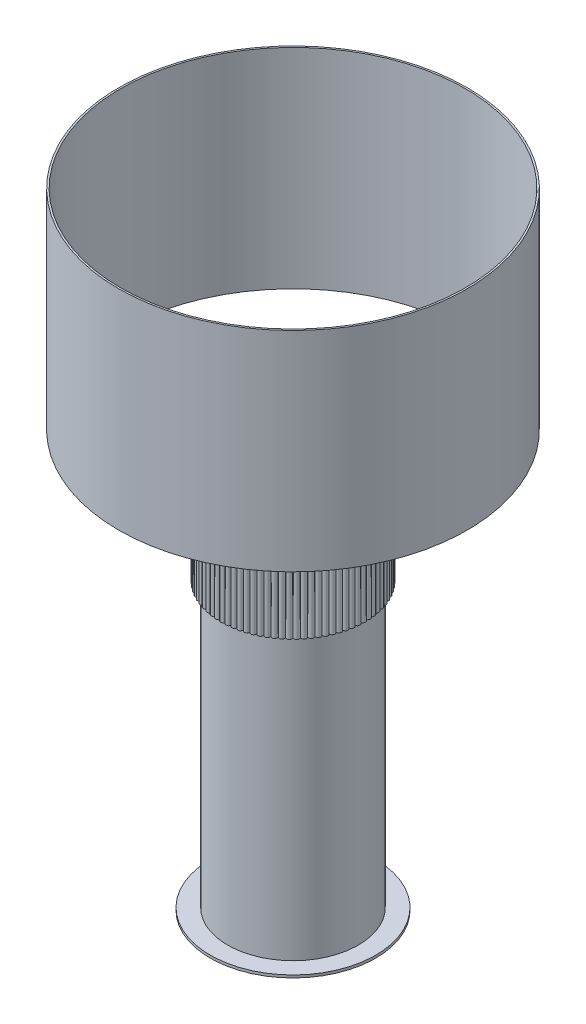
ISO-10303-21;
HEADER;
FILE_DESCRIPTION(('STEP AP214'),'2;1');
FILE_NAME('part.step','',(''),(''),'','','');
FILE_SCHEMA(('AUTOMOTIVE_DESIGN { 1 0 10303 214 1 1 1 1 }'));
ENDSEC;
DATA;
#1=APPLICATION_CONTEXT('core data for automotive mechanical design processes');
#2=APPLICATION_PROTOCOL_DEFINITION('international standard','automotive_design',2000,#1);
#3=PRODUCT_CONTEXT('',#1,'mechanical');
#4=PRODUCT('Part','Part','',(#3));
#5=PRODUCT_RELATED_PRODUCT_CATEGORY('part','',(#4));
#6=PRODUCT_DEFINITION_FORMATION('','',#4);
#7=PRODUCT_DEFINITION_CONTEXT('part definition',#1,'design');
#8=PRODUCT_DEFINITION('design','',#6,#7);
#9=PRODUCT_DEFINITION_SHAPE('','',#8);
#10=(LENGTH_UNIT() NAMED_UNIT(*) SI_UNIT(.MILLI.,.METRE.));
#11=(NAMED_UNIT(*) PLANE_ANGLE_UNIT() SI_UNIT($,.RADIAN.));
#12=(NAMED_UNIT(*) SI_UNIT($,.STERADIAN.) SOLID_ANGLE_UNIT());
#13=UNCERTAINTY_MEASURE_WITH_UNIT(LENGTH_MEASURE(1.E-05),#10,'distance_accuracy_value','');
#14=(GEOMETRIC_REPRESENTATION_CONTEXT(3) GLOBAL_UNCERTAINTY_ASSIGNED_CONTEXT((#13)) GLOBAL_UNIT_ASSIGNED_CONTEXT((#10,
#11,#12)) REPRESENTATION_CONTEXT('',''));
#15=CARTESIAN_POINT('',(0.,0.,0.));
#16=DIRECTION('',(0.,0.,1.));
#17=DIRECTION('',(1.,0.,0.));
#18=AXIS2_PLACEMENT_3D('',#15,#16,#17);
#19=CARTESIAN_POINT('',(0.,102.,0.));
#20=DIRECTION('',(0.,-1.,0.));
#21=DIRECTION('',(0.,0.,-1.));
#22=AXIS2_PLACEMENT_3D('',#19,#20,#21);
#23=CYLINDRICAL_SURFACE('',#22,20.);
#24=CARTESIAN_POINT('',(0.,102.,0.));
#25=DIRECTION('',(0.,1.,0.));
#26=DIRECTION('',(0.,0.,1.));
#27=AXIS2_PLACEMENT_3D('',#24,#25,#26);
#28=CIRCLE('',#27,20.);
#29=CARTESIAN_POINT('',(0.,102.,20.));
#30=VERTEX_POINT('',#29);
#31=EDGE_CURVE('E13',#30,#30,#28,.T.);
#32=ORIENTED_EDGE('',*,*,#31,.F.);
#33=EDGE_LOOP('',(#32));
#34=FACE_BOUND('',#33,.T.);
#35=CARTESIAN_POINT('',(0.,100.,0.));
#36=DIRECTION('',(0.,1.,0.));
#37=DIRECTION('',(0.,0.,1.));
#38=AXIS2_PLACEMENT_3D('',#35,#36,#37);
#39=CIRCLE('',#38,20.);
#40=CARTESIAN_POINT('',(0.,100.,20.));
#41=VERTEX_POINT('',#40);
#42=EDGE_CURVE('E56',#41,#41,#39,.T.);
#43=ORIENTED_EDGE('',*,*,#42,.T.);
#44=EDGE_LOOP('',(#43));
#45=FACE_BOUND('',#44,.T.);
#46=ADVANCED_FACE('F53',(#34,#45),#23,.T.);
#47=CARTESIAN_POINT('',(0.,102.,0.));
#48=DIRECTION('',(0.,1.,0.));
#49=DIRECTION('',(0.,0.,1.));
#50=AXIS2_PLACEMENT_3D('',#47,#48,#49);
#51=PLANE('',#50);
#52=ORIENTED_EDGE('',*,*,#31,.T.);
#53=EDGE_LOOP('',(#52));
#54=FACE_BOUND('',#53,.T.);
#55=ADVANCED_FACE('F68',(#54),#51,.T.);
#56=CARTESIAN_POINT('',(0.,100.,0.));
#57=DIRECTION('',(0.,1.,0.));
#58=DIRECTION('',(0.,0.,1.));
#59=AXIS2_PLACEMENT_3D('',#56,#57,#58);
#60=PLANE('',#59);
#61=ORIENTED_EDGE('',*,*,#42,.F.);
#62=EDGE_LOOP('',(#61));
#63=FACE_BOUND('',#62,.T.);
#64=ADVANCED_FACE('F66',(#63),#60,.F.);
#65=CLOSED_SHELL('',(#46,#55,#64));
#66=MANIFOLD_SOLID_BREP('B2',#65);
#67=CARTESIAN_POINT('',(0.,390.,0.));
#68=DIRECTION('',(0.,1.,0.));
#69=DIRECTION('',(0.,0.,1.));
#70=AXIS2_PLACEMENT_3D('',#67,#68,#69);
#71=PLANE('',#70);
#72=CARTESIAN_POINT('',(0.,390.,0.));
#73=DIRECTION('',(0.,1.,0.));
#74=DIRECTION('',(0.,0.,1.));
#75=AXIS2_PLACEMENT_3D('',#72,#73,#74);
#76=CIRCLE('',#75,200.);
#77=CARTESIAN_POINT('',(0.,390.,200.));
#78=VERTEX_POINT('',#77);
#79=EDGE_CURVE('E52',#78,#78,#76,.T.);
#80=ORIENTED_EDGE('',*,*,#79,.T.);
#81=EDGE_LOOP('',(#80));
#82=FACE_BOUND('',#81,.T.);
#83=CARTESIAN_POINT('',(0.,390.,0.));
#84=DIRECTION('',(0.,1.,0.));
#85=DIRECTION('',(0.,0.,1.));
#86=AXIS2_PLACEMENT_3D('',#83,#84,#85);
#87=CIRCLE('',#86,198.);
#88=CARTESIAN_POINT('',(0.,390.,198.));
#89=VERTEX_POINT('',#88);
#90=EDGE_CURVE('E112',#89,#89,#87,.T.);
#91=ORIENTED_EDGE('',*,*,#90,.F.);
#92=EDGE_LOOP('',(#91));
#93=FACE_BOUND('',#92,.T.);
#94=ADVANCED_FACE('F101',(#82,#93),#71,.T.);
#95=CARTESIAN_POINT('',(0.,150.,0.));
#96=DIRECTION('',(0.,1.,0.));
#97=DIRECTION('',(0.,0.,1.));
#98=AXIS2_PLACEMENT_3D('',#95,#96,#97);
#99=PLANE('',#98);
#100=CARTESIAN_POINT('',(0.,150.,0.));
#101=DIRECTION('',(0.,1.,0.));
#102=DIRECTION('',(0.,0.,1.));
#103=AXIS2_PLACEMENT_3D('',#100,#101,#102);
#104=CIRCLE('',#103,200.);
#105=CARTESIAN_POINT('',(0.,150.,200.));
#106=VERTEX_POINT('',#105);
#107=EDGE_CURVE('E105',#106,#106,#104,.T.);
#108=ORIENTED_EDGE('',*,*,#107,.F.);
#109=EDGE_LOOP('',(#108));
#110=FACE_BOUND('',#109,.T.);
#111=CARTESIAN_POINT('',(0.,150.,0.));
#112=DIRECTION('',(0.,1.,0.));
#113=DIRECTION('',(0.,0.,1.));
#114=AXIS2_PLACEMENT_3D('',#111,#112,#113);
#115=CIRCLE('',#114,198.);
#116=CARTESIAN_POINT('',(0.,150.,198.));
#117=VERTEX_POINT('',#116);
#118=EDGE_CURVE('E114',#117,#117,#115,.T.);
#119=ORIENTED_EDGE('',*,*,#118,.T.);
#120=EDGE_LOOP('',(#119));
#121=FACE_BOUND('',#120,.T.);
#122=ADVANCED_FACE('F124',(#110,#121),#99,.F.);
#123=CARTESIAN_POINT('',(0.,390.,0.));
#124=DIRECTION('',(0.,-1.,0.));
#125=DIRECTION('',(0.,0.,-1.));
#126=AXIS2_PLACEMENT_3D('',#123,#124,#125);
#127=CYLINDRICAL_SURFACE('',#126,200.);
#128=ORIENTED_EDGE('',*,*,#79,.F.);
#129=EDGE_LOOP('',(#128));
#130=FACE_BOUND('',#129,.T.);
#131=ORIENTED_EDGE('',*,*,#107,.T.);
#132=EDGE_LOOP('',(#131));
#133=FACE_BOUND('',#132,.T.);
#134=ADVANCED_FACE('F103',(#130,#133),#127,.T.);
#135=CARTESIAN_POINT('',(0.,390.,0.));
#136=DIRECTION('',(0.,-1.,0.));
#137=DIRECTION('',(0.,0.,-1.));
#138=AXIS2_PLACEMENT_3D('',#135,#136,#137);
#139=CYLINDRICAL_SURFACE('',#138,198.);
#140=ORIENTED_EDGE('',*,*,#90,.T.);
#141=EDGE_LOOP('',(#140));
#142=FACE_BOUND('',#141,.T.);
#143=ORIENTED_EDGE('',*,*,#118,.F.);
#144=EDGE_LOOP('',(#143));
#145=FACE_BOUND('',#144,.T.);
#146=ADVANCED_FACE('F120',(#142,#145),#139,.F.);
#147=CLOSED_SHELL('',(#94,#122,#134,#146));
#148=MANIFOLD_SOLID_BREP('B8',#147);
#149=CARTESIAN_POINT('',(-60.6217782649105,-333.,-35.0000000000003));
#150=DIRECTION('',(0.,1.,0.));
#151=DIRECTION('',(0.,0.,1.));
#152=AXIS2_PLACEMENT_3D('',#149,#150,#151);
#153=CYLINDRICAL_SURFACE('',#152,5.);
#154=CARTESIAN_POINT('',(-60.6217782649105,-332.,-35.0000000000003));
#155=DIRECTION('',(0.,-1.,0.));
#156=DIRECTION('',(0.,0.,-1.));
#157=AXIS2_PLACEMENT_3D('',#154,#155,#156);
#158=CIRCLE('',#157,5.);
#159=CARTESIAN_POINT('',(-60.6217782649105,-332.,-40.0000000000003));
#160=VERTEX_POINT('',#159);
#161=EDGE_CURVE('E100',#160,#160,#158,.F.);
#162=ORIENTED_EDGE('',*,*,#161,.T.);
#163=EDGE_LOOP('',(#162));
#164=FACE_BOUND('',#163,.T.);
#165=CARTESIAN_POINT('',(-60.6217782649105,-328.,-35.0000000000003));
#166=DIRECTION('',(0.,-1.,0.));
#167=DIRECTION('',(0.,0.,-1.));
#168=AXIS2_PLACEMENT_3D('',#165,#166,#167);
#169=CIRCLE('',#168,5.);
#170=CARTESIAN_POINT('',(-60.6217782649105,-328.,-40.0000000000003));
#171=VERTEX_POINT('',#170);
#172=EDGE_CURVE('E181',#171,#171,#169,.T.);
#173=ORIENTED_EDGE('',*,*,#172,.T.);
#174=EDGE_LOOP('',(#173));
#175=FACE_BOUND('',#174,.T.);
#176=ADVANCED_FACE('F170',(#164,#175),#153,.T.);
#177=CARTESIAN_POINT('',(-60.6217782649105,-333.,-35.0000000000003));
#178=DIRECTION('',(0.,-1.,0.));
#179=DIRECTION('',(0.,0.,-1.));
#180=AXIS2_PLACEMENT_3D('',#177,#178,#179);
#181=PLANE('',#180);
#182=CARTESIAN_POINT('',(-60.6217782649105,-333.,-35.0000000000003));
#183=DIRECTION('',(0.,-1.,0.));
#184=DIRECTION('',(0.,0.,-1.));
#185=AXIS2_PLACEMENT_3D('',#182,#183,#184);
#186=CIRCLE('',#185,4.);
#187=CARTESIAN_POINT('',(-60.6217782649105,-333.,-39.0000000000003));
#188=VERTEX_POINT('',#187);
#189=EDGE_CURVE('E177',#188,#188,#186,.T.);
#190=ORIENTED_EDGE('',*,*,#189,.T.);
#191=EDGE_LOOP('',(#190));
#192=FACE_BOUND('',#191,.T.);
#193=ADVANCED_FACE('F191',(#192),#181,.T.);
#194=CARTESIAN_POINT('',(-60.6217782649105,-328.,-35.0000000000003));
#195=DIRECTION('',(0.,-1.,0.));
#196=DIRECTION('',(0.,0.,-1.));
#197=AXIS2_PLACEMENT_3D('',#194,#195,#196);
#198=PLANE('',#197);
#199=ORIENTED_EDGE('',*,*,#172,.F.);
#200=EDGE_LOOP('',(#199));
#201=FACE_BOUND('',#200,.T.);
#202=ADVANCED_FACE('F189',(#201),#198,.F.);
#203=CARTESIAN_POINT('',(-60.6217782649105,-332.,-35.0000000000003));
#204=DIRECTION('',(0.,-1.,0.));
#205=DIRECTION('',(0.,0.,-1.));
#206=AXIS2_PLACEMENT_3D('',#203,#204,#205);
#207=TOROIDAL_SURFACE('',#206,4.,1.);
#208=ORIENTED_EDGE('',*,*,#161,.F.);
#209=EDGE_LOOP('',(#208));
#210=FACE_BOUND('',#209,.T.);
#211=ORIENTED_EDGE('',*,*,#189,.F.);
#212=EDGE_LOOP('',(#211));
#213=FACE_BOUND('',#212,.T.);
#214=ADVANCED_FACE('F172',(#210,#213),#207,.T.);
#215=CLOSED_SHELL('',(#176,#193,#202,#214));
#216=MANIFOLD_SOLID_BREP('B47',#215);
#217=CARTESIAN_POINT('',(0.,-333.,70.));
#218=DIRECTION('',(0.,1.,0.));
#219=DIRECTION('',(0.,0.,1.));
#220=AXIS2_PLACEMENT_3D('',#217,#218,#219);
#221=CYLINDRICAL_SURFACE('',#220,5.);
#222=CARTESIAN_POINT('',(0.,-332.,70.));
#223=DIRECTION('',(0.,-1.,0.));
#224=DIRECTION('',(0.,0.,-1.));
#225=AXIS2_PLACEMENT_3D('',#222,#223,#224);
#226=CIRCLE('',#225,5.);
#227=CARTESIAN_POINT('',(0.,-332.,65.));
#228=VERTEX_POINT('',#227);
#229=EDGE_CURVE('E169',#228,#228,#226,.F.);
#230=ORIENTED_EDGE('',*,*,#229,.T.);
#231=EDGE_LOOP('',(#230));
#232=FACE_BOUND('',#231,.T.);
#233=CARTESIAN_POINT('',(0.,-328.,70.));
#234=DIRECTION('',(0.,-1.,0.));
#235=DIRECTION('',(0.,0.,-1.));
#236=AXIS2_PLACEMENT_3D('',#233,#234,#235);
#237=CIRCLE('',#236,5.);
#238=CARTESIAN_POINT('',(0.,-328.,65.));
#239=VERTEX_POINT('',#238);
#240=EDGE_CURVE('E244',#239,#239,#237,.T.);
#241=ORIENTED_EDGE('',*,*,#240,.T.);
#242=EDGE_LOOP('',(#241));
#243=FACE_BOUND('',#242,.T.);
#244=ADVANCED_FACE('F233',(#232,#243),#221,.T.);
#245=CARTESIAN_POINT('',(0.,-333.,70.));
#246=DIRECTION('',(0.,-1.,0.));
#247=DIRECTION('',(0.,0.,-1.));
#248=AXIS2_PLACEMENT_3D('',#245,#246,#247);
#249=PLANE('',#248);
#250=CARTESIAN_POINT('',(0.,-333.,70.));
#251=DIRECTION('',(0.,-1.,0.));
#252=DIRECTION('',(0.,0.,-1.));
#253=AXIS2_PLACEMENT_3D('',#250,#251,#252);
#254=CIRCLE('',#253,4.);
#255=CARTESIAN_POINT('',(0.,-333.,66.));
#256=VERTEX_POINT('',#255);
#257=EDGE_CURVE('E240',#256,#256,#254,.T.);
#258=ORIENTED_EDGE('',*,*,#257,.T.);
#259=EDGE_LOOP('',(#258));
#260=FACE_BOUND('',#259,.T.);
#261=ADVANCED_FACE('F254',(#260),#249,.T.);
#262=CARTESIAN_POINT('',(0.,-328.,70.));
#263=DIRECTION('',(0.,-1.,0.));
#264=DIRECTION('',(0.,0.,-1.));
#265=AXIS2_PLACEMENT_3D('',#262,#263,#264);
#266=PLANE('',#265);
#267=ORIENTED_EDGE('',*,*,#240,.F.);
#268=EDGE_LOOP('',(#267));
#269=FACE_BOUND('',#268,.T.);
#270=ADVANCED_FACE('F252',(#269),#266,.F.);
#271=CARTESIAN_POINT('',(0.,-332.,70.));
#272=DIRECTION('',(0.,-1.,0.));
#273=DIRECTION('',(0.,0.,-1.));
#274=AXIS2_PLACEMENT_3D('',#271,#272,#273);
#275=TOROIDAL_SURFACE('',#274,4.,1.);
#276=ORIENTED_EDGE('',*,*,#229,.F.);
#277=EDGE_LOOP('',(#276));
#278=FACE_BOUND('',#277,.T.);
#279=ORIENTED_EDGE('',*,*,#257,.F.);
#280=EDGE_LOOP('',(#279));
#281=FACE_BOUND('',#280,.T.);
#282=ADVANCED_FACE('F235',(#278,#281),#275,.T.);
#283=CLOSED_SHELL('',(#244,#261,#270,#282));
#284=MANIFOLD_SOLID_BREP('B95',#283);
#285=CARTESIAN_POINT('',(60.6217782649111,-333.,-34.9999999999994));
#286=DIRECTION('',(0.,1.,0.));
#287=DIRECTION('',(0.,0.,1.));
#288=AXIS2_PLACEMENT_3D('',#285,#286,#287);
#289=CYLINDRICAL_SURFACE('',#288,5.);
#290=CARTESIAN_POINT('',(60.6217782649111,-332.,-34.9999999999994));
#291=DIRECTION('',(0.,-1.,0.));
#292=DIRECTION('',(0.,0.,-1.));
#293=AXIS2_PLACEMENT_3D('',#290,#291,#292);
#294=CIRCLE('',#293,5.);
#295=CARTESIAN_POINT('',(60.6217782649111,-332.,-39.9999999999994));
#296=VERTEX_POINT('',#295);
#297=EDGE_CURVE('E232',#296,#296,#294,.F.);
#298=ORIENTED_EDGE('',*,*,#297,.T.);
#299=EDGE_LOOP('',(#298));
#300=FACE_BOUND('',#299,.T.);
#301=CARTESIAN_POINT('',(60.6217782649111,-328.,-34.9999999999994));
#302=DIRECTION('',(0.,-1.,0.));
#303=DIRECTION('',(0.,0.,-1.));
#304=AXIS2_PLACEMENT_3D('',#301,#302,#303);
#305=CIRCLE('',#304,5.);
#306=CARTESIAN_POINT('',(60.6217782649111,-328.,-39.9999999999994));
#307=VERTEX_POINT('',#306);
#308=EDGE_CURVE('E307',#307,#307,#305,.T.);
#309=ORIENTED_EDGE('',*,*,#308,.T.);
#310=EDGE_LOOP('',(#309));
#311=FACE_BOUND('',#310,.T.);
#312=ADVANCED_FACE('F296',(#300,#311),#289,.T.);
#313=CARTESIAN_POINT('',(60.6217782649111,-333.,-34.9999999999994));
#314=DIRECTION('',(0.,-1.,0.));
#315=DIRECTION('',(0.,0.,-1.));
#316=AXIS2_PLACEMENT_3D('',#313,#314,#315);
#317=PLANE('',#316);
#318=CARTESIAN_POINT('',(60.6217782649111,-333.,-34.9999999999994));
#319=DIRECTION('',(0.,-1.,0.));
#320=DIRECTION('',(0.,0.,-1.));
#321=AXIS2_PLACEMENT_3D('',#318,#319,#320);
#322=CIRCLE('',#321,4.);
#323=CARTESIAN_POINT('',(60.6217782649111,-333.,-38.9999999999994));
#324=VERTEX_POINT('',#323);
#325=EDGE_CURVE('E303',#324,#324,#322,.T.);
#326=ORIENTED_EDGE('',*,*,#325,.T.);
#327=EDGE_LOOP('',(#326));
#328=FACE_BOUND('',#327,.T.);
#329=ADVANCED_FACE('F317',(#328),#317,.T.);
#330=CARTESIAN_POINT('',(60.6217782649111,-328.,-34.9999999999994));
#331=DIRECTION('',(0.,-1.,0.));
#332=DIRECTION('',(0.,0.,-1.));
#333=AXIS2_PLACEMENT_3D('',#330,#331,#332);
#334=PLANE('',#333);
#335=ORIENTED_EDGE('',*,*,#308,.F.);
#336=EDGE_LOOP('',(#335));
#337=FACE_BOUND('',#336,.T.);
#338=ADVANCED_FACE('F315',(#337),#334,.F.);
#339=CARTESIAN_POINT('',(60.6217782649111,-332.,-34.9999999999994));
#340=DIRECTION('',(0.,-1.,0.));
#341=DIRECTION('',(0.,0.,-1.));
#342=AXIS2_PLACEMENT_3D('',#339,#340,#341);
#343=TOROIDAL_SURFACE('',#342,4.,1.);
#344=ORIENTED_EDGE('',*,*,#297,.F.);
#345=EDGE_LOOP('',(#344));
#346=FACE_BOUND('',#345,.T.);
#347=ORIENTED_EDGE('',*,*,#325,.F.);
#348=EDGE_LOOP('',(#347));
#349=FACE_BOUND('',#348,.T.);
#350=ADVANCED_FACE('F298',(#346,#349),#343,.T.);
#351=CLOSED_SHELL('',(#312,#329,#338,#350));
#352=MANIFOLD_SOLID_BREP('B164',#351);
#353=CARTESIAN_POINT('',(0.,-328.,0.));
#354=DIRECTION('',(0.,1.,0.));
#355=DIRECTION('',(0.,0.,1.));
#356=AXIS2_PLACEMENT_3D('',#353,#354,#355);
#357=CYLINDRICAL_SURFACE('',#356,95.);
#358=CARTESIAN_POINT('',(0.,-328.,0.));
#359=DIRECTION('',(0.,-1.,0.));
#360=DIRECTION('',(0.,0.,-1.));
#361=AXIS2_PLACEMENT_3D('',#358,#359,#360);
#362=CIRCLE('',#361,95.);
#363=CARTESIAN_POINT('',(0.,-328.,-95.));
#364=VERTEX_POINT('',#363);
#365=EDGE_CURVE('E295',#364,#364,#362,.T.);
#366=ORIENTED_EDGE('',*,*,#365,.F.);
#367=EDGE_LOOP('',(#366));
#368=FACE_BOUND('',#367,.T.);
#369=CARTESIAN_POINT('',(0.,-325.,0.));
#370=DIRECTION('',(0.,-1.,0.));
#371=DIRECTION('',(0.,0.,-1.));
#372=AXIS2_PLACEMENT_3D('',#369,#370,#371);
#373=CIRCLE('',#372,95.);
#374=CARTESIAN_POINT('',(0.,-325.,-95.));
#375=VERTEX_POINT('',#374);
#376=EDGE_CURVE('E364',#375,#375,#373,.T.);
#377=ORIENTED_EDGE('',*,*,#376,.T.);
#378=EDGE_LOOP('',(#377));
#379=FACE_BOUND('',#378,.T.);
#380=ADVANCED_FACE('F361',(#368,#379),#357,.T.);
#381=CARTESIAN_POINT('',(0.,-328.,0.));
#382=DIRECTION('',(0.,-1.,0.));
#383=DIRECTION('',(0.,0.,-1.));
#384=AXIS2_PLACEMENT_3D('',#381,#382,#383);
#385=PLANE('',#384);
#386=ORIENTED_EDGE('',*,*,#365,.T.);
#387=EDGE_LOOP('',(#386));
#388=FACE_BOUND('',#387,.T.);
#389=ADVANCED_FACE('F376',(#388),#385,.T.);
#390=CARTESIAN_POINT('',(0.,-325.,0.));
#391=DIRECTION('',(0.,-1.,0.));
#392=DIRECTION('',(0.,0.,-1.));
#393=AXIS2_PLACEMENT_3D('',#390,#391,#392);
#394=PLANE('',#393);
#395=ORIENTED_EDGE('',*,*,#376,.F.);
#396=EDGE_LOOP('',(#395));
#397=FACE_BOUND('',#396,.T.);
#398=ADVANCED_FACE('F374',(#397),#394,.F.);
#399=CLOSED_SHELL('',(#380,#389,#398));
#400=MANIFOLD_SOLID_BREP('B227',#399);
#401=CARTESIAN_POINT('',(0.,150.,0.));
#402=DIRECTION('',(0.,-1.,0.));
#403=DIRECTION('',(0.,0.,-1.));
#404=AXIS2_PLACEMENT_3D('',#401,#402,#403);
#405=CYLINDRICAL_SURFACE('',#404,6.);
#406=CARTESIAN_POINT('',(0.,150.,0.));
#407=DIRECTION('',(0.,1.,0.));
#408=DIRECTION('',(0.,0.,1.));
#409=AXIS2_PLACEMENT_3D('',#406,#407,#408);
#410=CIRCLE('',#409,6.);
#411=CARTESIAN_POINT('',(0.,150.,6.));
#412=VERTEX_POINT('',#411);
#413=EDGE_CURVE('E360',#412,#412,#410,.T.);
#414=ORIENTED_EDGE('',*,*,#413,.F.);
#415=EDGE_LOOP('',(#414));
#416=FACE_BOUND('',#415,.T.);
#417=CARTESIAN_POINT('',(0.,100.,0.));
#418=DIRECTION('',(0.,1.,0.));
#419=DIRECTION('',(0.,0.,1.));
#420=AXIS2_PLACEMENT_3D('',#417,#418,#419);
#421=CIRCLE('',#420,6.);
#422=CARTESIAN_POINT('',(0.,100.,6.));
#423=VERTEX_POINT('',#422);
#424=EDGE_CURVE('E420',#423,#423,#421,.T.);
#425=ORIENTED_EDGE('',*,*,#424,.T.);
#426=EDGE_LOOP('',(#425));
#427=FACE_BOUND('',#426,.T.);
#428=ADVANCED_FACE('F417',(#416,#427),#405,.T.);
#429=CARTESIAN_POINT('',(0.,150.,0.));
#430=DIRECTION('',(0.,1.,0.));
#431=DIRECTION('',(0.,0.,1.));
#432=AXIS2_PLACEMENT_3D('',#429,#430,#431);
#433=PLANE('',#432);
#434=ORIENTED_EDGE('',*,*,#413,.T.);
#435=EDGE_LOOP('',(#434));
#436=FACE_BOUND('',#435,.T.);
#437=ADVANCED_FACE('F432',(#436),#433,.T.);
#438=CARTESIAN_POINT('',(0.,100.,0.));
#439=DIRECTION('',(0.,1.,0.));
#440=DIRECTION('',(0.,0.,1.));
#441=AXIS2_PLACEMENT_3D('',#438,#439,#440);
#442=PLANE('',#441);
#443=ORIENTED_EDGE('',*,*,#424,.F.);
#444=EDGE_LOOP('',(#443));
#445=FACE_BOUND('',#444,.T.);
#446=ADVANCED_FACE('F430',(#445),#442,.F.);
#447=CLOSED_SHELL('',(#428,#437,#446));
#448=MANIFOLD_SOLID_BREP('B290',#447);
#449=CARTESIAN_POINT('',(0.,-325.,0.));
#450=DIRECTION('',(0.,-1.,0.));
#451=DIRECTION('',(0.,0.,-1.));
#452=AXIS2_PLACEMENT_3D('',#449,#450,#451);
#453=PLANE('',#452);
#454=CARTESIAN_POINT('',(0.,-325.,0.));
#455=DIRECTION('',(0.,-1.,0.));
#456=DIRECTION('',(0.,0.,-1.));
#457=AXIS2_PLACEMENT_3D('',#454,#455,#456);
#458=CIRCLE('',#457,75.);
#459=CARTESIAN_POINT('',(0.,-325.,-75.));
#460=VERTEX_POINT('',#459);
#461=EDGE_CURVE('E416',#460,#460,#458,.T.);
#462=ORIENTED_EDGE('',*,*,#461,.T.);
#463=EDGE_LOOP('',(#462));
#464=FACE_BOUND('',#463,.T.);
#465=CARTESIAN_POINT('',(0.,-325.,0.));
#466=DIRECTION('',(0.,-1.,0.));
#467=DIRECTION('',(0.,0.,-1.));
#468=AXIS2_PLACEMENT_3D('',#465,#466,#467);
#469=CIRCLE('',#468,70.);
#470=CARTESIAN_POINT('',(0.,-325.,-70.));
#471=VERTEX_POINT('',#470);
#472=EDGE_CURVE('E485',#471,#471,#469,.T.);
#473=ORIENTED_EDGE('',*,*,#472,.F.);
#474=EDGE_LOOP('',(#473));
#475=FACE_BOUND('',#474,.T.);
#476=ADVANCED_FACE('F474',(#464,#475),#453,.T.);
#477=CARTESIAN_POINT('',(0.,75.,0.));
#478=DIRECTION('',(0.,-1.,0.));
#479=DIRECTION('',(0.,0.,-1.));
#480=AXIS2_PLACEMENT_3D('',#477,#478,#479);
#481=PLANE('',#480);
#482=CARTESIAN_POINT('',(0.,75.,0.));
#483=DIRECTION('',(0.,-1.,0.));
#484=DIRECTION('',(0.,0.,-1.));
#485=AXIS2_PLACEMENT_3D('',#482,#483,#484);
#486=CIRCLE('',#485,75.);
#487=CARTESIAN_POINT('',(0.,75.,-75.));
#488=VERTEX_POINT('',#487);
#489=EDGE_CURVE('E478',#488,#488,#486,.T.);
#490=ORIENTED_EDGE('',*,*,#489,.F.);
#491=EDGE_LOOP('',(#490));
#492=FACE_BOUND('',#491,.T.);
#493=CARTESIAN_POINT('',(0.,75.,0.));
#494=DIRECTION('',(0.,-1.,0.));
#495=DIRECTION('',(0.,0.,-1.));
#496=AXIS2_PLACEMENT_3D('',#493,#494,#495);
#497=CIRCLE('',#496,70.);
#498=CARTESIAN_POINT('',(0.,75.,-70.));
#499=VERTEX_POINT('',#498);
#500=EDGE_CURVE('E487',#499,#499,#497,.T.);
#501=ORIENTED_EDGE('',*,*,#500,.T.);
#502=EDGE_LOOP('',(#501));
#503=FACE_BOUND('',#502,.T.);
#504=ADVANCED_FACE('F497',(#492,#503),#481,.F.);
#505=CARTESIAN_POINT('',(0.,-325.,0.));
#506=DIRECTION('',(0.,1.,0.));
#507=DIRECTION('',(0.,0.,1.));
#508=AXIS2_PLACEMENT_3D('',#505,#506,#507);
#509=CYLINDRICAL_SURFACE('',#508,75.);
#510=ORIENTED_EDGE('',*,*,#461,.F.);
#511=EDGE_LOOP('',(#510));
#512=FACE_BOUND('',#511,.T.);
#513=ORIENTED_EDGE('',*,*,#489,.T.);
#514=EDGE_LOOP('',(#513));
#515=FACE_BOUND('',#514,.T.);
#516=ADVANCED_FACE('F476',(#512,#515),#509,.T.);
#517=CARTESIAN_POINT('',(0.,-325.,0.));
#518=DIRECTION('',(0.,1.,0.));
#519=DIRECTION('',(0.,0.,1.));
#520=AXIS2_PLACEMENT_3D('',#517,#518,#519);
#521=CYLINDRICAL_SURFACE('',#520,70.);
#522=ORIENTED_EDGE('',*,*,#472,.T.);
#523=EDGE_LOOP('',(#522));
#524=FACE_BOUND('',#523,.T.);
#525=ORIENTED_EDGE('',*,*,#500,.F.);
#526=EDGE_LOOP('',(#525));
#527=FACE_BOUND('',#526,.T.);
#528=ADVANCED_FACE('F493',(#524,#527),#521,.F.);
#529=CLOSED_SHELL('',(#476,#504,#516,#528));
#530=MANIFOLD_SOLID_BREP('B355',#529);
#531=CARTESIAN_POINT('',(-29.2272819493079,100.,-74.4698998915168));
#532=DIRECTION('',(0.,-1.,0.));
#533=DIRECTION('',(0.,0.,-1.));
#534=AXIS2_PLACEMENT_3D('',#531,#532,#533);
#535=CYLINDRICAL_SURFACE('',#534,3.00000000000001);
#536=CARTESIAN_POINT('',(-29.2272819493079,0.,-74.4698998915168));
#537=DIRECTION('',(0.,1.,0.));
#538=DIRECTION('',(0.,0.,1.));
#539=AXIS2_PLACEMENT_3D('',#536,#537,#538);
#540=CIRCLE('',#539,3.00000000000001);
#541=CARTESIAN_POINT('',(-26.4792724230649,0.,-75.6734129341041));
#542=VERTEX_POINT('',#541);
#543=CARTESIAN_POINT('',(-32.0603122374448,0.,-73.4830162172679));
#544=VERTEX_POINT('',#543);
#545=EDGE_CURVE('E1094',#542,#544,#540,.T.);
#546=ORIENTED_EDGE('',*,*,#545,.T.);
#547=DIRECTION('',(0.,-1.,0.));
#548=VECTOR('',#547,1.);
#549=CARTESIAN_POINT('',(-32.0603122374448,100.,-73.4830162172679));
#550=LINE('',#549,#548);
#551=CARTESIAN_POINT('',(-32.0603122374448,100.,-73.4830162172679));
#552=VERTEX_POINT('',#551);
#553=EDGE_CURVE('E472',#552,#544,#550,.T.);
#554=ORIENTED_EDGE('',*,*,#553,.F.);
#555=CARTESIAN_POINT('',(-29.2272819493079,100.,-74.4698998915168));
#556=DIRECTION('',(0.,1.,0.));
#557=DIRECTION('',(0.,0.,1.));
#558=AXIS2_PLACEMENT_3D('',#555,#556,#557);
#559=CIRCLE('',#558,3.00000000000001);
#560=CARTESIAN_POINT('',(-26.4792724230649,100.,-75.6734129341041));
#561=VERTEX_POINT('',#560);
#562=EDGE_CURVE('E1261',#561,#552,#559,.T.);
#563=ORIENTED_EDGE('',*,*,#562,.F.);
#564=DIRECTION('',(0.,-1.,0.));
#565=VECTOR('',#564,1.);
#566=CARTESIAN_POINT('',(-26.4792724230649,100.,-75.6734129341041));
#567=LINE('',#566,#565);
#568=EDGE_CURVE('E1090',#561,#542,#567,.T.);
#569=ORIENTED_EDGE('',*,*,#568,.T.);
#570=EDGE_LOOP('',(#546,#554,#563,#569));
#571=FACE_BOUND('',#570,.T.);
#572=ADVANCED_FACE('F541',(#571),#535,.T.);
#573=CARTESIAN_POINT('',(-34.7106991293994,100.,-72.0775094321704));
#574=DIRECTION('',(0.,-1.,0.));
#575=DIRECTION('',(0.,0.,-1.));
#576=AXIS2_PLACEMENT_3D('',#573,#574,#575);
#577=CYLINDRICAL_SURFACE('',#576,3.);
#578=CARTESIAN_POINT('',(-34.7106991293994,0.,-72.0775094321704));
#579=DIRECTION('',(0.,1.,0.));
#580=DIRECTION('',(0.,0.,1.));
#581=AXIS2_PLACEMENT_3D('',#578,#579,#580);
#582=CIRCLE('',#581,3.);
#583=CARTESIAN_POINT('',(-37.4620577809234,0.,-70.881672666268));
#584=VERTEX_POINT('',#583);
#585=EDGE_CURVE('E1097',#544,#584,#582,.T.);
#586=ORIENTED_EDGE('',*,*,#585,.T.);
#587=DIRECTION('',(0.,-1.,0.));
#588=VECTOR('',#587,1.);
#589=CARTESIAN_POINT('',(-37.4620577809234,100.,-70.881672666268));
#590=LINE('',#589,#588);
#591=CARTESIAN_POINT('',(-37.4620577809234,100.,-70.881672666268));
#592=VERTEX_POINT('',#591);
#593=EDGE_CURVE('E550',#592,#584,#590,.T.);
#594=ORIENTED_EDGE('',*,*,#593,.F.);
#595=CARTESIAN_POINT('',(-34.7106991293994,100.,-72.0775094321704));
#596=DIRECTION('',(0.,1.,0.));
#597=DIRECTION('',(0.,0.,1.));
#598=AXIS2_PLACEMENT_3D('',#595,#596,#597);
#599=CIRCLE('',#598,3.);
#600=EDGE_CURVE('E829',#552,#592,#599,.T.);
#601=ORIENTED_EDGE('',*,*,#600,.F.);
#602=ORIENTED_EDGE('',*,*,#553,.T.);
#603=EDGE_LOOP('',(#586,#594,#601,#602));
#604=FACE_BOUND('',#603,.T.);
#605=ADVANCED_FACE('F1701',(#604),#577,.T.);
#606=CARTESIAN_POINT('',(-39.9999999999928,100.,-69.2820323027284));
#607=DIRECTION('',(0.,-1.,0.));
#608=DIRECTION('',(0.,0.,-1.));
#609=AXIS2_PLACEMENT_3D('',#606,#607,#608);
#610=CYLINDRICAL_SURFACE('',#609,3.);
#611=CARTESIAN_POINT('',(-39.9999999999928,0.,-69.2820323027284));
#612=DIRECTION('',(0.,1.,0.));
#613=DIRECTION('',(0.,0.,1.));
#614=AXIS2_PLACEMENT_3D('',#611,#612,#613);
#615=CIRCLE('',#614,3.);
#616=CARTESIAN_POINT('',(-42.6543003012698,0.,-67.8839300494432));
#617=VERTEX_POINT('',#616);
#618=EDGE_CURVE('E1100',#584,#617,#615,.T.);
#619=ORIENTED_EDGE('',*,*,#618,.T.);
#620=DIRECTION('',(0.,-1.,0.));
#621=VECTOR('',#620,1.);
#622=CARTESIAN_POINT('',(-42.6543003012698,100.,-67.8839300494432));
#623=LINE('',#622,#621);
#624=CARTESIAN_POINT('',(-42.6543003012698,100.,-67.8839300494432));
#625=VERTEX_POINT('',#624);
#626=EDGE_CURVE('E1496',#625,#617,#623,.T.);
#627=ORIENTED_EDGE('',*,*,#626,.F.);
#628=CARTESIAN_POINT('',(-39.9999999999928,100.,-69.2820323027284));
#629=DIRECTION('',(0.,1.,0.));
#630=DIRECTION('',(0.,0.,1.));
#631=AXIS2_PLACEMENT_3D('',#628,#629,#630);
#632=CIRCLE('',#631,3.);
#633=EDGE_CURVE('E1505',#592,#625,#632,.T.);
#634=ORIENTED_EDGE('',*,*,#633,.F.);
#635=ORIENTED_EDGE('',*,*,#593,.T.);
#636=EDGE_LOOP('',(#619,#627,#634,#635));
#637=FACE_BOUND('',#636,.T.);
#638=ADVANCED_FACE('F1503',(#637),#610,.T.);
#639=CARTESIAN_POINT('',(-45.0656046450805,100.,-66.0991019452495));
#640=DIRECTION('',(0.,-1.,0.));
#641=DIRECTION('',(0.,0.,-1.));
#642=AXIS2_PLACEMENT_3D('',#639,#640,#641);
#643=CYLINDRICAL_SURFACE('',#642,3.00000000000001);
#644=CARTESIAN_POINT('',(-45.0656046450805,0.,-66.0991019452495));
#645=DIRECTION('',(0.,1.,0.));
#646=DIRECTION('',(0.,0.,1.));
#647=AXIS2_PLACEMENT_3D('',#644,#645,#646);
#648=CIRCLE('',#647,3.00000000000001);
#649=CARTESIAN_POINT('',(-47.6080026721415,0.,-64.506552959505));
#650=VERTEX_POINT('',#649);
#651=EDGE_CURVE('E1102',#617,#650,#648,.T.);
#652=ORIENTED_EDGE('',*,*,#651,.T.);
#653=DIRECTION('',(0.,-1.,0.));
#654=VECTOR('',#653,1.);
#655=CARTESIAN_POINT('',(-47.6080026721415,100.,-64.506552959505));
#656=LINE('',#655,#654);
#657=CARTESIAN_POINT('',(-47.6080026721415,100.,-64.506552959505));
#658=VERTEX_POINT('',#657);
#659=EDGE_CURVE('E1493',#658,#650,#656,.T.);
#660=ORIENTED_EDGE('',*,*,#659,.F.);
#661=CARTESIAN_POINT('',(-45.0656046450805,100.,-66.0991019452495));
#662=DIRECTION('',(0.,1.,0.));
#663=DIRECTION('',(0.,0.,1.));
#664=AXIS2_PLACEMENT_3D('',#661,#662,#663);
#665=CIRCLE('',#664,3.00000000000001);
#666=EDGE_CURVE('E1523',#625,#658,#665,.T.);
#667=ORIENTED_EDGE('',*,*,#666,.F.);
#668=ORIENTED_EDGE('',*,*,#626,.T.);
#669=EDGE_LOOP('',(#652,#660,#667,#668));
#670=FACE_BOUND('',#669,.T.);
#671=ADVANCED_FACE('F1514',(#670),#643,.T.);
#672=CARTESIAN_POINT('',(-49.879184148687,100.,-62.5465185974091));
#673=DIRECTION('',(0.,-1.,0.));
#674=DIRECTION('',(0.,0.,-1.));
#675=AXIS2_PLACEMENT_3D('',#672,#673,#674);
#676=CYLINDRICAL_SURFACE('',#675,3.);
#677=CARTESIAN_POINT('',(-49.879184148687,0.,-62.5465185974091));
#678=DIRECTION('',(0.,1.,0.));
#679=DIRECTION('',(0.,0.,1.));
#680=AXIS2_PLACEMENT_3D('',#677,#678,#679);
#681=CIRCLE('',#680,3.);
#682=CARTESIAN_POINT('',(-52.2954617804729,0.,-60.7684290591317));
#683=VERTEX_POINT('',#682);
#684=EDGE_CURVE('E1104',#650,#683,#681,.T.);
#685=ORIENTED_EDGE('',*,*,#684,.T.);
#686=DIRECTION('',(0.,-1.,0.));
#687=VECTOR('',#686,1.);
#688=CARTESIAN_POINT('',(-52.2954617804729,100.,-60.7684290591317));
#689=LINE('',#688,#687);
#690=CARTESIAN_POINT('',(-52.2954617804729,100.,-60.7684290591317));
#691=VERTEX_POINT('',#690);
#692=EDGE_CURVE('E1490',#691,#683,#689,.T.);
#693=ORIENTED_EDGE('',*,*,#692,.F.);
#694=CARTESIAN_POINT('',(-49.879184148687,100.,-62.5465185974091));
#695=DIRECTION('',(0.,1.,0.));
#696=DIRECTION('',(0.,0.,1.));
#697=AXIS2_PLACEMENT_3D('',#694,#695,#696);
#698=CIRCLE('',#697,3.);
#699=EDGE_CURVE('E1520',#658,#691,#698,.T.);
#700=ORIENTED_EDGE('',*,*,#699,.F.);
#701=ORIENTED_EDGE('',*,*,#659,.T.);
#702=EDGE_LOOP('',(#685,#693,#700,#701));
#703=FACE_BOUND('',#702,.T.);
#704=ADVANCED_FACE('F1518',(#703),#676,.T.);
#705=CARTESIAN_POINT('',(-54.4138190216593,100.,-58.6441497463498));
#706=DIRECTION('',(0.,-1.,0.));
#707=DIRECTION('',(0.,0.,-1.));
#708=AXIS2_PLACEMENT_3D('',#705,#706,#707);
#709=CYLINDRICAL_SURFACE('',#708,3.);
#710=CARTESIAN_POINT('',(-54.4138190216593,0.,-58.6441497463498));
#711=DIRECTION('',(0.,1.,0.));
#712=DIRECTION('',(0.,0.,1.));
#713=AXIS2_PLACEMENT_3D('',#710,#711,#712);
#714=CIRCLE('',#713,3.);
#715=CARTESIAN_POINT('',(-56.6904634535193,0.,-56.6904634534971));
#716=VERTEX_POINT('',#715);
#717=EDGE_CURVE('E1106',#683,#716,#714,.T.);
#718=ORIENTED_EDGE('',*,*,#717,.T.);
#719=DIRECTION('',(0.,-1.,0.));
#720=VECTOR('',#719,1.);
#721=CARTESIAN_POINT('',(-56.6904634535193,100.,-56.6904634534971));
#722=LINE('',#721,#720);
#723=CARTESIAN_POINT('',(-56.6904634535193,100.,-56.6904634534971));
#724=VERTEX_POINT('',#723);
#725=EDGE_CURVE('E1487',#724,#716,#722,.T.);
#726=ORIENTED_EDGE('',*,*,#725,.F.);
#727=CARTESIAN_POINT('',(-54.4138190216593,100.,-58.6441497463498));
#728=DIRECTION('',(0.,1.,0.));
#729=DIRECTION('',(0.,0.,1.));
#730=AXIS2_PLACEMENT_3D('',#727,#728,#729);
#731=CIRCLE('',#730,3.);
#732=EDGE_CURVE('E1522',#691,#724,#731,.T.);
#733=ORIENTED_EDGE('',*,*,#732,.F.);
#734=ORIENTED_EDGE('',*,*,#692,.T.);
#735=EDGE_LOOP('',(#718,#726,#733,#734));
#736=FACE_BOUND('',#735,.T.);
#737=ADVANCED_FACE('F1714',(#736),#709,.T.);
#738=CARTESIAN_POINT('',(-58.644149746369,100.,-54.4138190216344));
#739=DIRECTION('',(0.,-1.,0.));
#740=DIRECTION('',(0.,0.,-1.));
#741=AXIS2_PLACEMENT_3D('',#738,#739,#740);
#742=CYLINDRICAL_SURFACE('',#741,3.);
#743=CARTESIAN_POINT('',(-58.644149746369,0.,-54.4138190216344));
#744=DIRECTION('',(0.,1.,0.));
#745=DIRECTION('',(0.,0.,1.));
#746=AXIS2_PLACEMENT_3D('',#743,#744,#745);
#747=CIRCLE('',#746,3.);
#748=CARTESIAN_POINT('',(-60.7684290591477,0.,-52.2954617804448));
#749=VERTEX_POINT('',#748);
#750=EDGE_CURVE('E1108',#716,#749,#747,.T.);
#751=ORIENTED_EDGE('',*,*,#750,.T.);
#752=DIRECTION('',(0.,-1.,0.));
#753=VECTOR('',#752,1.);
#754=CARTESIAN_POINT('',(-60.7684290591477,100.,-52.2954617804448));
#755=LINE('',#754,#753);
#756=CARTESIAN_POINT('',(-60.7684290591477,100.,-52.2954617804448));
#757=VERTEX_POINT('',#756);
#758=EDGE_CURVE('E1484',#757,#749,#755,.T.);
#759=ORIENTED_EDGE('',*,*,#758,.F.);
#760=CARTESIAN_POINT('',(-58.644149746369,100.,-54.4138190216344));
#761=DIRECTION('',(0.,1.,0.));
#762=DIRECTION('',(0.,0.,1.));
#763=AXIS2_PLACEMENT_3D('',#760,#761,#762);
#764=CIRCLE('',#763,3.);
#765=EDGE_CURVE('E1525',#724,#757,#764,.T.);
#766=ORIENTED_EDGE('',*,*,#765,.F.);
#767=ORIENTED_EDGE('',*,*,#725,.T.);
#768=EDGE_LOOP('',(#751,#759,#766,#767));
#769=FACE_BOUND('',#768,.T.);
#770=ADVANCED_FACE('F1717',(#769),#742,.T.);
#771=CARTESIAN_POINT('',(-62.5465185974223,100.,-49.8791841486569));
#772=DIRECTION('',(0.,-1.,0.));
#773=DIRECTION('',(0.,0.,-1.));
#774=AXIS2_PLACEMENT_3D('',#771,#772,#773);
#775=CYLINDRICAL_SURFACE('',#774,2.99999999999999);
#776=CARTESIAN_POINT('',(-62.5465185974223,0.,-49.8791841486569));
#777=DIRECTION('',(0.,1.,0.));
#778=DIRECTION('',(0.,0.,1.));
#779=AXIS2_PLACEMENT_3D('',#776,#777,#778);
#780=CIRCLE('',#779,2.99999999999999);
#781=CARTESIAN_POINT('',(-64.5065529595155,0.,-47.6080026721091));
#782=VERTEX_POINT('',#781);
#783=EDGE_CURVE('E1110',#749,#782,#780,.T.);
#784=ORIENTED_EDGE('',*,*,#783,.T.);
#785=DIRECTION('',(0.,-1.,0.));
#786=VECTOR('',#785,1.);
#787=CARTESIAN_POINT('',(-64.5065529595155,100.,-47.6080026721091));
#788=LINE('',#787,#786);
#789=CARTESIAN_POINT('',(-64.5065529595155,100.,-47.6080026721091));
#790=VERTEX_POINT('',#789);
#791=EDGE_CURVE('E1481',#790,#782,#788,.T.);
#792=ORIENTED_EDGE('',*,*,#791,.F.);
#793=CARTESIAN_POINT('',(-62.5465185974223,100.,-49.8791841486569));
#794=DIRECTION('',(0.,1.,0.));
#795=DIRECTION('',(0.,0.,1.));
#796=AXIS2_PLACEMENT_3D('',#793,#794,#795);
#797=CIRCLE('',#796,2.99999999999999);
#798=EDGE_CURVE('E1531',#757,#790,#797,.T.);
#799=ORIENTED_EDGE('',*,*,#798,.F.);
#800=ORIENTED_EDGE('',*,*,#758,.T.);
#801=EDGE_LOOP('',(#784,#792,#799,#800));
#802=FACE_BOUND('',#801,.T.);
#803=ADVANCED_FACE('F1721',(#802),#775,.T.);
#804=CARTESIAN_POINT('',(-66.0991019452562,100.,-45.0656046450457));
#805=DIRECTION('',(0.,-1.,0.));
#806=DIRECTION('',(0.,0.,-1.));
#807=AXIS2_PLACEMENT_3D('',#804,#805,#806);
#808=CYLINDRICAL_SURFACE('',#807,3.00000000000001);
#809=CARTESIAN_POINT('',(-66.0991019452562,0.,-45.0656046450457));
#810=DIRECTION('',(0.,1.,0.));
#811=DIRECTION('',(0.,0.,1.));
#812=AXIS2_PLACEMENT_3D('',#809,#810,#811);
#813=CIRCLE('',#812,3.00000000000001);
#814=CARTESIAN_POINT('',(-67.8839300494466,0.,-42.6543003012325));
#815=VERTEX_POINT('',#814);
#816=EDGE_CURVE('E1112',#782,#815,#813,.T.);
#817=ORIENTED_EDGE('',*,*,#816,.T.);
#818=DIRECTION('',(0.,-1.,0.));
#819=VECTOR('',#818,1.);
#820=CARTESIAN_POINT('',(-67.8839300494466,100.,-42.6543003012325));
#821=LINE('',#820,#819);
#822=CARTESIAN_POINT('',(-67.8839300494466,100.,-42.6543003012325));
#823=VERTEX_POINT('',#822);
#824=EDGE_CURVE('E1478',#823,#815,#821,.T.);
#825=ORIENTED_EDGE('',*,*,#824,.F.);
#826=CARTESIAN_POINT('',(-66.0991019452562,100.,-45.0656046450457));
#827=DIRECTION('',(0.,1.,0.));
#828=DIRECTION('',(0.,0.,1.));
#829=AXIS2_PLACEMENT_3D('',#826,#827,#828);
#830=CIRCLE('',#829,3.00000000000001);
#831=EDGE_CURVE('E1533',#790,#823,#830,.T.);
#832=ORIENTED_EDGE('',*,*,#831,.F.);
#833=ORIENTED_EDGE('',*,*,#791,.T.);
#834=EDGE_LOOP('',(#817,#825,#832,#833));
#835=FACE_BOUND('',#834,.T.);
#836=ADVANCED_FACE('F1725',(#835),#808,.T.);
#837=CARTESIAN_POINT('',(-69.2820323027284,100.,-39.9999999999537));
#838=DIRECTION('',(0.,-1.,0.));
#839=DIRECTION('',(0.,0.,-1.));
#840=AXIS2_PLACEMENT_3D('',#837,#838,#839);
#841=CYLINDRICAL_SURFACE('',#840,3.);
#842=CARTESIAN_POINT('',(-69.2820323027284,0.,-39.9999999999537));
#843=DIRECTION('',(0.,1.,0.));
#844=DIRECTION('',(0.,0.,1.));
#845=AXIS2_PLACEMENT_3D('',#842,#843,#844);
#846=CIRCLE('',#845,3.);
#847=CARTESIAN_POINT('',(-70.8816726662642,0.,-37.462057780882));
#848=VERTEX_POINT('',#847);
#849=EDGE_CURVE('E1114',#815,#848,#846,.T.);
#850=ORIENTED_EDGE('',*,*,#849,.T.);
#851=DIRECTION('',(0.,-1.,0.));
#852=VECTOR('',#851,1.);
#853=CARTESIAN_POINT('',(-70.8816726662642,100.,-37.462057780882));
#854=LINE('',#853,#852);
#855=CARTESIAN_POINT('',(-70.8816726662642,100.,-37.462057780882));
#856=VERTEX_POINT('',#855);
#857=EDGE_CURVE('E1475',#856,#848,#854,.T.);
#858=ORIENTED_EDGE('',*,*,#857,.F.);
#859=CARTESIAN_POINT('',(-69.2820323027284,100.,-39.9999999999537));
#860=DIRECTION('',(0.,1.,0.));
#861=DIRECTION('',(0.,0.,1.));
#862=AXIS2_PLACEMENT_3D('',#859,#860,#861);
#863=CIRCLE('',#862,3.);
#864=EDGE_CURVE('E1535',#823,#856,#863,.T.);
#865=ORIENTED_EDGE('',*,*,#864,.F.);
#866=ORIENTED_EDGE('',*,*,#824,.T.);
#867=EDGE_LOOP('',(#850,#858,#865,#866));
#868=FACE_BOUND('',#867,.T.);
#869=ADVANCED_FACE('F1729',(#868),#841,.T.);
#870=CARTESIAN_POINT('',(-72.0775094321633,100.,-34.7106991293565));
#871=DIRECTION('',(0.,-1.,0.));
#872=DIRECTION('',(0.,0.,-1.));
#873=AXIS2_PLACEMENT_3D('',#870,#871,#872);
#874=CYLINDRICAL_SURFACE('',#873,3.00000000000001);
#875=CARTESIAN_POINT('',(-72.0775094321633,0.,-34.7106991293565));
#876=DIRECTION('',(0.,1.,0.));
#877=DIRECTION('',(0.,0.,1.));
#878=AXIS2_PLACEMENT_3D('',#875,#876,#877);
#879=CIRCLE('',#878,3.00000000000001);
#880=CARTESIAN_POINT('',(-73.4830162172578,0.,-32.0603122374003));
#881=VERTEX_POINT('',#880);
#882=EDGE_CURVE('E1116',#848,#881,#879,.T.);
#883=ORIENTED_EDGE('',*,*,#882,.T.);
#884=DIRECTION('',(0.,-1.,0.));
#885=VECTOR('',#884,1.);
#886=CARTESIAN_POINT('',(-73.4830162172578,100.,-32.0603122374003));
#887=LINE('',#886,#885);
#888=CARTESIAN_POINT('',(-73.4830162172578,100.,-32.0603122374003));
#889=VERTEX_POINT('',#888);
#890=EDGE_CURVE('E1472',#889,#881,#887,.T.);
#891=ORIENTED_EDGE('',*,*,#890,.F.);
#892=CARTESIAN_POINT('',(-72.0775094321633,100.,-34.7106991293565));
#893=DIRECTION('',(0.,1.,0.));
#894=DIRECTION('',(0.,0.,1.));
#895=AXIS2_PLACEMENT_3D('',#892,#893,#894);
#896=CIRCLE('',#895,3.00000000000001);
#897=EDGE_CURVE('E1537',#856,#889,#896,.T.);
#898=ORIENTED_EDGE('',*,*,#897,.F.);
#899=ORIENTED_EDGE('',*,*,#857,.T.);
#900=EDGE_LOOP('',(#883,#891,#898,#899));
#901=FACE_BOUND('',#900,.T.);
#902=ADVANCED_FACE('F1733',(#901),#874,.T.);
#903=CARTESIAN_POINT('',(-74.4698998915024,100.,-29.2272819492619));
#904=DIRECTION('',(0.,-1.,0.));
#905=DIRECTION('',(0.,0.,-1.));
#906=AXIS2_PLACEMENT_3D('',#903,#904,#905);
#907=CYLINDRICAL_SURFACE('',#906,3.);
#908=CARTESIAN_POINT('',(-74.4698998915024,0.,-29.2272819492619));
#909=DIRECTION('',(0.,1.,0.));
#910=DIRECTION('',(0.,0.,1.));
#911=AXIS2_PLACEMENT_3D('',#908,#909,#910);
#912=CIRCLE('',#911,3.);
#913=CARTESIAN_POINT('',(-75.673412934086,0.,-26.4792724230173));
#914=VERTEX_POINT('',#913);
#915=EDGE_CURVE('E1118',#881,#914,#912,.T.);
#916=ORIENTED_EDGE('',*,*,#915,.T.);
#917=DIRECTION('',(0.,-1.,0.));
#918=VECTOR('',#917,1.);
#919=CARTESIAN_POINT('',(-75.673412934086,100.,-26.4792724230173));
#920=LINE('',#919,#918);
#921=CARTESIAN_POINT('',(-75.673412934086,100.,-26.4792724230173));
#922=VERTEX_POINT('',#921);
#923=EDGE_CURVE('E1469',#922,#914,#920,.T.);
#924=ORIENTED_EDGE('',*,*,#923,.F.);
#925=CARTESIAN_POINT('',(-74.4698998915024,100.,-29.2272819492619));
#926=DIRECTION('',(0.,1.,0.));
#927=DIRECTION('',(0.,0.,1.));
#928=AXIS2_PLACEMENT_3D('',#925,#926,#927);
#929=CIRCLE('',#928,3.);
#930=EDGE_CURVE('E1539',#889,#922,#929,.T.);
#931=ORIENTED_EDGE('',*,*,#930,.F.);
#932=ORIENTED_EDGE('',*,*,#890,.T.);
#933=EDGE_LOOP('',(#916,#924,#931,#932));
#934=FACE_BOUND('',#933,.T.);
#935=ADVANCED_FACE('F1737',(#934),#907,.T.);
#936=CARTESIAN_POINT('',(-76.4458244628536,100.,-23.5804139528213));
#937=DIRECTION('',(0.,-1.,0.));
#938=DIRECTION('',(0.,0.,-1.));
#939=AXIS2_PLACEMENT_3D('',#936,#937,#938);
#940=CYLINDRICAL_SURFACE('',#939,3.);
#941=CARTESIAN_POINT('',(-76.4458244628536,0.,-23.5804139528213));
#942=DIRECTION('',(0.,1.,0.));
#943=DIRECTION('',(0.,0.,1.));
#944=AXIS2_PLACEMENT_3D('',#941,#942,#943);
#945=CIRCLE('',#944,3.);
#946=CARTESIAN_POINT('',(-77.4406132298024,0.,-20.7501497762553));
#947=VERTEX_POINT('',#946);
#948=EDGE_CURVE('E1120',#914,#947,#945,.T.);
#949=ORIENTED_EDGE('',*,*,#948,.T.);
#950=DIRECTION('',(0.,-1.,0.));
#951=VECTOR('',#950,1.);
#952=CARTESIAN_POINT('',(-77.4406132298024,100.,-20.7501497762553));
#953=LINE('',#952,#951);
#954=CARTESIAN_POINT('',(-77.4406132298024,100.,-20.7501497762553));
#955=VERTEX_POINT('',#954);
#956=EDGE_CURVE('E1466',#955,#947,#953,.T.);
#957=ORIENTED_EDGE('',*,*,#956,.F.);
#958=CARTESIAN_POINT('',(-76.4458244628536,100.,-23.5804139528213));
#959=DIRECTION('',(0.,1.,0.));
#960=DIRECTION('',(0.,0.,1.));
#961=AXIS2_PLACEMENT_3D('',#958,#959,#960);
#962=CIRCLE('',#961,3.);
#963=EDGE_CURVE('E1541',#922,#955,#962,.T.);
#964=ORIENTED_EDGE('',*,*,#963,.F.);
#965=ORIENTED_EDGE('',*,*,#923,.T.);
#966=EDGE_LOOP('',(#949,#957,#964,#965));
#967=FACE_BOUND('',#966,.T.);
#968=ADVANCED_FACE('F1741',(#967),#940,.T.);
#969=CARTESIAN_POINT('',(-77.9942329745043,100.,-17.8016747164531));
#970=DIRECTION('',(0.,-1.,0.));
#971=DIRECTION('',(0.,0.,-1.));
#972=AXIS2_PLACEMENT_3D('',#969,#970,#971);
#973=CYLINDRICAL_SURFACE('',#972,3.00000000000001);
#974=CARTESIAN_POINT('',(-77.9942329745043,0.,-17.8016747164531));
#975=DIRECTION('',(0.,1.,0.));
#976=DIRECTION('',(0.,0.,1.));
#977=AXIS2_PLACEMENT_3D('',#974,#975,#976);
#978=CIRCLE('',#977,3.00000000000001);
#979=CARTESIAN_POINT('',(-78.7747342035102,0.,-14.9049838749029));
#980=VERTEX_POINT('',#979);
#981=EDGE_CURVE('E1122',#947,#980,#978,.T.);
#982=ORIENTED_EDGE('',*,*,#981,.T.);
#983=DIRECTION('',(0.,-1.,0.));
#984=VECTOR('',#983,1.);
#985=CARTESIAN_POINT('',(-78.7747342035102,100.,-14.9049838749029));
#986=LINE('',#985,#984);
#987=CARTESIAN_POINT('',(-78.7747342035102,100.,-14.9049838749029));
#988=VERTEX_POINT('',#987);
#989=EDGE_CURVE('E1463',#988,#980,#986,.T.);
#990=ORIENTED_EDGE('',*,*,#989,.F.);
#991=CARTESIAN_POINT('',(-77.9942329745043,100.,-17.8016747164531));
#992=DIRECTION('',(0.,1.,0.));
#993=DIRECTION('',(0.,0.,1.));
#994=AXIS2_PLACEMENT_3D('',#991,#992,#993);
#995=CIRCLE('',#994,3.00000000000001);
#996=EDGE_CURVE('E1543',#955,#988,#995,.T.);
#997=ORIENTED_EDGE('',*,*,#996,.F.);
#998=ORIENTED_EDGE('',*,*,#956,.T.);
#999=EDGE_LOOP('',(#982,#990,#997,#998));
#1000=FACE_BOUND('',#999,.T.);
#1001=ADVANCED_FACE('F1745',(#1000),#973,.T.);
#1002=CARTESIAN_POINT('',(-79.1064660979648,100.,-11.9233812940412));
#1003=DIRECTION('',(0.,-1.,0.));
#1004=DIRECTION('',(0.,0.,-1.));
#1005=AXIS2_PLACEMENT_3D('',#1002,#1003,#1004);
#1006=CYLINDRICAL_SURFACE('',#1005,3.00000000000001);
#1007=CARTESIAN_POINT('',(-79.1064660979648,0.,-11.9233812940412));
#1008=DIRECTION('',(0.,1.,0.));
#1009=DIRECTION('',(0.,0.,1.));
#1010=AXIS2_PLACEMENT_3D('',#1007,#1008,#1009);
#1011=CIRCLE('',#1010,3.00000000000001);
#1012=CARTESIAN_POINT('',(-79.6683149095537,0.,-8.97646325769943));
#1013=VERTEX_POINT('',#1012);
#1014=EDGE_CURVE('E1124',#980,#1013,#1011,.T.);
#1015=ORIENTED_EDGE('',*,*,#1014,.T.);
#1016=DIRECTION('',(0.,-1.,0.));
#1017=VECTOR('',#1016,1.);
#1018=CARTESIAN_POINT('',(-79.6683149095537,100.,-8.97646325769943));
#1019=LINE('',#1018,#1017);
#1020=CARTESIAN_POINT('',(-79.6683149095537,100.,-8.97646325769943));
#1021=VERTEX_POINT('',#1020);
#1022=EDGE_CURVE('E1460',#1021,#1013,#1019,.T.);
#1023=ORIENTED_EDGE('',*,*,#1022,.F.);
#1024=CARTESIAN_POINT('',(-79.1064660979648,100.,-11.9233812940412));
#1025=DIRECTION('',(0.,1.,0.));
#1026=DIRECTION('',(0.,0.,1.));
#1027=AXIS2_PLACEMENT_3D('',#1024,#1025,#1026);
#1028=CIRCLE('',#1027,3.00000000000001);
#1029=EDGE_CURVE('E1545',#988,#1021,#1028,.T.);
#1030=ORIENTED_EDGE('',*,*,#1029,.F.);
#1031=ORIENTED_EDGE('',*,*,#989,.T.);
#1032=EDGE_LOOP('',(#1015,#1023,#1030,#1031));
#1033=FACE_BOUND('',#1032,.T.);
#1034=ADVANCED_FACE('F1749',(#1033),#1006,.T.);
#1035=CARTESIAN_POINT('',(-79.776303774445,100.,-5.97840748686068));
#1036=DIRECTION('',(0.,-1.,0.));
#1037=DIRECTION('',(0.,0.,-1.));
#1038=AXIS2_PLACEMENT_3D('',#1035,#1036,#1037);
#1039=CYLINDRICAL_SURFACE('',#1038,3.);
#1040=CARTESIAN_POINT('',(-79.776303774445,0.,-5.97840748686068));
#1041=DIRECTION('',(0.,1.,0.));
#1042=DIRECTION('',(0.,0.,1.));
#1043=AXIS2_PLACEMENT_3D('',#1040,#1041,#1042);
#1044=CIRCLE('',#1043,3.);
#1045=CARTESIAN_POINT('',(-80.1163580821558,0.,-2.99774261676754));
#1046=VERTEX_POINT('',#1045);
#1047=EDGE_CURVE('E1126',#1013,#1046,#1044,.T.);
#1048=ORIENTED_EDGE('',*,*,#1047,.T.);
#1049=DIRECTION('',(0.,-1.,0.));
#1050=VECTOR('',#1049,1.);
#1051=CARTESIAN_POINT('',(-80.1163580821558,100.,-2.99774261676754));
#1052=LINE('',#1051,#1050);
#1053=CARTESIAN_POINT('',(-80.1163580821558,100.,-2.99774261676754));
#1054=VERTEX_POINT('',#1053);
#1055=EDGE_CURVE('E1457',#1054,#1046,#1052,.T.);
#1056=ORIENTED_EDGE('',*,*,#1055,.F.);
#1057=CARTESIAN_POINT('',(-79.776303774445,100.,-5.97840748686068));
#1058=DIRECTION('',(0.,1.,0.));
#1059=DIRECTION('',(0.,0.,1.));
#1060=AXIS2_PLACEMENT_3D('',#1057,#1058,#1059);
#1061=CIRCLE('',#1060,3.);
#1062=EDGE_CURVE('E1547',#1021,#1054,#1061,.T.);
#1063=ORIENTED_EDGE('',*,*,#1062,.F.);
#1064=ORIENTED_EDGE('',*,*,#1022,.T.);
#1065=EDGE_LOOP('',(#1048,#1056,#1063,#1064));
#1066=FACE_BOUND('',#1065,.T.);
#1067=ADVANCED_FACE('F1753',(#1066),#1039,.T.);
#1068=CARTESIAN_POINT('',(-79.9999999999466,100.,5.34328137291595E-11));
#1069=DIRECTION('',(0.,-1.,0.));
#1070=DIRECTION('',(0.,0.,-1.));
#1071=AXIS2_PLACEMENT_3D('',#1068,#1069,#1070);
#1072=CYLINDRICAL_SURFACE('',#1071,3.00000000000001);
#1073=CARTESIAN_POINT('',(-79.9999999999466,0.,5.34328137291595E-11));
#1074=DIRECTION('',(0.,1.,0.));
#1075=DIRECTION('',(0.,0.,1.));
#1076=AXIS2_PLACEMENT_3D('',#1073,#1074,#1075);
#1077=CIRCLE('',#1076,3.00000000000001);
#1078=CARTESIAN_POINT('',(-80.1163580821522,0.,2.99774261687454));
#1079=VERTEX_POINT('',#1078);
#1080=EDGE_CURVE('E1128',#1046,#1079,#1077,.T.);
#1081=ORIENTED_EDGE('',*,*,#1080,.T.);
#1082=DIRECTION('',(0.,-1.,0.));
#1083=VECTOR('',#1082,1.);
#1084=CARTESIAN_POINT('',(-80.1163580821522,100.,2.99774261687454));
#1085=LINE('',#1084,#1083);
#1086=CARTESIAN_POINT('',(-80.1163580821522,100.,2.99774261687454));
#1087=VERTEX_POINT('',#1086);
#1088=EDGE_CURVE('E1454',#1087,#1079,#1085,.T.);
#1089=ORIENTED_EDGE('',*,*,#1088,.F.);
#1090=CARTESIAN_POINT('',(-79.9999999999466,100.,5.34328137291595E-11));
#1091=DIRECTION('',(0.,1.,0.));
#1092=DIRECTION('',(0.,0.,1.));
#1093=AXIS2_PLACEMENT_3D('',#1090,#1091,#1092);
#1094=CIRCLE('',#1093,3.00000000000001);
#1095=EDGE_CURVE('E1549',#1054,#1087,#1094,.T.);
#1096=ORIENTED_EDGE('',*,*,#1095,.F.);
#1097=ORIENTED_EDGE('',*,*,#1055,.T.);
#1098=EDGE_LOOP('',(#1081,#1089,#1096,#1097));
#1099=FACE_BOUND('',#1098,.T.);
#1100=ADVANCED_FACE('F1757',(#1099),#1072,.T.);
#1101=CARTESIAN_POINT('',(-79.776303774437,100.,5.97840748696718));
#1102=DIRECTION('',(0.,-1.,0.));
#1103=DIRECTION('',(0.,0.,-1.));
#1104=AXIS2_PLACEMENT_3D('',#1101,#1102,#1103);
#1105=CYLINDRICAL_SURFACE('',#1104,3.00000000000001);
#1106=CARTESIAN_POINT('',(-79.776303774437,0.,5.97840748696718));
#1107=DIRECTION('',(0.,1.,0.));
#1108=DIRECTION('',(0.,0.,1.));
#1109=AXIS2_PLACEMENT_3D('',#1106,#1107,#1108);
#1110=CIRCLE('',#1109,3.00000000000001);
#1111=CARTESIAN_POINT('',(-79.6683149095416,0.,8.97646325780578));
#1112=VERTEX_POINT('',#1111);
#1113=EDGE_CURVE('E1130',#1079,#1112,#1110,.T.);
#1114=ORIENTED_EDGE('',*,*,#1113,.T.);
#1115=DIRECTION('',(0.,-1.,0.));
#1116=VECTOR('',#1115,1.);
#1117=CARTESIAN_POINT('',(-79.6683149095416,100.,8.97646325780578));
#1118=LINE('',#1117,#1116);
#1119=CARTESIAN_POINT('',(-79.6683149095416,100.,8.97646325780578));
#1120=VERTEX_POINT('',#1119);
#1121=EDGE_CURVE('E1451',#1120,#1112,#1118,.T.);
#1122=ORIENTED_EDGE('',*,*,#1121,.F.);
#1123=CARTESIAN_POINT('',(-79.776303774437,100.,5.97840748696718));
#1124=DIRECTION('',(0.,1.,0.));
#1125=DIRECTION('',(0.,0.,1.));
#1126=AXIS2_PLACEMENT_3D('',#1123,#1124,#1125);
#1127=CIRCLE('',#1126,3.00000000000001);
#1128=EDGE_CURVE('E1551',#1087,#1120,#1127,.T.);
#1129=ORIENTED_EDGE('',*,*,#1128,.F.);
#1130=ORIENTED_EDGE('',*,*,#1088,.T.);
#1131=EDGE_LOOP('',(#1114,#1122,#1129,#1130));
#1132=FACE_BOUND('',#1131,.T.);
#1133=ADVANCED_FACE('F1761',(#1132),#1105,.T.);
#1134=CARTESIAN_POINT('',(-79.1064660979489,100.,11.9233812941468));
#1135=DIRECTION('',(0.,-1.,0.));
#1136=DIRECTION('',(0.,0.,-1.));
#1137=AXIS2_PLACEMENT_3D('',#1134,#1135,#1136);
#1138=CYLINDRICAL_SURFACE('',#1137,3.);
#1139=CARTESIAN_POINT('',(-79.1064660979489,0.,11.9233812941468));
#1140=DIRECTION('',(0.,1.,0.));
#1141=DIRECTION('',(0.,0.,1.));
#1142=AXIS2_PLACEMENT_3D('',#1139,#1140,#1141);
#1143=CIRCLE('',#1142,3.);
#1144=CARTESIAN_POINT('',(-78.7747342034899,0.,14.904983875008));
#1145=VERTEX_POINT('',#1144);
#1146=EDGE_CURVE('E1132',#1112,#1145,#1143,.T.);
#1147=ORIENTED_EDGE('',*,*,#1146,.T.);
#1148=DIRECTION('',(0.,-1.,0.));
#1149=VECTOR('',#1148,1.);
#1150=CARTESIAN_POINT('',(-78.7747342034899,100.,14.904983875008));
#1151=LINE('',#1150,#1149);
#1152=CARTESIAN_POINT('',(-78.7747342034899,100.,14.904983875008));
#1153=VERTEX_POINT('',#1152);
#1154=EDGE_CURVE('E1448',#1153,#1145,#1151,.T.);
#1155=ORIENTED_EDGE('',*,*,#1154,.F.);
#1156=CARTESIAN_POINT('',(-79.1064660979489,100.,11.9233812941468));
#1157=DIRECTION('',(0.,1.,0.));
#1158=DIRECTION('',(0.,0.,1.));
#1159=AXIS2_PLACEMENT_3D('',#1156,#1157,#1158);
#1160=CIRCLE('',#1159,3.);
#1161=EDGE_CURVE('E1553',#1120,#1153,#1160,.T.);
#1162=ORIENTED_EDGE('',*,*,#1161,.F.);
#1163=ORIENTED_EDGE('',*,*,#1121,.T.);
#1164=EDGE_LOOP('',(#1147,#1155,#1162,#1163));
#1165=FACE_BOUND('',#1164,.T.);
#1166=ADVANCED_FACE('F1765',(#1165),#1138,.T.);
#1167=CARTESIAN_POINT('',(-77.9942329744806,100.,17.8016747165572));
#1168=DIRECTION('',(0.,-1.,0.));
#1169=DIRECTION('',(0.,0.,-1.));
#1170=AXIS2_PLACEMENT_3D('',#1167,#1168,#1169);
#1171=CYLINDRICAL_SURFACE('',#1170,3.);
#1172=CARTESIAN_POINT('',(-77.9942329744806,0.,17.8016747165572));
#1173=DIRECTION('',(0.,1.,0.));
#1174=DIRECTION('',(0.,0.,1.));
#1175=AXIS2_PLACEMENT_3D('',#1172,#1173,#1174);
#1176=CIRCLE('',#1175,3.);
#1177=CARTESIAN_POINT('',(-77.4406132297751,0.,20.7501497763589));
#1178=VERTEX_POINT('',#1177);
#1179=EDGE_CURVE('E1134',#1145,#1178,#1176,.T.);
#1180=ORIENTED_EDGE('',*,*,#1179,.T.);
#1181=DIRECTION('',(0.,-1.,0.));
#1182=VECTOR('',#1181,1.);
#1183=CARTESIAN_POINT('',(-77.4406132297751,100.,20.7501497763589));
#1184=LINE('',#1183,#1182);
#1185=CARTESIAN_POINT('',(-77.4406132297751,100.,20.7501497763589));
#1186=VERTEX_POINT('',#1185);
#1187=EDGE_CURVE('E1445',#1186,#1178,#1184,.T.);
#1188=ORIENTED_EDGE('',*,*,#1187,.F.);
#1189=CARTESIAN_POINT('',(-77.9942329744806,100.,17.8016747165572));
#1190=DIRECTION('',(0.,1.,0.));
#1191=DIRECTION('',(0.,0.,1.));
#1192=AXIS2_PLACEMENT_3D('',#1189,#1190,#1191);
#1193=CIRCLE('',#1192,3.);
#1194=EDGE_CURVE('E1555',#1153,#1186,#1193,.T.);
#1195=ORIENTED_EDGE('',*,*,#1194,.F.);
#1196=ORIENTED_EDGE('',*,*,#1154,.T.);
#1197=EDGE_LOOP('',(#1180,#1188,#1195,#1196));
#1198=FACE_BOUND('',#1197,.T.);
#1199=ADVANCED_FACE('F1769',(#1198),#1171,.T.);
#1200=CARTESIAN_POINT('',(-76.4458244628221,100.,23.5804139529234));
#1201=DIRECTION('',(0.,-1.,0.));
#1202=DIRECTION('',(0.,0.,-1.));
#1203=AXIS2_PLACEMENT_3D('',#1200,#1201,#1202);
#1204=CYLINDRICAL_SURFACE('',#1203,3.00000000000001);
#1205=CARTESIAN_POINT('',(-76.4458244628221,0.,23.5804139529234));
#1206=DIRECTION('',(0.,1.,0.));
#1207=DIRECTION('',(0.,0.,1.));
#1208=AXIS2_PLACEMENT_3D('',#1205,#1206,#1207);
#1209=CIRCLE('',#1208,3.00000000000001);
#1210=CARTESIAN_POINT('',(-75.6734129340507,0.,26.4792724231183));
#1211=VERTEX_POINT('',#1210);
#1212=EDGE_CURVE('E1136',#1178,#1211,#1209,.T.);
#1213=ORIENTED_EDGE('',*,*,#1212,.T.);
#1214=DIRECTION('',(0.,-1.,0.));
#1215=VECTOR('',#1214,1.);
#1216=CARTESIAN_POINT('',(-75.6734129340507,100.,26.4792724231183));
#1217=LINE('',#1216,#1215);
#1218=CARTESIAN_POINT('',(-75.6734129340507,100.,26.4792724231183));
#1219=VERTEX_POINT('',#1218);
#1220=EDGE_CURVE('E1442',#1219,#1211,#1217,.T.);
#1221=ORIENTED_EDGE('',*,*,#1220,.F.);
#1222=CARTESIAN_POINT('',(-76.4458244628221,100.,23.5804139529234));
#1223=DIRECTION('',(0.,1.,0.));
#1224=DIRECTION('',(0.,0.,1.));
#1225=AXIS2_PLACEMENT_3D('',#1222,#1223,#1224);
#1226=CIRCLE('',#1225,3.00000000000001);
#1227=EDGE_CURVE('E1557',#1186,#1219,#1226,.T.);
#1228=ORIENTED_EDGE('',*,*,#1227,.F.);
#1229=ORIENTED_EDGE('',*,*,#1187,.T.);
#1230=EDGE_LOOP('',(#1213,#1221,#1228,#1229));
#1231=FACE_BOUND('',#1230,.T.);
#1232=ADVANCED_FACE('F1773',(#1231),#1204,.T.);
#1233=CARTESIAN_POINT('',(-74.4698998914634,100.,29.2272819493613));
#1234=DIRECTION('',(0.,-1.,0.));
#1235=DIRECTION('',(0.,0.,-1.));
#1236=AXIS2_PLACEMENT_3D('',#1233,#1234,#1235);
#1237=CYLINDRICAL_SURFACE('',#1236,3.);
#1238=CARTESIAN_POINT('',(-74.4698998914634,0.,29.2272819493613));
#1239=DIRECTION('',(0.,1.,0.));
#1240=DIRECTION('',(0.,0.,1.));
#1241=AXIS2_PLACEMENT_3D('',#1238,#1239,#1240);
#1242=CIRCLE('',#1241,3.);
#1243=CARTESIAN_POINT('',(-73.4830162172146,0.,32.0603122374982));
#1244=VERTEX_POINT('',#1243);
#1245=EDGE_CURVE('E1138',#1211,#1244,#1242,.T.);
#1246=ORIENTED_EDGE('',*,*,#1245,.T.);
#1247=DIRECTION('',(0.,-1.,0.));
#1248=VECTOR('',#1247,1.);
#1249=CARTESIAN_POINT('',(-73.4830162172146,100.,32.0603122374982));
#1250=LINE('',#1249,#1248);
#1251=CARTESIAN_POINT('',(-73.4830162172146,100.,32.0603122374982));
#1252=VERTEX_POINT('',#1251);
#1253=EDGE_CURVE('E1439',#1252,#1244,#1250,.T.);
#1254=ORIENTED_EDGE('',*,*,#1253,.F.);
#1255=CARTESIAN_POINT('',(-74.4698998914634,100.,29.2272819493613));
#1256=DIRECTION('',(0.,1.,0.));
#1257=DIRECTION('',(0.,0.,1.));
#1258=AXIS2_PLACEMENT_3D('',#1255,#1256,#1257);
#1259=CIRCLE('',#1258,3.);
#1260=EDGE_CURVE('E1559',#1219,#1252,#1259,.T.);
#1261=ORIENTED_EDGE('',*,*,#1260,.F.);
#1262=ORIENTED_EDGE('',*,*,#1220,.T.);
#1263=EDGE_LOOP('',(#1246,#1254,#1261,#1262));
#1264=FACE_BOUND('',#1263,.T.);
#1265=ADVANCED_FACE('F1777',(#1264),#1237,.T.);
#1266=CARTESIAN_POINT('',(-72.0775094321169,100.,34.7106991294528));
#1267=DIRECTION('',(0.,-1.,0.));
#1268=DIRECTION('',(0.,0.,-1.));
#1269=AXIS2_PLACEMENT_3D('',#1266,#1267,#1268);
#1270=CYLINDRICAL_SURFACE('',#1269,3.00000000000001);
#1271=CARTESIAN_POINT('',(-72.0775094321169,0.,34.7106991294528));
#1272=DIRECTION('',(0.,1.,0.));
#1273=DIRECTION('',(0.,0.,1.));
#1274=AXIS2_PLACEMENT_3D('',#1271,#1272,#1273);
#1275=CIRCLE('',#1274,3.00000000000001);
#1276=CARTESIAN_POINT('',(-70.8816726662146,0.,37.4620577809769));
#1277=VERTEX_POINT('',#1276);
#1278=EDGE_CURVE('E1140',#1244,#1277,#1275,.T.);
#1279=ORIENTED_EDGE('',*,*,#1278,.T.);
#1280=DIRECTION('',(0.,-1.,0.));
#1281=VECTOR('',#1280,1.);
#1282=CARTESIAN_POINT('',(-70.8816726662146,100.,37.4620577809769));
#1283=LINE('',#1282,#1281);
#1284=CARTESIAN_POINT('',(-70.8816726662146,100.,37.4620577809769));
#1285=VERTEX_POINT('',#1284);
#1286=EDGE_CURVE('E1436',#1285,#1277,#1283,.T.);
#1287=ORIENTED_EDGE('',*,*,#1286,.F.);
#1288=CARTESIAN_POINT('',(-72.0775094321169,100.,34.7106991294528));
#1289=DIRECTION('',(0.,1.,0.));
#1290=DIRECTION('',(0.,0.,1.));
#1291=AXIS2_PLACEMENT_3D('',#1288,#1289,#1290);
#1292=CIRCLE('',#1291,3.00000000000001);
#1293=EDGE_CURVE('E1561',#1252,#1285,#1292,.T.);
#1294=ORIENTED_EDGE('',*,*,#1293,.F.);
#1295=ORIENTED_EDGE('',*,*,#1253,.T.);
#1296=EDGE_LOOP('',(#1279,#1287,#1294,#1295));
#1297=FACE_BOUND('',#1296,.T.);
#1298=ADVANCED_FACE('F1781',(#1297),#1270,.T.);
#1299=CARTESIAN_POINT('',(-69.282032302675,100.,40.0000000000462));
#1300=DIRECTION('',(0.,-1.,0.));
#1301=DIRECTION('',(0.,0.,-1.));
#1302=AXIS2_PLACEMENT_3D('',#1299,#1300,#1301);
#1303=CYLINDRICAL_SURFACE('',#1302,3.);
#1304=CARTESIAN_POINT('',(-69.282032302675,0.,40.0000000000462));
#1305=DIRECTION('',(0.,1.,0.));
#1306=DIRECTION('',(0.,0.,1.));
#1307=AXIS2_PLACEMENT_3D('',#1304,#1305,#1306);
#1308=CIRCLE('',#1307,3.);
#1309=CARTESIAN_POINT('',(-67.8839300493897,0.,42.6543003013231));
#1310=VERTEX_POINT('',#1309);
#1311=EDGE_CURVE('E1142',#1277,#1310,#1308,.T.);
#1312=ORIENTED_EDGE('',*,*,#1311,.T.);
#1313=DIRECTION('',(0.,-1.,0.));
#1314=VECTOR('',#1313,1.);
#1315=CARTESIAN_POINT('',(-67.8839300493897,100.,42.6543003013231));
#1316=LINE('',#1315,#1314);
#1317=CARTESIAN_POINT('',(-67.8839300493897,100.,42.6543003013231));
#1318=VERTEX_POINT('',#1317);
#1319=EDGE_CURVE('E1433',#1318,#1310,#1316,.T.);
#1320=ORIENTED_EDGE('',*,*,#1319,.F.);
#1321=CARTESIAN_POINT('',(-69.282032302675,100.,40.0000000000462));
#1322=DIRECTION('',(0.,1.,0.));
#1323=DIRECTION('',(0.,0.,1.));
#1324=AXIS2_PLACEMENT_3D('',#1321,#1322,#1323);
#1325=CIRCLE('',#1324,3.);
#1326=EDGE_CURVE('E1563',#1285,#1318,#1325,.T.);
#1327=ORIENTED_EDGE('',*,*,#1326,.F.);
#1328=ORIENTED_EDGE('',*,*,#1286,.T.);
#1329=EDGE_LOOP('',(#1312,#1320,#1327,#1328));
#1330=FACE_BOUND('',#1329,.T.);
#1331=ADVANCED_FACE('F1785',(#1330),#1303,.T.);
#1332=CARTESIAN_POINT('',(-66.0991019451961,100.,45.0656046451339));
#1333=DIRECTION('',(0.,-1.,0.));
#1334=DIRECTION('',(0.,0.,-1.));
#1335=AXIS2_PLACEMENT_3D('',#1332,#1333,#1334);
#1336=CYLINDRICAL_SURFACE('',#1335,3.);
#1337=CARTESIAN_POINT('',(-66.0991019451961,0.,45.0656046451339));
#1338=DIRECTION('',(0.,1.,0.));
#1339=DIRECTION('',(0.,0.,1.));
#1340=AXIS2_PLACEMENT_3D('',#1337,#1338,#1339);
#1341=CIRCLE('',#1340,3.);
#1342=CARTESIAN_POINT('',(-64.5065529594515,0.,47.6080026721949));
#1343=VERTEX_POINT('',#1342);
#1344=EDGE_CURVE('E1144',#1310,#1343,#1341,.T.);
#1345=ORIENTED_EDGE('',*,*,#1344,.T.);
#1346=DIRECTION('',(0.,-1.,0.));
#1347=VECTOR('',#1346,1.);
#1348=CARTESIAN_POINT('',(-64.5065529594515,100.,47.6080026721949));
#1349=LINE('',#1348,#1347);
#1350=CARTESIAN_POINT('',(-64.5065529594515,100.,47.6080026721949));
#1351=VERTEX_POINT('',#1350);
#1352=EDGE_CURVE('E1430',#1351,#1343,#1349,.T.);
#1353=ORIENTED_EDGE('',*,*,#1352,.F.);
#1354=CARTESIAN_POINT('',(-66.0991019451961,100.,45.0656046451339));
#1355=DIRECTION('',(0.,1.,0.));
#1356=DIRECTION('',(0.,0.,1.));
#1357=AXIS2_PLACEMENT_3D('',#1354,#1355,#1356);
#1358=CIRCLE('',#1357,3.);
#1359=EDGE_CURVE('E1565',#1318,#1351,#1358,.T.);
#1360=ORIENTED_EDGE('',*,*,#1359,.F.);
#1361=ORIENTED_EDGE('',*,*,#1319,.T.);
#1362=EDGE_LOOP('',(#1345,#1353,#1360,#1361));
#1363=FACE_BOUND('',#1362,.T.);
#1364=ADVANCED_FACE('F1789',(#1363),#1336,.T.);
#1365=CARTESIAN_POINT('',(-62.5465185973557,100.,49.8791841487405));
#1366=DIRECTION('',(0.,-1.,0.));
#1367=DIRECTION('',(0.,0.,-1.));
#1368=AXIS2_PLACEMENT_3D('',#1365,#1366,#1367);
#1369=CYLINDRICAL_SURFACE('',#1368,2.99999999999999);
#1370=CARTESIAN_POINT('',(-62.5465185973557,0.,49.8791841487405));
#1371=DIRECTION('',(0.,1.,0.));
#1372=DIRECTION('',(0.,0.,1.));
#1373=AXIS2_PLACEMENT_3D('',#1370,#1371,#1372);
#1374=CIRCLE('',#1373,2.99999999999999);
#1375=CARTESIAN_POINT('',(-60.7684290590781,0.,52.2954617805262));
#1376=VERTEX_POINT('',#1375);
#1377=EDGE_CURVE('E1146',#1343,#1376,#1374,.T.);
#1378=ORIENTED_EDGE('',*,*,#1377,.T.);
#1379=DIRECTION('',(0.,-1.,0.));
#1380=VECTOR('',#1379,1.);
#1381=CARTESIAN_POINT('',(-60.7684290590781,100.,52.2954617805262));
#1382=LINE('',#1381,#1380);
#1383=CARTESIAN_POINT('',(-60.7684290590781,100.,52.2954617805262));
#1384=VERTEX_POINT('',#1383);
#1385=EDGE_CURVE('E1427',#1384,#1376,#1382,.T.);
#1386=ORIENTED_EDGE('',*,*,#1385,.F.);
#1387=CARTESIAN_POINT('',(-62.5465185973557,100.,49.8791841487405));
#1388=DIRECTION('',(0.,1.,0.));
#1389=DIRECTION('',(0.,0.,1.));
#1390=AXIS2_PLACEMENT_3D('',#1387,#1388,#1389);
#1391=CIRCLE('',#1390,2.99999999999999);
#1392=EDGE_CURVE('E1567',#1351,#1384,#1391,.T.);
#1393=ORIENTED_EDGE('',*,*,#1392,.F.);
#1394=ORIENTED_EDGE('',*,*,#1352,.T.);
#1395=EDGE_LOOP('',(#1378,#1386,#1393,#1394));
#1396=FACE_BOUND('',#1395,.T.);
#1397=ADVANCED_FACE('F1793',(#1396),#1369,.T.);
#1398=CARTESIAN_POINT('',(-58.6441497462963,100.,54.4138190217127));
#1399=DIRECTION('',(0.,-1.,0.));
#1400=DIRECTION('',(0.,0.,-1.));
#1401=AXIS2_PLACEMENT_3D('',#1398,#1399,#1400);
#1402=CYLINDRICAL_SURFACE('',#1401,3.00000000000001);
#1403=CARTESIAN_POINT('',(-58.6441497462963,0.,54.4138190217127));
#1404=DIRECTION('',(0.,1.,0.));
#1405=DIRECTION('',(0.,0.,1.));
#1406=AXIS2_PLACEMENT_3D('',#1403,#1404,#1405);
#1407=CIRCLE('',#1406,3.00000000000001);
#1408=CARTESIAN_POINT('',(-56.6904634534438,0.,56.6904634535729));
#1409=VERTEX_POINT('',#1408);
#1410=EDGE_CURVE('E1148',#1376,#1409,#1407,.T.);
#1411=ORIENTED_EDGE('',*,*,#1410,.T.);
#1412=DIRECTION('',(0.,-1.,0.));
#1413=VECTOR('',#1412,1.);
#1414=CARTESIAN_POINT('',(-56.6904634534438,100.,56.6904634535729));
#1415=LINE('',#1414,#1413);
#1416=CARTESIAN_POINT('',(-56.6904634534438,100.,56.6904634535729));
#1417=VERTEX_POINT('',#1416);
#1418=EDGE_CURVE('E1424',#1417,#1409,#1415,.T.);
#1419=ORIENTED_EDGE('',*,*,#1418,.F.);
#1420=CARTESIAN_POINT('',(-58.6441497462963,100.,54.4138190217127));
#1421=DIRECTION('',(0.,1.,0.));
#1422=DIRECTION('',(0.,0.,1.));
#1423=AXIS2_PLACEMENT_3D('',#1420,#1421,#1422);
#1424=CIRCLE('',#1423,3.00000000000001);
#1425=EDGE_CURVE('E1569',#1384,#1417,#1424,.T.);
#1426=ORIENTED_EDGE('',*,*,#1425,.F.);
#1427=ORIENTED_EDGE('',*,*,#1385,.T.);
#1428=EDGE_LOOP('',(#1411,#1419,#1426,#1427));
#1429=FACE_BOUND('',#1428,.T.);
#1430=ADVANCED_FACE('F1797',(#1429),#1402,.T.);
#1431=CARTESIAN_POINT('',(-54.413819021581,100.,58.6441497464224));
#1432=DIRECTION('',(0.,-1.,0.));
#1433=DIRECTION('',(0.,0.,-1.));
#1434=AXIS2_PLACEMENT_3D('',#1431,#1432,#1433);
#1435=CYLINDRICAL_SURFACE('',#1434,3.00000000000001);
#1436=CARTESIAN_POINT('',(-54.413819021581,0.,58.6441497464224));
#1437=DIRECTION('',(0.,1.,0.));
#1438=DIRECTION('',(0.,0.,1.));
#1439=AXIS2_PLACEMENT_3D('',#1436,#1437,#1438);
#1440=CIRCLE('',#1439,3.00000000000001);
#1441=CARTESIAN_POINT('',(-52.2954617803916,0.,60.7684290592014));
#1442=VERTEX_POINT('',#1441);
#1443=EDGE_CURVE('E1150',#1409,#1442,#1440,.T.);
#1444=ORIENTED_EDGE('',*,*,#1443,.T.);
#1445=DIRECTION('',(0.,-1.,0.));
#1446=VECTOR('',#1445,1.);
#1447=CARTESIAN_POINT('',(-52.2954617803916,100.,60.7684290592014));
#1448=LINE('',#1447,#1446);
#1449=CARTESIAN_POINT('',(-52.2954617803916,100.,60.7684290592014));
#1450=VERTEX_POINT('',#1449);
#1451=EDGE_CURVE('E1421',#1450,#1442,#1448,.T.);
#1452=ORIENTED_EDGE('',*,*,#1451,.F.);
#1453=CARTESIAN_POINT('',(-54.413819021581,100.,58.6441497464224));
#1454=DIRECTION('',(0.,1.,0.));
#1455=DIRECTION('',(0.,0.,1.));
#1456=AXIS2_PLACEMENT_3D('',#1453,#1454,#1455);
#1457=CIRCLE('',#1456,3.00000000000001);
#1458=EDGE_CURVE('E1571',#1417,#1450,#1457,.T.);
#1459=ORIENTED_EDGE('',*,*,#1458,.F.);
#1460=ORIENTED_EDGE('',*,*,#1418,.T.);
#1461=EDGE_LOOP('',(#1444,#1452,#1459,#1460));
#1462=FACE_BOUND('',#1461,.T.);
#1463=ADVANCED_FACE('F1801',(#1462),#1435,.T.);
#1464=CARTESIAN_POINT('',(-49.8791841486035,100.,62.5465185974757));
#1465=DIRECTION('',(0.,-1.,0.));
#1466=DIRECTION('',(0.,0.,-1.));
#1467=AXIS2_PLACEMENT_3D('',#1464,#1465,#1466);
#1468=CYLINDRICAL_SURFACE('',#1467,2.99999999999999);
#1469=CARTESIAN_POINT('',(-49.8791841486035,0.,62.5465185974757));
#1470=DIRECTION('',(0.,1.,0.));
#1471=DIRECTION('',(0.,0.,1.));
#1472=AXIS2_PLACEMENT_3D('',#1469,#1470,#1471);
#1473=CIRCLE('',#1472,2.99999999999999);
#1474=CARTESIAN_POINT('',(-47.6080026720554,0.,64.5065529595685));
#1475=VERTEX_POINT('',#1474);
#1476=EDGE_CURVE('E1152',#1442,#1475,#1473,.T.);
#1477=ORIENTED_EDGE('',*,*,#1476,.T.);
#1478=DIRECTION('',(0.,-1.,0.));
#1479=VECTOR('',#1478,1.);
#1480=CARTESIAN_POINT('',(-47.6080026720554,100.,64.5065529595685));
#1481=LINE('',#1480,#1479);
#1482=CARTESIAN_POINT('',(-47.6080026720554,100.,64.5065529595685));
#1483=VERTEX_POINT('',#1482);
#1484=EDGE_CURVE('E1418',#1483,#1475,#1481,.T.);
#1485=ORIENTED_EDGE('',*,*,#1484,.F.);
#1486=CARTESIAN_POINT('',(-49.8791841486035,100.,62.5465185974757));
#1487=DIRECTION('',(0.,1.,0.));
#1488=DIRECTION('',(0.,0.,1.));
#1489=AXIS2_PLACEMENT_3D('',#1486,#1487,#1488);
#1490=CIRCLE('',#1489,2.99999999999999);
#1491=EDGE_CURVE('E1573',#1450,#1483,#1490,.T.);
#1492=ORIENTED_EDGE('',*,*,#1491,.F.);
#1493=ORIENTED_EDGE('',*,*,#1451,.T.);
#1494=EDGE_LOOP('',(#1477,#1485,#1492,#1493));
#1495=FACE_BOUND('',#1494,.T.);
#1496=ADVANCED_FACE('F1805',(#1495),#1468,.T.);
#1497=CARTESIAN_POINT('',(-45.0656046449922,100.,66.0991019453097));
#1498=DIRECTION('',(0.,-1.,0.));
#1499=DIRECTION('',(0.,0.,-1.));
#1500=AXIS2_PLACEMENT_3D('',#1497,#1498,#1499);
#1501=CYLINDRICAL_SURFACE('',#1500,3.);
#1502=CARTESIAN_POINT('',(-45.0656046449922,0.,66.0991019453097));
#1503=DIRECTION('',(0.,1.,0.));
#1504=DIRECTION('',(0.,0.,1.));
#1505=AXIS2_PLACEMENT_3D('',#1502,#1503,#1504);
#1506=CIRCLE('',#1505,3.);
#1507=CARTESIAN_POINT('',(-42.6543003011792,0.,67.8839300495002));
#1508=VERTEX_POINT('',#1507);
#1509=EDGE_CURVE('E1154',#1475,#1508,#1506,.T.);
#1510=ORIENTED_EDGE('',*,*,#1509,.T.);
#1511=DIRECTION('',(0.,-1.,0.));
#1512=VECTOR('',#1511,1.);
#1513=CARTESIAN_POINT('',(-42.6543003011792,100.,67.8839300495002));
#1514=LINE('',#1513,#1512);
#1515=CARTESIAN_POINT('',(-42.6543003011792,100.,67.8839300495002));
#1516=VERTEX_POINT('',#1515);
#1517=EDGE_CURVE('E1415',#1516,#1508,#1514,.T.);
#1518=ORIENTED_EDGE('',*,*,#1517,.F.);
#1519=CARTESIAN_POINT('',(-45.0656046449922,100.,66.0991019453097));
#1520=DIRECTION('',(0.,1.,0.));
#1521=DIRECTION('',(0.,0.,1.));
#1522=AXIS2_PLACEMENT_3D('',#1519,#1520,#1521);
#1523=CIRCLE('',#1522,3.);
#1524=EDGE_CURVE('E1575',#1483,#1516,#1523,.T.);
#1525=ORIENTED_EDGE('',*,*,#1524,.F.);
#1526=ORIENTED_EDGE('',*,*,#1484,.T.);
#1527=EDGE_LOOP('',(#1510,#1518,#1525,#1526));
#1528=FACE_BOUND('',#1527,.T.);
#1529=ADVANCED_FACE('F1809',(#1528),#1501,.T.);
#1530=CARTESIAN_POINT('',(-39.9999999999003,100.,69.2820323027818));
#1531=DIRECTION('',(0.,-1.,0.));
#1532=DIRECTION('',(0.,0.,-1.));
#1533=AXIS2_PLACEMENT_3D('',#1530,#1531,#1532);
#1534=CYLINDRICAL_SURFACE('',#1533,3.);
#1535=CARTESIAN_POINT('',(-39.9999999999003,0.,69.2820323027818));
#1536=DIRECTION('',(0.,1.,0.));
#1537=DIRECTION('',(0.,0.,1.));
#1538=AXIS2_PLACEMENT_3D('',#1535,#1536,#1537);
#1539=CIRCLE('',#1538,3.);
#1540=CARTESIAN_POINT('',(-37.4620577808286,0.,70.8816726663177));
#1541=VERTEX_POINT('',#1540);
#1542=EDGE_CURVE('E1156',#1508,#1541,#1539,.T.);
#1543=ORIENTED_EDGE('',*,*,#1542,.T.);
#1544=DIRECTION('',(0.,-1.,0.));
#1545=VECTOR('',#1544,1.);
#1546=CARTESIAN_POINT('',(-37.4620577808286,100.,70.8816726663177));
#1547=LINE('',#1546,#1545);
#1548=CARTESIAN_POINT('',(-37.4620577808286,100.,70.8816726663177));
#1549=VERTEX_POINT('',#1548);
#1550=EDGE_CURVE('E1412',#1549,#1541,#1547,.T.);
#1551=ORIENTED_EDGE('',*,*,#1550,.F.);
#1552=CARTESIAN_POINT('',(-39.9999999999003,100.,69.2820323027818));
#1553=DIRECTION('',(0.,1.,0.));
#1554=DIRECTION('',(0.,0.,1.));
#1555=AXIS2_PLACEMENT_3D('',#1552,#1553,#1554);
#1556=CIRCLE('',#1555,3.);
#1557=EDGE_CURVE('E1577',#1516,#1549,#1556,.T.);
#1558=ORIENTED_EDGE('',*,*,#1557,.F.);
#1559=ORIENTED_EDGE('',*,*,#1517,.T.);
#1560=EDGE_LOOP('',(#1543,#1551,#1558,#1559));
#1561=FACE_BOUND('',#1560,.T.);
#1562=ADVANCED_FACE('F1813',(#1561),#1534,.T.);
#1563=CARTESIAN_POINT('',(-34.7106991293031,100.,72.0775094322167));
#1564=DIRECTION('',(0.,-1.,0.));
#1565=DIRECTION('',(0.,0.,-1.));
#1566=AXIS2_PLACEMENT_3D('',#1563,#1564,#1565);
#1567=CYLINDRICAL_SURFACE('',#1566,2.99999999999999);
#1568=CARTESIAN_POINT('',(-34.7106991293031,0.,72.0775094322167));
#1569=DIRECTION('',(0.,1.,0.));
#1570=DIRECTION('',(0.,0.,1.));
#1571=AXIS2_PLACEMENT_3D('',#1568,#1569,#1570);
#1572=CIRCLE('',#1571,2.99999999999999);
#1573=CARTESIAN_POINT('',(-32.0603122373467,0.,73.4830162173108));
#1574=VERTEX_POINT('',#1573);
#1575=EDGE_CURVE('E1158',#1541,#1574,#1572,.T.);
#1576=ORIENTED_EDGE('',*,*,#1575,.T.);
#1577=DIRECTION('',(0.,-1.,0.));
#1578=VECTOR('',#1577,1.);
#1579=CARTESIAN_POINT('',(-32.0603122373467,100.,73.4830162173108));
#1580=LINE('',#1579,#1578);
#1581=CARTESIAN_POINT('',(-32.0603122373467,100.,73.4830162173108));
#1582=VERTEX_POINT('',#1581);
#1583=EDGE_CURVE('E1409',#1582,#1574,#1580,.T.);
#1584=ORIENTED_EDGE('',*,*,#1583,.F.);
#1585=CARTESIAN_POINT('',(-34.7106991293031,100.,72.0775094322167));
#1586=DIRECTION('',(0.,1.,0.));
#1587=DIRECTION('',(0.,0.,1.));
#1588=AXIS2_PLACEMENT_3D('',#1585,#1586,#1587);
#1589=CIRCLE('',#1588,2.99999999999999);
#1590=EDGE_CURVE('E1579',#1549,#1582,#1589,.T.);
#1591=ORIENTED_EDGE('',*,*,#1590,.F.);
#1592=ORIENTED_EDGE('',*,*,#1550,.T.);
#1593=EDGE_LOOP('',(#1576,#1584,#1591,#1592));
#1594=FACE_BOUND('',#1593,.T.);
#1595=ADVANCED_FACE('F1817',(#1594),#1567,.T.);
#1596=CARTESIAN_POINT('',(-29.2272819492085,100.,74.4698998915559));
#1597=DIRECTION('',(0.,-1.,0.));
#1598=DIRECTION('',(0.,0.,-1.));
#1599=AXIS2_PLACEMENT_3D('',#1596,#1597,#1598);
#1600=CYLINDRICAL_SURFACE('',#1599,2.99999999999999);
#1601=CARTESIAN_POINT('',(-29.2272819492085,0.,74.4698998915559));
#1602=DIRECTION('',(0.,1.,0.));
#1603=DIRECTION('',(0.,0.,1.));
#1604=AXIS2_PLACEMENT_3D('',#1601,#1602,#1603);
#1605=CIRCLE('',#1604,2.99999999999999);
#1606=CARTESIAN_POINT('',(-26.4792724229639,0.,75.6734129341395));
#1607=VERTEX_POINT('',#1606);
#1608=EDGE_CURVE('E1160',#1574,#1607,#1605,.T.);
#1609=ORIENTED_EDGE('',*,*,#1608,.T.);
#1610=DIRECTION('',(0.,-1.,0.));
#1611=VECTOR('',#1610,1.);
#1612=CARTESIAN_POINT('',(-26.4792724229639,100.,75.6734129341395));
#1613=LINE('',#1612,#1611);
#1614=CARTESIAN_POINT('',(-26.4792724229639,100.,75.6734129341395));
#1615=VERTEX_POINT('',#1614);
#1616=EDGE_CURVE('E1406',#1615,#1607,#1613,.T.);
#1617=ORIENTED_EDGE('',*,*,#1616,.F.);
#1618=CARTESIAN_POINT('',(-29.2272819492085,100.,74.4698998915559));
#1619=DIRECTION('',(0.,1.,0.));
#1620=DIRECTION('',(0.,0.,1.));
#1621=AXIS2_PLACEMENT_3D('',#1618,#1619,#1620);
#1622=CIRCLE('',#1621,2.99999999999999);
#1623=EDGE_CURVE('E1581',#1582,#1615,#1622,.T.);
#1624=ORIENTED_EDGE('',*,*,#1623,.F.);
#1625=ORIENTED_EDGE('',*,*,#1583,.T.);
#1626=EDGE_LOOP('',(#1609,#1617,#1624,#1625));
#1627=FACE_BOUND('',#1626,.T.);
#1628=ADVANCED_FACE('F1821',(#1627),#1600,.T.);
#1629=CARTESIAN_POINT('',(-23.5804139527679,100.,76.445824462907));
#1630=DIRECTION('',(0.,-1.,0.));
#1631=DIRECTION('',(0.,0.,-1.));
#1632=AXIS2_PLACEMENT_3D('',#1629,#1630,#1631);
#1633=CYLINDRICAL_SURFACE('',#1632,3.);
#1634=CARTESIAN_POINT('',(-23.5804139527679,0.,76.445824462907));
#1635=DIRECTION('',(0.,1.,0.));
#1636=DIRECTION('',(0.,0.,1.));
#1637=AXIS2_PLACEMENT_3D('',#1634,#1635,#1636);
#1638=CIRCLE('',#1637,3.);
#1639=CARTESIAN_POINT('',(-20.7501497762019,0.,77.4406132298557));
#1640=VERTEX_POINT('',#1639);
#1641=EDGE_CURVE('E1162',#1607,#1640,#1638,.T.);
#1642=ORIENTED_EDGE('',*,*,#1641,.T.);
#1643=DIRECTION('',(0.,-1.,0.));
#1644=VECTOR('',#1643,1.);
#1645=CARTESIAN_POINT('',(-20.7501497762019,100.,77.4406132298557));
#1646=LINE('',#1645,#1644);
#1647=CARTESIAN_POINT('',(-20.7501497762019,100.,77.4406132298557));
#1648=VERTEX_POINT('',#1647);
#1649=EDGE_CURVE('E1403',#1648,#1640,#1646,.T.);
#1650=ORIENTED_EDGE('',*,*,#1649,.F.);
#1651=CARTESIAN_POINT('',(-23.5804139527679,100.,76.445824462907));
#1652=DIRECTION('',(0.,1.,0.));
#1653=DIRECTION('',(0.,0.,1.));
#1654=AXIS2_PLACEMENT_3D('',#1651,#1652,#1653);
#1655=CIRCLE('',#1654,3.);
#1656=EDGE_CURVE('E1583',#1615,#1648,#1655,.T.);
#1657=ORIENTED_EDGE('',*,*,#1656,.F.);
#1658=ORIENTED_EDGE('',*,*,#1616,.T.);
#1659=EDGE_LOOP('',(#1642,#1650,#1657,#1658));
#1660=FACE_BOUND('',#1659,.T.);
#1661=ADVANCED_FACE('F1825',(#1660),#1633,.T.);
#1662=CARTESIAN_POINT('',(-17.8016747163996,100.,77.9942329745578));
#1663=DIRECTION('',(0.,-1.,0.));
#1664=DIRECTION('',(0.,0.,-1.));
#1665=AXIS2_PLACEMENT_3D('',#1662,#1663,#1664);
#1666=CYLINDRICAL_SURFACE('',#1665,2.99999999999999);
#1667=CARTESIAN_POINT('',(-17.8016747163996,0.,77.9942329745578));
#1668=DIRECTION('',(0.,1.,0.));
#1669=DIRECTION('',(0.,0.,1.));
#1670=AXIS2_PLACEMENT_3D('',#1667,#1668,#1669);
#1671=CIRCLE('',#1670,2.99999999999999);
#1672=CARTESIAN_POINT('',(-14.9049838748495,0.,78.7747342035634));
#1673=VERTEX_POINT('',#1672);
#1674=EDGE_CURVE('E1164',#1640,#1673,#1671,.T.);
#1675=ORIENTED_EDGE('',*,*,#1674,.T.);
#1676=DIRECTION('',(0.,-1.,0.));
#1677=VECTOR('',#1676,1.);
#1678=CARTESIAN_POINT('',(-14.9049838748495,100.,78.7747342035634));
#1679=LINE('',#1678,#1677);
#1680=CARTESIAN_POINT('',(-14.9049838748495,100.,78.7747342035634));
#1681=VERTEX_POINT('',#1680);
#1682=EDGE_CURVE('E1400',#1681,#1673,#1679,.T.);
#1683=ORIENTED_EDGE('',*,*,#1682,.F.);
#1684=CARTESIAN_POINT('',(-17.8016747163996,100.,77.9942329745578));
#1685=DIRECTION('',(0.,1.,0.));
#1686=DIRECTION('',(0.,0.,1.));
#1687=AXIS2_PLACEMENT_3D('',#1684,#1685,#1686);
#1688=CIRCLE('',#1687,2.99999999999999);
#1689=EDGE_CURVE('E1585',#1648,#1681,#1688,.T.);
#1690=ORIENTED_EDGE('',*,*,#1689,.F.);
#1691=ORIENTED_EDGE('',*,*,#1649,.T.);
#1692=EDGE_LOOP('',(#1675,#1683,#1690,#1691));
#1693=FACE_BOUND('',#1692,.T.);
#1694=ADVANCED_FACE('F1829',(#1693),#1666,.T.);
#1695=CARTESIAN_POINT('',(-11.9233812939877,100.,79.1064660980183));
#1696=DIRECTION('',(0.,-1.,0.));
#1697=DIRECTION('',(0.,0.,-1.));
#1698=AXIS2_PLACEMENT_3D('',#1695,#1696,#1697);
#1699=CYLINDRICAL_SURFACE('',#1698,3.00000000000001);
#1700=CARTESIAN_POINT('',(-11.9233812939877,0.,79.1064660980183));
#1701=DIRECTION('',(0.,1.,0.));
#1702=DIRECTION('',(0.,0.,1.));
#1703=AXIS2_PLACEMENT_3D('',#1700,#1701,#1702);
#1704=CIRCLE('',#1703,3.00000000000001);
#1705=CARTESIAN_POINT('',(-8.97646325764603,0.,79.6683149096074));
#1706=VERTEX_POINT('',#1705);
#1707=EDGE_CURVE('E1166',#1673,#1706,#1704,.T.);
#1708=ORIENTED_EDGE('',*,*,#1707,.T.);
#1709=DIRECTION('',(0.,-1.,0.));
#1710=VECTOR('',#1709,1.);
#1711=CARTESIAN_POINT('',(-8.97646325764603,100.,79.6683149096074));
#1712=LINE('',#1711,#1710);
#1713=CARTESIAN_POINT('',(-8.97646325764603,100.,79.6683149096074));
#1714=VERTEX_POINT('',#1713);
#1715=EDGE_CURVE('E1397',#1714,#1706,#1712,.T.);
#1716=ORIENTED_EDGE('',*,*,#1715,.F.);
#1717=CARTESIAN_POINT('',(-11.9233812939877,100.,79.1064660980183));
#1718=DIRECTION('',(0.,1.,0.));
#1719=DIRECTION('',(0.,0.,1.));
#1720=AXIS2_PLACEMENT_3D('',#1717,#1718,#1719);
#1721=CIRCLE('',#1720,3.00000000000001);
#1722=EDGE_CURVE('E1587',#1681,#1714,#1721,.T.);
#1723=ORIENTED_EDGE('',*,*,#1722,.F.);
#1724=ORIENTED_EDGE('',*,*,#1682,.T.);
#1725=EDGE_LOOP('',(#1708,#1716,#1723,#1724));
#1726=FACE_BOUND('',#1725,.T.);
#1727=ADVANCED_FACE('F1833',(#1726),#1699,.T.);
#1728=CARTESIAN_POINT('',(-5.97840748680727,100.,79.7763037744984));
#1729=DIRECTION('',(0.,-1.,0.));
#1730=DIRECTION('',(0.,0.,-1.));
#1731=AXIS2_PLACEMENT_3D('',#1728,#1729,#1730);
#1732=CYLINDRICAL_SURFACE('',#1731,3.00000000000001);
#1733=CARTESIAN_POINT('',(-5.97840748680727,0.,79.7763037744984));
#1734=DIRECTION('',(0.,1.,0.));
#1735=DIRECTION('',(0.,0.,1.));
#1736=AXIS2_PLACEMENT_3D('',#1733,#1734,#1735);
#1737=CIRCLE('',#1736,3.00000000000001);
#1738=CARTESIAN_POINT('',(-2.99774261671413,0.,80.1163580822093));
#1739=VERTEX_POINT('',#1738);
#1740=EDGE_CURVE('E1168',#1706,#1739,#1737,.T.);
#1741=ORIENTED_EDGE('',*,*,#1740,.T.);
#1742=DIRECTION('',(0.,-1.,0.));
#1743=VECTOR('',#1742,1.);
#1744=CARTESIAN_POINT('',(-2.99774261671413,100.,80.1163580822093));
#1745=LINE('',#1744,#1743);
#1746=CARTESIAN_POINT('',(-2.99774261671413,100.,80.1163580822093));
#1747=VERTEX_POINT('',#1746);
#1748=EDGE_CURVE('E1394',#1747,#1739,#1745,.T.);
#1749=ORIENTED_EDGE('',*,*,#1748,.F.);
#1750=CARTESIAN_POINT('',(-5.97840748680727,100.,79.7763037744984));
#1751=DIRECTION('',(0.,1.,0.));
#1752=DIRECTION('',(0.,0.,1.));
#1753=AXIS2_PLACEMENT_3D('',#1750,#1751,#1752);
#1754=CIRCLE('',#1753,3.00000000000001);
#1755=EDGE_CURVE('E1589',#1714,#1747,#1754,.T.);
#1756=ORIENTED_EDGE('',*,*,#1755,.F.);
#1757=ORIENTED_EDGE('',*,*,#1715,.T.);
#1758=EDGE_LOOP('',(#1741,#1749,#1756,#1757));
#1759=FACE_BOUND('',#1758,.T.);
#1760=ADVANCED_FACE('F1837',(#1759),#1732,.T.);
#1761=CARTESIAN_POINT('',(1.06846033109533E-10,100.,80.));
#1762=DIRECTION('',(0.,-1.,0.));
#1763=DIRECTION('',(0.,0.,-1.));
#1764=AXIS2_PLACEMENT_3D('',#1761,#1762,#1763);
#1765=CYLINDRICAL_SURFACE('',#1764,3.00000000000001);
#1766=CARTESIAN_POINT('',(1.06846033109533E-10,0.,80.));
#1767=DIRECTION('',(0.,1.,0.));
#1768=DIRECTION('',(0.,0.,1.));
#1769=AXIS2_PLACEMENT_3D('',#1766,#1767,#1768);
#1770=CIRCLE('',#1769,3.00000000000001);
#1771=CARTESIAN_POINT('',(2.99774261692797,0.,80.1163580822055));
#1772=VERTEX_POINT('',#1771);
#1773=EDGE_CURVE('E1170',#1739,#1772,#1770,.T.);
#1774=ORIENTED_EDGE('',*,*,#1773,.T.);
#1775=DIRECTION('',(0.,-1.,0.));
#1776=VECTOR('',#1775,1.);
#1777=CARTESIAN_POINT('',(2.99774261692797,100.,80.1163580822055));
#1778=LINE('',#1777,#1776);
#1779=CARTESIAN_POINT('',(2.99774261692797,100.,80.1163580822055));
#1780=VERTEX_POINT('',#1779);
#1781=EDGE_CURVE('E1391',#1780,#1772,#1778,.T.);
#1782=ORIENTED_EDGE('',*,*,#1781,.F.);
#1783=CARTESIAN_POINT('',(1.06846033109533E-10,100.,80.));
#1784=DIRECTION('',(0.,1.,0.));
#1785=DIRECTION('',(0.,0.,1.));
#1786=AXIS2_PLACEMENT_3D('',#1783,#1784,#1785);
#1787=CIRCLE('',#1786,3.00000000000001);
#1788=EDGE_CURVE('E1591',#1747,#1780,#1787,.T.);
#1789=ORIENTED_EDGE('',*,*,#1788,.F.);
#1790=ORIENTED_EDGE('',*,*,#1748,.T.);
#1791=EDGE_LOOP('',(#1774,#1782,#1789,#1790));
#1792=FACE_BOUND('',#1791,.T.);
#1793=ADVANCED_FACE('F1841',(#1792),#1765,.T.);
#1794=CARTESIAN_POINT('',(5.97840748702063,100.,79.7763037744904));
#1795=DIRECTION('',(0.,-1.,0.));
#1796=DIRECTION('',(0.,0.,-1.));
#1797=AXIS2_PLACEMENT_3D('',#1794,#1795,#1796);
#1798=CYLINDRICAL_SURFACE('',#1797,3.00000000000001);
#1799=CARTESIAN_POINT('',(5.97840748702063,0.,79.7763037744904));
#1800=DIRECTION('',(0.,1.,0.));
#1801=DIRECTION('',(0.,0.,1.));
#1802=AXIS2_PLACEMENT_3D('',#1799,#1800,#1801);
#1803=CIRCLE('',#1802,3.00000000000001);
#1804=CARTESIAN_POINT('',(8.97646325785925,0.,79.6683149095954));
#1805=VERTEX_POINT('',#1804);
#1806=EDGE_CURVE('E1172',#1772,#1805,#1803,.T.);
#1807=ORIENTED_EDGE('',*,*,#1806,.T.);
#1808=DIRECTION('',(0.,-1.,0.));
#1809=VECTOR('',#1808,1.);
#1810=CARTESIAN_POINT('',(8.97646325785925,100.,79.6683149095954));
#1811=LINE('',#1810,#1809);
#1812=CARTESIAN_POINT('',(8.97646325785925,100.,79.6683149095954));
#1813=VERTEX_POINT('',#1812);
#1814=EDGE_CURVE('E1388',#1813,#1805,#1811,.T.);
#1815=ORIENTED_EDGE('',*,*,#1814,.F.);
#1816=CARTESIAN_POINT('',(5.97840748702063,100.,79.7763037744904));
#1817=DIRECTION('',(0.,1.,0.));
#1818=DIRECTION('',(0.,0.,1.));
#1819=AXIS2_PLACEMENT_3D('',#1816,#1817,#1818);
#1820=CIRCLE('',#1819,3.00000000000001);
#1821=EDGE_CURVE('E1593',#1780,#1813,#1820,.T.);
#1822=ORIENTED_EDGE('',*,*,#1821,.F.);
#1823=ORIENTED_EDGE('',*,*,#1781,.T.);
#1824=EDGE_LOOP('',(#1807,#1815,#1822,#1823));
#1825=FACE_BOUND('',#1824,.T.);
#1826=ADVANCED_FACE('F1845',(#1825),#1798,.T.);
#1827=CARTESIAN_POINT('',(11.9233812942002,100.,79.1064660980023));
#1828=DIRECTION('',(0.,-1.,0.));
#1829=DIRECTION('',(0.,0.,-1.));
#1830=AXIS2_PLACEMENT_3D('',#1827,#1828,#1829);
#1831=CYLINDRICAL_SURFACE('',#1830,3.00000000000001);
#1832=CARTESIAN_POINT('',(11.9233812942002,0.,79.1064660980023));
#1833=DIRECTION('',(0.,1.,0.));
#1834=DIRECTION('',(0.,0.,1.));
#1835=AXIS2_PLACEMENT_3D('',#1832,#1833,#1834);
#1836=CIRCLE('',#1835,3.00000000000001);
#1837=CARTESIAN_POINT('',(14.9049838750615,0.,78.7747342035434));
#1838=VERTEX_POINT('',#1837);
#1839=EDGE_CURVE('E1174',#1805,#1838,#1836,.T.);
#1840=ORIENTED_EDGE('',*,*,#1839,.T.);
#1841=DIRECTION('',(0.,-1.,0.));
#1842=VECTOR('',#1841,1.);
#1843=CARTESIAN_POINT('',(14.9049838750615,100.,78.7747342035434));
#1844=LINE('',#1843,#1842);
#1845=CARTESIAN_POINT('',(14.9049838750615,100.,78.7747342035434));
#1846=VERTEX_POINT('',#1845);
#1847=EDGE_CURVE('E1385',#1846,#1838,#1844,.T.);
#1848=ORIENTED_EDGE('',*,*,#1847,.F.);
#1849=CARTESIAN_POINT('',(11.9233812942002,100.,79.1064660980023));
#1850=DIRECTION('',(0.,1.,0.));
#1851=DIRECTION('',(0.,0.,1.));
#1852=AXIS2_PLACEMENT_3D('',#1849,#1850,#1851);
#1853=CIRCLE('',#1852,3.00000000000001);
#1854=EDGE_CURVE('E1595',#1813,#1846,#1853,.T.);
#1855=ORIENTED_EDGE('',*,*,#1854,.F.);
#1856=ORIENTED_EDGE('',*,*,#1814,.T.);
#1857=EDGE_LOOP('',(#1840,#1848,#1855,#1856));
#1858=FACE_BOUND('',#1857,.T.);
#1859=ADVANCED_FACE('F1849',(#1858),#1831,.T.);
#1860=CARTESIAN_POINT('',(17.8016747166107,100.,77.994232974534));
#1861=DIRECTION('',(0.,-1.,0.));
#1862=DIRECTION('',(0.,0.,-1.));
#1863=AXIS2_PLACEMENT_3D('',#1860,#1861,#1862);
#1864=CYLINDRICAL_SURFACE('',#1863,3.00000000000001);
#1865=CARTESIAN_POINT('',(17.8016747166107,0.,77.994232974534));
#1866=DIRECTION('',(0.,1.,0.));
#1867=DIRECTION('',(0.,0.,1.));
#1868=AXIS2_PLACEMENT_3D('',#1865,#1866,#1867);
#1869=CIRCLE('',#1868,3.00000000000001);
#1870=CARTESIAN_POINT('',(20.7501497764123,0.,77.4406132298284));
#1871=VERTEX_POINT('',#1870);
#1872=EDGE_CURVE('E1176',#1838,#1871,#1869,.T.);
#1873=ORIENTED_EDGE('',*,*,#1872,.T.);
#1874=DIRECTION('',(0.,-1.,0.));
#1875=VECTOR('',#1874,1.);
#1876=CARTESIAN_POINT('',(20.7501497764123,100.,77.4406132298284));
#1877=LINE('',#1876,#1875);
#1878=CARTESIAN_POINT('',(20.7501497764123,100.,77.4406132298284));
#1879=VERTEX_POINT('',#1878);
#1880=EDGE_CURVE('E1382',#1879,#1871,#1877,.T.);
#1881=ORIENTED_EDGE('',*,*,#1880,.F.);
#1882=CARTESIAN_POINT('',(17.8016747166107,100.,77.994232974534));
#1883=DIRECTION('',(0.,1.,0.));
#1884=DIRECTION('',(0.,0.,1.));
#1885=AXIS2_PLACEMENT_3D('',#1882,#1883,#1884);
#1886=CIRCLE('',#1885,3.00000000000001);
#1887=EDGE_CURVE('E1597',#1846,#1879,#1886,.T.);
#1888=ORIENTED_EDGE('',*,*,#1887,.F.);
#1889=ORIENTED_EDGE('',*,*,#1847,.T.);
#1890=EDGE_LOOP('',(#1873,#1881,#1888,#1889));
#1891=FACE_BOUND('',#1890,.T.);
#1892=ADVANCED_FACE('F1853',(#1891),#1864,.T.);
#1893=CARTESIAN_POINT('',(23.5804139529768,100.,76.4458244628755));
#1894=DIRECTION('',(0.,-1.,0.));
#1895=DIRECTION('',(0.,0.,-1.));
#1896=AXIS2_PLACEMENT_3D('',#1893,#1894,#1895);
#1897=CYLINDRICAL_SURFACE('',#1896,3.00000000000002);
#1898=CARTESIAN_POINT('',(23.5804139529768,0.,76.4458244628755));
#1899=DIRECTION('',(0.,1.,0.));
#1900=DIRECTION('',(0.,0.,1.));
#1901=AXIS2_PLACEMENT_3D('',#1898,#1899,#1900);
#1902=CIRCLE('',#1901,3.00000000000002);
#1903=CARTESIAN_POINT('',(26.4792724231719,0.,75.6734129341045));
#1904=VERTEX_POINT('',#1903);
#1905=EDGE_CURVE('E1178',#1871,#1904,#1902,.T.);
#1906=ORIENTED_EDGE('',*,*,#1905,.T.);
#1907=DIRECTION('',(0.,-1.,0.));
#1908=VECTOR('',#1907,1.);
#1909=CARTESIAN_POINT('',(26.4792724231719,100.,75.6734129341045));
#1910=LINE('',#1909,#1908);
#1911=CARTESIAN_POINT('',(26.4792724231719,100.,75.6734129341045));
#1912=VERTEX_POINT('',#1911);
#1913=EDGE_CURVE('E1379',#1912,#1904,#1910,.T.);
#1914=ORIENTED_EDGE('',*,*,#1913,.F.);
#1915=CARTESIAN_POINT('',(23.5804139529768,100.,76.4458244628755));
#1916=DIRECTION('',(0.,1.,0.));
#1917=DIRECTION('',(0.,0.,1.));
#1918=AXIS2_PLACEMENT_3D('',#1915,#1916,#1917);
#1919=CIRCLE('',#1918,3.00000000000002);
#1920=EDGE_CURVE('E1599',#1879,#1912,#1919,.T.);
#1921=ORIENTED_EDGE('',*,*,#1920,.F.);
#1922=ORIENTED_EDGE('',*,*,#1880,.T.);
#1923=EDGE_LOOP('',(#1906,#1914,#1921,#1922));
#1924=FACE_BOUND('',#1923,.T.);
#1925=ADVANCED_FACE('F1857',(#1924),#1897,.T.);
#1926=CARTESIAN_POINT('',(29.2272819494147,100.,74.4698998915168));
#1927=DIRECTION('',(0.,-1.,0.));
#1928=DIRECTION('',(0.,0.,-1.));
#1929=AXIS2_PLACEMENT_3D('',#1926,#1927,#1928);
#1930=CYLINDRICAL_SURFACE('',#1929,3.00000000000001);
#1931=CARTESIAN_POINT('',(29.2272819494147,0.,74.4698998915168));
#1932=DIRECTION('',(0.,1.,0.));
#1933=DIRECTION('',(0.,0.,1.));
#1934=AXIS2_PLACEMENT_3D('',#1931,#1932,#1933);
#1935=CIRCLE('',#1934,3.00000000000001);
#1936=CARTESIAN_POINT('',(32.0603122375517,0.,73.483016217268));
#1937=VERTEX_POINT('',#1936);
#1938=EDGE_CURVE('E1180',#1904,#1937,#1935,.T.);
#1939=ORIENTED_EDGE('',*,*,#1938,.T.);
#1940=DIRECTION('',(0.,-1.,0.));
#1941=VECTOR('',#1940,1.);
#1942=CARTESIAN_POINT('',(32.0603122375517,100.,73.483016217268));
#1943=LINE('',#1942,#1941);
#1944=CARTESIAN_POINT('',(32.0603122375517,100.,73.483016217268));
#1945=VERTEX_POINT('',#1944);
#1946=EDGE_CURVE('E1376',#1945,#1937,#1943,.T.);
#1947=ORIENTED_EDGE('',*,*,#1946,.F.);
#1948=CARTESIAN_POINT('',(29.2272819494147,100.,74.4698998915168));
#1949=DIRECTION('',(0.,1.,0.));
#1950=DIRECTION('',(0.,0.,1.));
#1951=AXIS2_PLACEMENT_3D('',#1948,#1949,#1950);
#1952=CIRCLE('',#1951,3.00000000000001);
#1953=EDGE_CURVE('E1601',#1912,#1945,#1952,.T.);
#1954=ORIENTED_EDGE('',*,*,#1953,.F.);
#1955=ORIENTED_EDGE('',*,*,#1913,.T.);
#1956=EDGE_LOOP('',(#1939,#1947,#1954,#1955));
#1957=FACE_BOUND('',#1956,.T.);
#1958=ADVANCED_FACE('F1861',(#1957),#1930,.T.);
#1959=CARTESIAN_POINT('',(34.7106991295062,100.,72.0775094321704));
#1960=DIRECTION('',(0.,-1.,0.));
#1961=DIRECTION('',(0.,0.,-1.));
#1962=AXIS2_PLACEMENT_3D('',#1959,#1960,#1961);
#1963=CYLINDRICAL_SURFACE('',#1962,3.00000000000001);
#1964=CARTESIAN_POINT('',(34.7106991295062,0.,72.0775094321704));
#1965=DIRECTION('',(0.,1.,0.));
#1966=DIRECTION('',(0.,0.,1.));
#1967=AXIS2_PLACEMENT_3D('',#1964,#1965,#1966);
#1968=CIRCLE('',#1967,3.00000000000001);
#1969=CARTESIAN_POINT('',(37.4620577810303,0.,70.881672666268));
#1970=VERTEX_POINT('',#1969);
#1971=EDGE_CURVE('E1182',#1937,#1970,#1968,.T.);
#1972=ORIENTED_EDGE('',*,*,#1971,.T.);
#1973=DIRECTION('',(0.,-1.,0.));
#1974=VECTOR('',#1973,1.);
#1975=CARTESIAN_POINT('',(37.4620577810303,100.,70.881672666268));
#1976=LINE('',#1975,#1974);
#1977=CARTESIAN_POINT('',(37.4620577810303,100.,70.881672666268));
#1978=VERTEX_POINT('',#1977);
#1979=EDGE_CURVE('E1373',#1978,#1970,#1976,.T.);
#1980=ORIENTED_EDGE('',*,*,#1979,.F.);
#1981=CARTESIAN_POINT('',(34.7106991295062,100.,72.0775094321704));
#1982=DIRECTION('',(0.,1.,0.));
#1983=DIRECTION('',(0.,0.,1.));
#1984=AXIS2_PLACEMENT_3D('',#1981,#1982,#1983);
#1985=CIRCLE('',#1984,3.00000000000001);
#1986=EDGE_CURVE('E1603',#1945,#1978,#1985,.T.);
#1987=ORIENTED_EDGE('',*,*,#1986,.F.);
#1988=ORIENTED_EDGE('',*,*,#1946,.T.);
#1989=EDGE_LOOP('',(#1972,#1980,#1987,#1988));
#1990=FACE_BOUND('',#1989,.T.);
#1991=ADVANCED_FACE('F1865',(#1990),#1963,.T.);
#1992=CARTESIAN_POINT('',(40.0000000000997,100.,69.2820323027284));
#1993=DIRECTION('',(0.,-1.,0.));
#1994=DIRECTION('',(0.,0.,-1.));
#1995=AXIS2_PLACEMENT_3D('',#1992,#1993,#1994);
#1996=CYLINDRICAL_SURFACE('',#1995,3.00000000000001);
#1997=CARTESIAN_POINT('',(40.0000000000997,0.,69.2820323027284));
#1998=DIRECTION('',(0.,1.,0.));
#1999=DIRECTION('',(0.,0.,1.));
#2000=AXIS2_PLACEMENT_3D('',#1997,#1998,#1999);
#2001=CIRCLE('',#2000,3.00000000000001);
#2002=CARTESIAN_POINT('',(42.6543003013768,0.,67.8839300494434));
#2003=VERTEX_POINT('',#2002);
#2004=EDGE_CURVE('E1184',#1970,#2003,#2001,.T.);
#2005=ORIENTED_EDGE('',*,*,#2004,.T.);
#2006=DIRECTION('',(0.,-1.,0.));
#2007=VECTOR('',#2006,1.);
#2008=CARTESIAN_POINT('',(42.6543003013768,100.,67.8839300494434));
#2009=LINE('',#2008,#2007);
#2010=CARTESIAN_POINT('',(42.6543003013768,100.,67.8839300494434));
#2011=VERTEX_POINT('',#2010);
#2012=EDGE_CURVE('E1370',#2011,#2003,#2009,.T.);
#2013=ORIENTED_EDGE('',*,*,#2012,.F.);
#2014=CARTESIAN_POINT('',(40.0000000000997,100.,69.2820323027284));
#2015=DIRECTION('',(0.,1.,0.));
#2016=DIRECTION('',(0.,0.,1.));
#2017=AXIS2_PLACEMENT_3D('',#2014,#2015,#2016);
#2018=CIRCLE('',#2017,3.00000000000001);
#2019=EDGE_CURVE('E1605',#1978,#2011,#2018,.T.);
#2020=ORIENTED_EDGE('',*,*,#2019,.F.);
#2021=ORIENTED_EDGE('',*,*,#1979,.T.);
#2022=EDGE_LOOP('',(#2005,#2013,#2020,#2021));
#2023=FACE_BOUND('',#2022,.T.);
#2024=ADVANCED_FACE('F1869',(#2023),#1996,.T.);
#2025=CARTESIAN_POINT('',(45.0656046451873,100.,66.0991019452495));
#2026=DIRECTION('',(0.,-1.,0.));
#2027=DIRECTION('',(0.,0.,-1.));
#2028=AXIS2_PLACEMENT_3D('',#2025,#2026,#2027);
#2029=CYLINDRICAL_SURFACE('',#2028,3.00000000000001);
#2030=CARTESIAN_POINT('',(45.0656046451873,0.,66.0991019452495));
#2031=DIRECTION('',(0.,1.,0.));
#2032=DIRECTION('',(0.,0.,1.));
#2033=AXIS2_PLACEMENT_3D('',#2030,#2031,#2032);
#2034=CIRCLE('',#2033,3.00000000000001);
#2035=CARTESIAN_POINT('',(47.6080026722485,0.,64.5065529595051));
#2036=VERTEX_POINT('',#2035);
#2037=EDGE_CURVE('E1186',#2003,#2036,#2034,.T.);
#2038=ORIENTED_EDGE('',*,*,#2037,.T.);
#2039=DIRECTION('',(0.,-1.,0.));
#2040=VECTOR('',#2039,1.);
#2041=CARTESIAN_POINT('',(47.6080026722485,100.,64.5065529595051));
#2042=LINE('',#2041,#2040);
#2043=CARTESIAN_POINT('',(47.6080026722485,100.,64.5065529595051));
#2044=VERTEX_POINT('',#2043);
#2045=EDGE_CURVE('E1367',#2044,#2036,#2042,.T.);
#2046=ORIENTED_EDGE('',*,*,#2045,.F.);
#2047=CARTESIAN_POINT('',(45.0656046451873,100.,66.0991019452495));
#2048=DIRECTION('',(0.,1.,0.));
#2049=DIRECTION('',(0.,0.,1.));
#2050=AXIS2_PLACEMENT_3D('',#2047,#2048,#2049);
#2051=CIRCLE('',#2050,3.00000000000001);
#2052=EDGE_CURVE('E1607',#2011,#2044,#2051,.T.);
#2053=ORIENTED_EDGE('',*,*,#2052,.F.);
#2054=ORIENTED_EDGE('',*,*,#2012,.T.);
#2055=EDGE_LOOP('',(#2038,#2046,#2053,#2054));
#2056=FACE_BOUND('',#2055,.T.);
#2057=ADVANCED_FACE('F1873',(#2056),#2029,.T.);
#2058=CARTESIAN_POINT('',(49.8791841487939,100.,62.5465185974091));
#2059=DIRECTION('',(0.,-1.,0.));
#2060=DIRECTION('',(0.,0.,-1.));
#2061=AXIS2_PLACEMENT_3D('',#2058,#2059,#2060);
#2062=CYLINDRICAL_SURFACE('',#2061,3.00000000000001);
#2063=CARTESIAN_POINT('',(49.8791841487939,0.,62.5465185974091));
#2064=DIRECTION('',(0.,1.,0.));
#2065=DIRECTION('',(0.,0.,1.));
#2066=AXIS2_PLACEMENT_3D('',#2063,#2064,#2065);
#2067=CIRCLE('',#2066,3.00000000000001);
#2068=CARTESIAN_POINT('',(52.2954617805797,0.,60.7684290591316));
#2069=VERTEX_POINT('',#2068);
#2070=EDGE_CURVE('E1188',#2036,#2069,#2067,.T.);
#2071=ORIENTED_EDGE('',*,*,#2070,.T.);
#2072=DIRECTION('',(0.,-1.,0.));
#2073=VECTOR('',#2072,1.);
#2074=CARTESIAN_POINT('',(52.2954617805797,100.,60.7684290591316));
#2075=LINE('',#2074,#2073);
#2076=CARTESIAN_POINT('',(52.2954617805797,100.,60.7684290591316));
#2077=VERTEX_POINT('',#2076);
#2078=EDGE_CURVE('E1364',#2077,#2069,#2075,.T.);
#2079=ORIENTED_EDGE('',*,*,#2078,.F.);
#2080=CARTESIAN_POINT('',(49.8791841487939,100.,62.5465185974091));
#2081=DIRECTION('',(0.,1.,0.));
#2082=DIRECTION('',(0.,0.,1.));
#2083=AXIS2_PLACEMENT_3D('',#2080,#2081,#2082);
#2084=CIRCLE('',#2083,3.00000000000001);
#2085=EDGE_CURVE('E1609',#2044,#2077,#2084,.T.);
#2086=ORIENTED_EDGE('',*,*,#2085,.F.);
#2087=ORIENTED_EDGE('',*,*,#2045,.T.);
#2088=EDGE_LOOP('',(#2071,#2079,#2086,#2087));
#2089=FACE_BOUND('',#2088,.T.);
#2090=ADVANCED_FACE('F1877',(#2089),#2062,.T.);
#2091=CARTESIAN_POINT('',(54.4138190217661,100.,58.6441497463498));
#2092=DIRECTION('',(0.,-1.,0.));
#2093=DIRECTION('',(0.,0.,-1.));
#2094=AXIS2_PLACEMENT_3D('',#2091,#2092,#2093);
#2095=CYLINDRICAL_SURFACE('',#2094,3.00000000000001);
#2096=CARTESIAN_POINT('',(54.4138190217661,0.,58.6441497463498));
#2097=DIRECTION('',(0.,1.,0.));
#2098=DIRECTION('',(0.,0.,1.));
#2099=AXIS2_PLACEMENT_3D('',#2096,#2097,#2098);
#2100=CIRCLE('',#2099,3.00000000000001);
#2101=CARTESIAN_POINT('',(56.6904634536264,0.,56.6904634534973));
#2102=VERTEX_POINT('',#2101);
#2103=EDGE_CURVE('E1190',#2069,#2102,#2100,.T.);
#2104=ORIENTED_EDGE('',*,*,#2103,.T.);
#2105=DIRECTION('',(0.,-1.,0.));
#2106=VECTOR('',#2105,1.);
#2107=CARTESIAN_POINT('',(56.6904634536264,100.,56.6904634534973));
#2108=LINE('',#2107,#2106);
#2109=CARTESIAN_POINT('',(56.6904634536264,100.,56.6904634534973));
#2110=VERTEX_POINT('',#2109);
#2111=EDGE_CURVE('E1361',#2110,#2102,#2108,.T.);
#2112=ORIENTED_EDGE('',*,*,#2111,.F.);
#2113=CARTESIAN_POINT('',(54.4138190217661,100.,58.6441497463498));
#2114=DIRECTION('',(0.,1.,0.));
#2115=DIRECTION('',(0.,0.,1.));
#2116=AXIS2_PLACEMENT_3D('',#2113,#2114,#2115);
#2117=CIRCLE('',#2116,3.00000000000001);
#2118=EDGE_CURVE('E1611',#2077,#2110,#2117,.T.);
#2119=ORIENTED_EDGE('',*,*,#2118,.F.);
#2120=ORIENTED_EDGE('',*,*,#2078,.T.);
#2121=EDGE_LOOP('',(#2104,#2112,#2119,#2120));
#2122=FACE_BOUND('',#2121,.T.);
#2123=ADVANCED_FACE('F1881',(#2122),#2095,.T.);
#2124=CARTESIAN_POINT('',(58.6441497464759,100.,54.4138190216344));
#2125=DIRECTION('',(0.,-1.,0.));
#2126=DIRECTION('',(0.,0.,-1.));
#2127=AXIS2_PLACEMENT_3D('',#2124,#2125,#2126);
#2128=CYLINDRICAL_SURFACE('',#2127,3.00000000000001);
#2129=CARTESIAN_POINT('',(58.6441497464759,0.,54.4138190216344));
#2130=DIRECTION('',(0.,1.,0.));
#2131=DIRECTION('',(0.,0.,1.));
#2132=AXIS2_PLACEMENT_3D('',#2129,#2130,#2131);
#2133=CIRCLE('',#2132,3.00000000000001);
#2134=CARTESIAN_POINT('',(60.7684290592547,0.,52.2954617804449));
#2135=VERTEX_POINT('',#2134);
#2136=EDGE_CURVE('E1192',#2102,#2135,#2133,.T.);
#2137=ORIENTED_EDGE('',*,*,#2136,.T.);
#2138=DIRECTION('',(0.,-1.,0.));
#2139=VECTOR('',#2138,1.);
#2140=CARTESIAN_POINT('',(60.7684290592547,100.,52.2954617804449));
#2141=LINE('',#2140,#2139);
#2142=CARTESIAN_POINT('',(60.7684290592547,100.,52.2954617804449));
#2143=VERTEX_POINT('',#2142);
#2144=EDGE_CURVE('E1358',#2143,#2135,#2141,.T.);
#2145=ORIENTED_EDGE('',*,*,#2144,.F.);
#2146=CARTESIAN_POINT('',(58.6441497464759,100.,54.4138190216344));
#2147=DIRECTION('',(0.,1.,0.));
#2148=DIRECTION('',(0.,0.,1.));
#2149=AXIS2_PLACEMENT_3D('',#2146,#2147,#2148);
#2150=CIRCLE('',#2149,3.00000000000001);
#2151=EDGE_CURVE('E1613',#2110,#2143,#2150,.T.);
#2152=ORIENTED_EDGE('',*,*,#2151,.F.);
#2153=ORIENTED_EDGE('',*,*,#2111,.T.);
#2154=EDGE_LOOP('',(#2137,#2145,#2152,#2153));
#2155=FACE_BOUND('',#2154,.T.);
#2156=ADVANCED_FACE('F1885',(#2155),#2128,.T.);
#2157=CARTESIAN_POINT('',(62.5465185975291,100.,49.8791841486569));
#2158=DIRECTION('',(0.,-1.,0.));
#2159=DIRECTION('',(0.,0.,-1.));
#2160=AXIS2_PLACEMENT_3D('',#2157,#2158,#2159);
#2161=CYLINDRICAL_SURFACE('',#2160,3.00000000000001);
#2162=CARTESIAN_POINT('',(62.5465185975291,0.,49.8791841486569));
#2163=DIRECTION('',(0.,1.,0.));
#2164=DIRECTION('',(0.,0.,1.));
#2165=AXIS2_PLACEMENT_3D('',#2162,#2163,#2164);
#2166=CIRCLE('',#2165,3.00000000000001);
#2167=CARTESIAN_POINT('',(64.5065529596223,0.,47.608002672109));
#2168=VERTEX_POINT('',#2167);
#2169=EDGE_CURVE('E1194',#2135,#2168,#2166,.T.);
#2170=ORIENTED_EDGE('',*,*,#2169,.T.);
#2171=DIRECTION('',(0.,-1.,0.));
#2172=VECTOR('',#2171,1.);
#2173=CARTESIAN_POINT('',(64.5065529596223,100.,47.608002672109));
#2174=LINE('',#2173,#2172);
#2175=CARTESIAN_POINT('',(64.5065529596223,100.,47.608002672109));
#2176=VERTEX_POINT('',#2175);
#2177=EDGE_CURVE('E1355',#2176,#2168,#2174,.T.);
#2178=ORIENTED_EDGE('',*,*,#2177,.F.);
#2179=CARTESIAN_POINT('',(62.5465185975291,100.,49.8791841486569));
#2180=DIRECTION('',(0.,1.,0.));
#2181=DIRECTION('',(0.,0.,1.));
#2182=AXIS2_PLACEMENT_3D('',#2179,#2180,#2181);
#2183=CIRCLE('',#2182,3.00000000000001);
#2184=EDGE_CURVE('E1615',#2143,#2176,#2183,.T.);
#2185=ORIENTED_EDGE('',*,*,#2184,.F.);
#2186=ORIENTED_EDGE('',*,*,#2144,.T.);
#2187=EDGE_LOOP('',(#2170,#2178,#2185,#2186));
#2188=FACE_BOUND('',#2187,.T.);
#2189=ADVANCED_FACE('F1889',(#2188),#2161,.T.);
#2190=CARTESIAN_POINT('',(66.0991019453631,100.,45.0656046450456));
#2191=DIRECTION('',(0.,-1.,0.));
#2192=DIRECTION('',(0.,0.,-1.));
#2193=AXIS2_PLACEMENT_3D('',#2190,#2191,#2192);
#2194=CYLINDRICAL_SURFACE('',#2193,3.00000000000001);
#2195=CARTESIAN_POINT('',(66.0991019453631,0.,45.0656046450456));
#2196=DIRECTION('',(0.,1.,0.));
#2197=DIRECTION('',(0.,0.,1.));
#2198=AXIS2_PLACEMENT_3D('',#2195,#2196,#2197);
#2199=CIRCLE('',#2198,3.00000000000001);
#2200=CARTESIAN_POINT('',(67.8839300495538,0.,42.6543003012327));
#2201=VERTEX_POINT('',#2200);
#2202=EDGE_CURVE('E1196',#2168,#2201,#2199,.T.);
#2203=ORIENTED_EDGE('',*,*,#2202,.T.);
#2204=DIRECTION('',(0.,-1.,0.));
#2205=VECTOR('',#2204,1.);
#2206=CARTESIAN_POINT('',(67.8839300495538,100.,42.6543003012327));
#2207=LINE('',#2206,#2205);
#2208=CARTESIAN_POINT('',(67.8839300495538,100.,42.6543003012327));
#2209=VERTEX_POINT('',#2208);
#2210=EDGE_CURVE('E1352',#2209,#2201,#2207,.T.);
#2211=ORIENTED_EDGE('',*,*,#2210,.F.);
#2212=CARTESIAN_POINT('',(66.0991019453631,100.,45.0656046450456));
#2213=DIRECTION('',(0.,1.,0.));
#2214=DIRECTION('',(0.,0.,1.));
#2215=AXIS2_PLACEMENT_3D('',#2212,#2213,#2214);
#2216=CIRCLE('',#2215,3.00000000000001);
#2217=EDGE_CURVE('E1617',#2176,#2209,#2216,.T.);
#2218=ORIENTED_EDGE('',*,*,#2217,.F.);
#2219=ORIENTED_EDGE('',*,*,#2177,.T.);
#2220=EDGE_LOOP('',(#2203,#2211,#2218,#2219));
#2221=FACE_BOUND('',#2220,.T.);
#2222=ADVANCED_FACE('F1893',(#2221),#2194,.T.);
#2223=CARTESIAN_POINT('',(69.2820323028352,100.,39.9999999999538));
#2224=DIRECTION('',(0.,-1.,0.));
#2225=DIRECTION('',(0.,0.,-1.));
#2226=AXIS2_PLACEMENT_3D('',#2223,#2224,#2225);
#2227=CYLINDRICAL_SURFACE('',#2226,3.00000000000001);
#2228=CARTESIAN_POINT('',(69.2820323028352,0.,39.9999999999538));
#2229=DIRECTION('',(0.,1.,0.));
#2230=DIRECTION('',(0.,0.,1.));
#2231=AXIS2_PLACEMENT_3D('',#2228,#2229,#2230);
#2232=CIRCLE('',#2231,3.00000000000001);
#2233=CARTESIAN_POINT('',(70.8816726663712,0.,37.462057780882));
#2234=VERTEX_POINT('',#2233);
#2235=EDGE_CURVE('E1198',#2201,#2234,#2232,.T.);
#2236=ORIENTED_EDGE('',*,*,#2235,.T.);
#2237=DIRECTION('',(0.,-1.,0.));
#2238=VECTOR('',#2237,1.);
#2239=CARTESIAN_POINT('',(70.8816726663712,100.,37.462057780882));
#2240=LINE('',#2239,#2238);
#2241=CARTESIAN_POINT('',(70.8816726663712,100.,37.462057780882));
#2242=VERTEX_POINT('',#2241);
#2243=EDGE_CURVE('E1349',#2242,#2234,#2240,.T.);
#2244=ORIENTED_EDGE('',*,*,#2243,.F.);
#2245=CARTESIAN_POINT('',(69.2820323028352,100.,39.9999999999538));
#2246=DIRECTION('',(0.,1.,0.));
#2247=DIRECTION('',(0.,0.,1.));
#2248=AXIS2_PLACEMENT_3D('',#2245,#2246,#2247);
#2249=CIRCLE('',#2248,3.00000000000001);
#2250=EDGE_CURVE('E1619',#2209,#2242,#2249,.T.);
#2251=ORIENTED_EDGE('',*,*,#2250,.F.);
#2252=ORIENTED_EDGE('',*,*,#2210,.T.);
#2253=EDGE_LOOP('',(#2236,#2244,#2251,#2252));
#2254=FACE_BOUND('',#2253,.T.);
#2255=ADVANCED_FACE('F1897',(#2254),#2227,.T.);
#2256=CARTESIAN_POINT('',(72.0775094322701,100.,34.7106991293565));
#2257=DIRECTION('',(0.,-1.,0.));
#2258=DIRECTION('',(0.,0.,-1.));
#2259=AXIS2_PLACEMENT_3D('',#2256,#2257,#2258);
#2260=CYLINDRICAL_SURFACE('',#2259,3.00000000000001);
#2261=CARTESIAN_POINT('',(72.0775094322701,0.,34.7106991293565));
#2262=DIRECTION('',(0.,1.,0.));
#2263=DIRECTION('',(0.,0.,1.));
#2264=AXIS2_PLACEMENT_3D('',#2261,#2262,#2263);
#2265=CIRCLE('',#2264,3.00000000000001);
#2266=CARTESIAN_POINT('',(73.4830162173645,0.,32.0603122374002));
#2267=VERTEX_POINT('',#2266);
#2268=EDGE_CURVE('E1200',#2234,#2267,#2265,.T.);
#2269=ORIENTED_EDGE('',*,*,#2268,.T.);
#2270=DIRECTION('',(0.,-1.,0.));
#2271=VECTOR('',#2270,1.);
#2272=CARTESIAN_POINT('',(73.4830162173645,100.,32.0603122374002));
#2273=LINE('',#2272,#2271);
#2274=CARTESIAN_POINT('',(73.4830162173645,100.,32.0603122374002));
#2275=VERTEX_POINT('',#2274);
#2276=EDGE_CURVE('E1346',#2275,#2267,#2273,.T.);
#2277=ORIENTED_EDGE('',*,*,#2276,.F.);
#2278=CARTESIAN_POINT('',(72.0775094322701,100.,34.7106991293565));
#2279=DIRECTION('',(0.,1.,0.));
#2280=DIRECTION('',(0.,0.,1.));
#2281=AXIS2_PLACEMENT_3D('',#2278,#2279,#2280);
#2282=CIRCLE('',#2281,3.00000000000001);
#2283=EDGE_CURVE('E1621',#2242,#2275,#2282,.T.);
#2284=ORIENTED_EDGE('',*,*,#2283,.F.);
#2285=ORIENTED_EDGE('',*,*,#2243,.T.);
#2286=EDGE_LOOP('',(#2269,#2277,#2284,#2285));
#2287=FACE_BOUND('',#2286,.T.);
#2288=ADVANCED_FACE('F1901',(#2287),#2260,.T.);
#2289=CARTESIAN_POINT('',(74.4698998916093,100.,29.2272819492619));
#2290=DIRECTION('',(0.,-1.,0.));
#2291=DIRECTION('',(0.,0.,-1.));
#2292=AXIS2_PLACEMENT_3D('',#2289,#2290,#2291);
#2293=CYLINDRICAL_SURFACE('',#2292,3.00000000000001);
#2294=CARTESIAN_POINT('',(74.4698998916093,0.,29.2272819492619));
#2295=DIRECTION('',(0.,1.,0.));
#2296=DIRECTION('',(0.,0.,1.));
#2297=AXIS2_PLACEMENT_3D('',#2294,#2295,#2296);
#2298=CIRCLE('',#2297,3.00000000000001);
#2299=CARTESIAN_POINT('',(75.673412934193,0.,26.4792724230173));
#2300=VERTEX_POINT('',#2299);
#2301=EDGE_CURVE('E1202',#2267,#2300,#2298,.T.);
#2302=ORIENTED_EDGE('',*,*,#2301,.T.);
#2303=DIRECTION('',(0.,-1.,0.));
#2304=VECTOR('',#2303,1.);
#2305=CARTESIAN_POINT('',(75.673412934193,100.,26.4792724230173));
#2306=LINE('',#2305,#2304);
#2307=CARTESIAN_POINT('',(75.673412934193,100.,26.4792724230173));
#2308=VERTEX_POINT('',#2307);
#2309=EDGE_CURVE('E1343',#2308,#2300,#2306,.T.);
#2310=ORIENTED_EDGE('',*,*,#2309,.F.);
#2311=CARTESIAN_POINT('',(74.4698998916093,100.,29.2272819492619));
#2312=DIRECTION('',(0.,1.,0.));
#2313=DIRECTION('',(0.,0.,1.));
#2314=AXIS2_PLACEMENT_3D('',#2311,#2312,#2313);
#2315=CIRCLE('',#2314,3.00000000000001);
#2316=EDGE_CURVE('E1623',#2275,#2308,#2315,.T.);
#2317=ORIENTED_EDGE('',*,*,#2316,.F.);
#2318=ORIENTED_EDGE('',*,*,#2276,.T.);
#2319=EDGE_LOOP('',(#2302,#2310,#2317,#2318));
#2320=FACE_BOUND('',#2319,.T.);
#2321=ADVANCED_FACE('F1905',(#2320),#2293,.T.);
#2322=CARTESIAN_POINT('',(76.4458244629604,100.,23.5804139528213));
#2323=DIRECTION('',(0.,-1.,0.));
#2324=DIRECTION('',(0.,0.,-1.));
#2325=AXIS2_PLACEMENT_3D('',#2322,#2323,#2324);
#2326=CYLINDRICAL_SURFACE('',#2325,3.00000000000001);
#2327=CARTESIAN_POINT('',(76.4458244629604,0.,23.5804139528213));
#2328=DIRECTION('',(0.,1.,0.));
#2329=DIRECTION('',(0.,0.,1.));
#2330=AXIS2_PLACEMENT_3D('',#2327,#2328,#2329);
#2331=CIRCLE('',#2330,3.00000000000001);
#2332=CARTESIAN_POINT('',(77.4406132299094,0.,20.7501497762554));
#2333=VERTEX_POINT('',#2332);
#2334=EDGE_CURVE('E1204',#2300,#2333,#2331,.T.);
#2335=ORIENTED_EDGE('',*,*,#2334,.T.);
#2336=DIRECTION('',(0.,-1.,0.));
#2337=VECTOR('',#2336,1.);
#2338=CARTESIAN_POINT('',(77.4406132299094,100.,20.7501497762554));
#2339=LINE('',#2338,#2337);
#2340=CARTESIAN_POINT('',(77.4406132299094,100.,20.7501497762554));
#2341=VERTEX_POINT('',#2340);
#2342=EDGE_CURVE('E1340',#2341,#2333,#2339,.T.);
#2343=ORIENTED_EDGE('',*,*,#2342,.F.);
#2344=CARTESIAN_POINT('',(76.4458244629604,100.,23.5804139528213));
#2345=DIRECTION('',(0.,1.,0.));
#2346=DIRECTION('',(0.,0.,1.));
#2347=AXIS2_PLACEMENT_3D('',#2344,#2345,#2346);
#2348=CIRCLE('',#2347,3.00000000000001);
#2349=EDGE_CURVE('E1625',#2308,#2341,#2348,.T.);
#2350=ORIENTED_EDGE('',*,*,#2349,.F.);
#2351=ORIENTED_EDGE('',*,*,#2309,.T.);
#2352=EDGE_LOOP('',(#2335,#2343,#2350,#2351));
#2353=FACE_BOUND('',#2352,.T.);
#2354=ADVANCED_FACE('F1909',(#2353),#2326,.T.);
#2355=CARTESIAN_POINT('',(77.9942329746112,100.,17.8016747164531));
#2356=DIRECTION('',(0.,-1.,0.));
#2357=DIRECTION('',(0.,0.,-1.));
#2358=AXIS2_PLACEMENT_3D('',#2355,#2356,#2357);
#2359=CYLINDRICAL_SURFACE('',#2358,3.00000000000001);
#2360=CARTESIAN_POINT('',(77.9942329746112,0.,17.8016747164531));
#2361=DIRECTION('',(0.,1.,0.));
#2362=DIRECTION('',(0.,0.,1.));
#2363=AXIS2_PLACEMENT_3D('',#2360,#2361,#2362);
#2364=CIRCLE('',#2363,3.00000000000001);
#2365=CARTESIAN_POINT('',(78.7747342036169,0.,14.9049838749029));
#2366=VERTEX_POINT('',#2365);
#2367=EDGE_CURVE('E1206',#2333,#2366,#2364,.T.);
#2368=ORIENTED_EDGE('',*,*,#2367,.T.);
#2369=DIRECTION('',(0.,-1.,0.));
#2370=VECTOR('',#2369,1.);
#2371=CARTESIAN_POINT('',(78.7747342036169,100.,14.9049838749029));
#2372=LINE('',#2371,#2370);
#2373=CARTESIAN_POINT('',(78.7747342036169,100.,14.9049838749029));
#2374=VERTEX_POINT('',#2373);
#2375=EDGE_CURVE('E1337',#2374,#2366,#2372,.T.);
#2376=ORIENTED_EDGE('',*,*,#2375,.F.);
#2377=CARTESIAN_POINT('',(77.9942329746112,100.,17.8016747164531));
#2378=DIRECTION('',(0.,1.,0.));
#2379=DIRECTION('',(0.,0.,1.));
#2380=AXIS2_PLACEMENT_3D('',#2377,#2378,#2379);
#2381=CIRCLE('',#2380,3.00000000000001);
#2382=EDGE_CURVE('E1627',#2341,#2374,#2381,.T.);
#2383=ORIENTED_EDGE('',*,*,#2382,.F.);
#2384=ORIENTED_EDGE('',*,*,#2342,.T.);
#2385=EDGE_LOOP('',(#2368,#2376,#2383,#2384));
#2386=FACE_BOUND('',#2385,.T.);
#2387=ADVANCED_FACE('F1913',(#2386),#2359,.T.);
#2388=CARTESIAN_POINT('',(79.1064660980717,100.,11.9233812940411));
#2389=DIRECTION('',(0.,-1.,0.));
#2390=DIRECTION('',(0.,0.,-1.));
#2391=AXIS2_PLACEMENT_3D('',#2388,#2389,#2390);
#2392=CYLINDRICAL_SURFACE('',#2391,3.00000000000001);
#2393=CARTESIAN_POINT('',(79.1064660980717,0.,11.9233812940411));
#2394=DIRECTION('',(0.,1.,0.));
#2395=DIRECTION('',(0.,0.,1.));
#2396=AXIS2_PLACEMENT_3D('',#2393,#2394,#2395);
#2397=CIRCLE('',#2396,3.00000000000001);
#2398=CARTESIAN_POINT('',(79.6683149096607,0.,8.97646325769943));
#2399=VERTEX_POINT('',#2398);
#2400=EDGE_CURVE('E1208',#2366,#2399,#2397,.T.);
#2401=ORIENTED_EDGE('',*,*,#2400,.T.);
#2402=DIRECTION('',(0.,-1.,0.));
#2403=VECTOR('',#2402,1.);
#2404=CARTESIAN_POINT('',(79.6683149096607,100.,8.97646325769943));
#2405=LINE('',#2404,#2403);
#2406=CARTESIAN_POINT('',(79.6683149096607,100.,8.97646325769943));
#2407=VERTEX_POINT('',#2406);
#2408=EDGE_CURVE('E1334',#2407,#2399,#2405,.T.);
#2409=ORIENTED_EDGE('',*,*,#2408,.F.);
#2410=CARTESIAN_POINT('',(79.1064660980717,100.,11.9233812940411));
#2411=DIRECTION('',(0.,1.,0.));
#2412=DIRECTION('',(0.,0.,1.));
#2413=AXIS2_PLACEMENT_3D('',#2410,#2411,#2412);
#2414=CIRCLE('',#2413,3.00000000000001);
#2415=EDGE_CURVE('E1629',#2374,#2407,#2414,.T.);
#2416=ORIENTED_EDGE('',*,*,#2415,.F.);
#2417=ORIENTED_EDGE('',*,*,#2375,.T.);
#2418=EDGE_LOOP('',(#2401,#2409,#2416,#2417));
#2419=FACE_BOUND('',#2418,.T.);
#2420=ADVANCED_FACE('F1917',(#2419),#2392,.T.);
#2421=CARTESIAN_POINT('',(79.7763037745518,100.,5.97840748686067));
#2422=DIRECTION('',(0.,-1.,0.));
#2423=DIRECTION('',(0.,0.,-1.));
#2424=AXIS2_PLACEMENT_3D('',#2421,#2422,#2423);
#2425=CYLINDRICAL_SURFACE('',#2424,3.00000000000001);
#2426=CARTESIAN_POINT('',(79.7763037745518,0.,5.97840748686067));
#2427=DIRECTION('',(0.,1.,0.));
#2428=DIRECTION('',(0.,0.,1.));
#2429=AXIS2_PLACEMENT_3D('',#2426,#2427,#2428);
#2430=CIRCLE('',#2429,3.00000000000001);
#2431=CARTESIAN_POINT('',(80.1163580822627,0.,2.99774261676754));
#2432=VERTEX_POINT('',#2431);
#2433=EDGE_CURVE('E1210',#2399,#2432,#2430,.T.);
#2434=ORIENTED_EDGE('',*,*,#2433,.T.);
#2435=DIRECTION('',(0.,-1.,0.));
#2436=VECTOR('',#2435,1.);
#2437=CARTESIAN_POINT('',(80.1163580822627,100.,2.99774261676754));
#2438=LINE('',#2437,#2436);
#2439=CARTESIAN_POINT('',(80.1163580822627,100.,2.99774261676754));
#2440=VERTEX_POINT('',#2439);
#2441=EDGE_CURVE('E1331',#2440,#2432,#2438,.T.);
#2442=ORIENTED_EDGE('',*,*,#2441,.F.);
#2443=CARTESIAN_POINT('',(79.7763037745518,100.,5.97840748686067));
#2444=DIRECTION('',(0.,1.,0.));
#2445=DIRECTION('',(0.,0.,1.));
#2446=AXIS2_PLACEMENT_3D('',#2443,#2444,#2445);
#2447=CIRCLE('',#2446,3.00000000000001);
#2448=EDGE_CURVE('E1631',#2407,#2440,#2447,.T.);
#2449=ORIENTED_EDGE('',*,*,#2448,.F.);
#2450=ORIENTED_EDGE('',*,*,#2408,.T.);
#2451=EDGE_LOOP('',(#2434,#2442,#2449,#2450));
#2452=FACE_BOUND('',#2451,.T.);
#2453=ADVANCED_FACE('F1921',(#2452),#2425,.T.);
#2454=CARTESIAN_POINT('',(80.0000000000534,100.,-5.34230165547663E-11));
#2455=DIRECTION('',(0.,-1.,0.));
#2456=DIRECTION('',(0.,0.,-1.));
#2457=AXIS2_PLACEMENT_3D('',#2454,#2455,#2456);
#2458=CYLINDRICAL_SURFACE('',#2457,3.00000000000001);
#2459=CARTESIAN_POINT('',(80.0000000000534,0.,-5.34230165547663E-11));
#2460=DIRECTION('',(0.,1.,0.));
#2461=DIRECTION('',(0.,0.,1.));
#2462=AXIS2_PLACEMENT_3D('',#2459,#2460,#2461);
#2463=CIRCLE('',#2462,3.00000000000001);
#2464=CARTESIAN_POINT('',(80.1163580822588,0.,-2.99774261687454));
#2465=VERTEX_POINT('',#2464);
#2466=EDGE_CURVE('E1212',#2432,#2465,#2463,.T.);
#2467=ORIENTED_EDGE('',*,*,#2466,.T.);
#2468=DIRECTION('',(0.,-1.,0.));
#2469=VECTOR('',#2468,1.);
#2470=CARTESIAN_POINT('',(80.1163580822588,100.,-2.99774261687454));
#2471=LINE('',#2470,#2469);
#2472=CARTESIAN_POINT('',(80.1163580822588,100.,-2.99774261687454));
#2473=VERTEX_POINT('',#2472);
#2474=EDGE_CURVE('E1328',#2473,#2465,#2471,.T.);
#2475=ORIENTED_EDGE('',*,*,#2474,.F.);
#2476=CARTESIAN_POINT('',(80.0000000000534,100.,-5.34230165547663E-11));
#2477=DIRECTION('',(0.,1.,0.));
#2478=DIRECTION('',(0.,0.,1.));
#2479=AXIS2_PLACEMENT_3D('',#2476,#2477,#2478);
#2480=CIRCLE('',#2479,3.00000000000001);
#2481=EDGE_CURVE('E1633',#2440,#2473,#2480,.T.);
#2482=ORIENTED_EDGE('',*,*,#2481,.F.);
#2483=ORIENTED_EDGE('',*,*,#2441,.T.);
#2484=EDGE_LOOP('',(#2467,#2475,#2482,#2483));
#2485=FACE_BOUND('',#2484,.T.);
#2486=ADVANCED_FACE('F1925',(#2485),#2458,.T.);
#2487=CARTESIAN_POINT('',(79.7763037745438,100.,-5.9784074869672));
#2488=DIRECTION('',(0.,-1.,0.));
#2489=DIRECTION('',(0.,0.,-1.));
#2490=AXIS2_PLACEMENT_3D('',#2487,#2488,#2489);
#2491=CYLINDRICAL_SURFACE('',#2490,3.00000000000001);
#2492=CARTESIAN_POINT('',(79.7763037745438,0.,-5.9784074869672));
#2493=DIRECTION('',(0.,1.,0.));
#2494=DIRECTION('',(0.,0.,1.));
#2495=AXIS2_PLACEMENT_3D('',#2492,#2493,#2494);
#2496=CIRCLE('',#2495,3.00000000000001);
#2497=CARTESIAN_POINT('',(79.6683149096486,0.,-8.97646325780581));
#2498=VERTEX_POINT('',#2497);
#2499=EDGE_CURVE('E1214',#2465,#2498,#2496,.T.);
#2500=ORIENTED_EDGE('',*,*,#2499,.T.);
#2501=DIRECTION('',(0.,-1.,0.));
#2502=VECTOR('',#2501,1.);
#2503=CARTESIAN_POINT('',(79.6683149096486,100.,-8.97646325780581));
#2504=LINE('',#2503,#2502);
#2505=CARTESIAN_POINT('',(79.6683149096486,100.,-8.97646325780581));
#2506=VERTEX_POINT('',#2505);
#2507=EDGE_CURVE('E1325',#2506,#2498,#2504,.T.);
#2508=ORIENTED_EDGE('',*,*,#2507,.F.);
#2509=CARTESIAN_POINT('',(79.7763037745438,100.,-5.9784074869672));
#2510=DIRECTION('',(0.,1.,0.));
#2511=DIRECTION('',(0.,0.,1.));
#2512=AXIS2_PLACEMENT_3D('',#2509,#2510,#2511);
#2513=CIRCLE('',#2512,3.00000000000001);
#2514=EDGE_CURVE('E1635',#2473,#2506,#2513,.T.);
#2515=ORIENTED_EDGE('',*,*,#2514,.F.);
#2516=ORIENTED_EDGE('',*,*,#2474,.T.);
#2517=EDGE_LOOP('',(#2500,#2508,#2515,#2516));
#2518=FACE_BOUND('',#2517,.T.);
#2519=ADVANCED_FACE('F1929',(#2518),#2491,.T.);
#2520=CARTESIAN_POINT('',(79.1064660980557,100.,-11.9233812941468));
#2521=DIRECTION('',(0.,-1.,0.));
#2522=DIRECTION('',(0.,0.,-1.));
#2523=AXIS2_PLACEMENT_3D('',#2520,#2521,#2522);
#2524=CYLINDRICAL_SURFACE('',#2523,3.);
#2525=CARTESIAN_POINT('',(79.1064660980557,0.,-11.9233812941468));
#2526=DIRECTION('',(0.,1.,0.));
#2527=DIRECTION('',(0.,0.,1.));
#2528=AXIS2_PLACEMENT_3D('',#2525,#2526,#2527);
#2529=CIRCLE('',#2528,3.);
#2530=CARTESIAN_POINT('',(78.7747342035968,0.,-14.9049838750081));
#2531=VERTEX_POINT('',#2530);
#2532=EDGE_CURVE('E1216',#2498,#2531,#2529,.T.);
#2533=ORIENTED_EDGE('',*,*,#2532,.T.);
#2534=DIRECTION('',(0.,-1.,0.));
#2535=VECTOR('',#2534,1.);
#2536=CARTESIAN_POINT('',(78.7747342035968,100.,-14.9049838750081));
#2537=LINE('',#2536,#2535);
#2538=CARTESIAN_POINT('',(78.7747342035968,100.,-14.9049838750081));
#2539=VERTEX_POINT('',#2538);
#2540=EDGE_CURVE('E1322',#2539,#2531,#2537,.T.);
#2541=ORIENTED_EDGE('',*,*,#2540,.F.);
#2542=CARTESIAN_POINT('',(79.1064660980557,100.,-11.9233812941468));
#2543=DIRECTION('',(0.,1.,0.));
#2544=DIRECTION('',(0.,0.,1.));
#2545=AXIS2_PLACEMENT_3D('',#2542,#2543,#2544);
#2546=CIRCLE('',#2545,3.);
#2547=EDGE_CURVE('E1637',#2506,#2539,#2546,.T.);
#2548=ORIENTED_EDGE('',*,*,#2547,.F.);
#2549=ORIENTED_EDGE('',*,*,#2507,.T.);
#2550=EDGE_LOOP('',(#2533,#2541,#2548,#2549));
#2551=FACE_BOUND('',#2550,.T.);
#2552=ADVANCED_FACE('F1933',(#2551),#2524,.T.);
#2553=CARTESIAN_POINT('',(77.9942329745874,100.,-17.8016747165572));
#2554=DIRECTION('',(0.,-1.,0.));
#2555=DIRECTION('',(0.,0.,-1.));
#2556=AXIS2_PLACEMENT_3D('',#2553,#2554,#2555);
#2557=CYLINDRICAL_SURFACE('',#2556,3.);
#2558=CARTESIAN_POINT('',(77.9942329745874,0.,-17.8016747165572));
#2559=DIRECTION('',(0.,1.,0.));
#2560=DIRECTION('',(0.,0.,1.));
#2561=AXIS2_PLACEMENT_3D('',#2558,#2559,#2560);
#2562=CIRCLE('',#2561,3.);
#2563=CARTESIAN_POINT('',(77.4406132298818,0.,-20.7501497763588));
#2564=VERTEX_POINT('',#2563);
#2565=EDGE_CURVE('E1218',#2531,#2564,#2562,.T.);
#2566=ORIENTED_EDGE('',*,*,#2565,.T.);
#2567=DIRECTION('',(0.,-1.,0.));
#2568=VECTOR('',#2567,1.);
#2569=CARTESIAN_POINT('',(77.4406132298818,100.,-20.7501497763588));
#2570=LINE('',#2569,#2568);
#2571=CARTESIAN_POINT('',(77.4406132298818,100.,-20.7501497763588));
#2572=VERTEX_POINT('',#2571);
#2573=EDGE_CURVE('E1319',#2572,#2564,#2570,.T.);
#2574=ORIENTED_EDGE('',*,*,#2573,.F.);
#2575=CARTESIAN_POINT('',(77.9942329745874,100.,-17.8016747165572));
#2576=DIRECTION('',(0.,1.,0.));
#2577=DIRECTION('',(0.,0.,1.));
#2578=AXIS2_PLACEMENT_3D('',#2575,#2576,#2577);
#2579=CIRCLE('',#2578,3.);
#2580=EDGE_CURVE('E1639',#2539,#2572,#2579,.T.);
#2581=ORIENTED_EDGE('',*,*,#2580,.F.);
#2582=ORIENTED_EDGE('',*,*,#2540,.T.);
#2583=EDGE_LOOP('',(#2566,#2574,#2581,#2582));
#2584=FACE_BOUND('',#2583,.T.);
#2585=ADVANCED_FACE('F1937',(#2584),#2557,.T.);
#2586=CARTESIAN_POINT('',(76.4458244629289,100.,-23.5804139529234));
#2587=DIRECTION('',(0.,-1.,0.));
#2588=DIRECTION('',(0.,0.,-1.));
#2589=AXIS2_PLACEMENT_3D('',#2586,#2587,#2588);
#2590=CYLINDRICAL_SURFACE('',#2589,3.00000000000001);
#2591=CARTESIAN_POINT('',(76.4458244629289,0.,-23.5804139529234));
#2592=DIRECTION('',(0.,1.,0.));
#2593=DIRECTION('',(0.,0.,1.));
#2594=AXIS2_PLACEMENT_3D('',#2591,#2592,#2593);
#2595=CIRCLE('',#2594,3.00000000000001);
#2596=CARTESIAN_POINT('',(75.6734129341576,0.,-26.4792724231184));
#2597=VERTEX_POINT('',#2596);
#2598=EDGE_CURVE('E1220',#2564,#2597,#2595,.T.);
#2599=ORIENTED_EDGE('',*,*,#2598,.T.);
#2600=DIRECTION('',(0.,-1.,0.));
#2601=VECTOR('',#2600,1.);
#2602=CARTESIAN_POINT('',(75.6734129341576,100.,-26.4792724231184));
#2603=LINE('',#2602,#2601);
#2604=CARTESIAN_POINT('',(75.6734129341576,100.,-26.4792724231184));
#2605=VERTEX_POINT('',#2604);
#2606=EDGE_CURVE('E1316',#2605,#2597,#2603,.T.);
#2607=ORIENTED_EDGE('',*,*,#2606,.F.);
#2608=CARTESIAN_POINT('',(76.4458244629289,100.,-23.5804139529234));
#2609=DIRECTION('',(0.,1.,0.));
#2610=DIRECTION('',(0.,0.,1.));
#2611=AXIS2_PLACEMENT_3D('',#2608,#2609,#2610);
#2612=CIRCLE('',#2611,3.00000000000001);
#2613=EDGE_CURVE('E1641',#2572,#2605,#2612,.T.);
#2614=ORIENTED_EDGE('',*,*,#2613,.F.);
#2615=ORIENTED_EDGE('',*,*,#2573,.T.);
#2616=EDGE_LOOP('',(#2599,#2607,#2614,#2615));
#2617=FACE_BOUND('',#2616,.T.);
#2618=ADVANCED_FACE('F1941',(#2617),#2590,.T.);
#2619=CARTESIAN_POINT('',(74.4698998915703,100.,-29.2272819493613));
#2620=DIRECTION('',(0.,-1.,0.));
#2621=DIRECTION('',(0.,0.,-1.));
#2622=AXIS2_PLACEMENT_3D('',#2619,#2620,#2621);
#2623=CYLINDRICAL_SURFACE('',#2622,3.00000000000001);
#2624=CARTESIAN_POINT('',(74.4698998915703,0.,-29.2272819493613));
#2625=DIRECTION('',(0.,1.,0.));
#2626=DIRECTION('',(0.,0.,1.));
#2627=AXIS2_PLACEMENT_3D('',#2624,#2625,#2626);
#2628=CIRCLE('',#2627,3.00000000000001);
#2629=CARTESIAN_POINT('',(73.483016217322,0.,-32.0603122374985));
#2630=VERTEX_POINT('',#2629);
#2631=EDGE_CURVE('E1222',#2597,#2630,#2628,.T.);
#2632=ORIENTED_EDGE('',*,*,#2631,.T.);
#2633=DIRECTION('',(0.,-1.,0.));
#2634=VECTOR('',#2633,1.);
#2635=CARTESIAN_POINT('',(73.483016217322,100.,-32.0603122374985));
#2636=LINE('',#2635,#2634);
#2637=CARTESIAN_POINT('',(73.483016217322,100.,-32.0603122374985));
#2638=VERTEX_POINT('',#2637);
#2639=EDGE_CURVE('E1313',#2638,#2630,#2636,.T.);
#2640=ORIENTED_EDGE('',*,*,#2639,.F.);
#2641=CARTESIAN_POINT('',(74.4698998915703,100.,-29.2272819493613));
#2642=DIRECTION('',(0.,1.,0.));
#2643=DIRECTION('',(0.,0.,1.));
#2644=AXIS2_PLACEMENT_3D('',#2641,#2642,#2643);
#2645=CIRCLE('',#2644,3.00000000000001);
#2646=EDGE_CURVE('E1643',#2605,#2638,#2645,.T.);
#2647=ORIENTED_EDGE('',*,*,#2646,.F.);
#2648=ORIENTED_EDGE('',*,*,#2606,.T.);
#2649=EDGE_LOOP('',(#2632,#2640,#2647,#2648));
#2650=FACE_BOUND('',#2649,.T.);
#2651=ADVANCED_FACE('F1945',(#2650),#2623,.T.);
#2652=CARTESIAN_POINT('',(72.0775094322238,100.,-34.7106991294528));
#2653=DIRECTION('',(0.,-1.,0.));
#2654=DIRECTION('',(0.,0.,-1.));
#2655=AXIS2_PLACEMENT_3D('',#2652,#2653,#2654);
#2656=CYLINDRICAL_SURFACE('',#2655,3.00000000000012);
#2657=CARTESIAN_POINT('',(72.0775094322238,0.,-34.7106991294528));
#2658=DIRECTION('',(0.,1.,0.));
#2659=DIRECTION('',(0.,0.,1.));
#2660=AXIS2_PLACEMENT_3D('',#2657,#2658,#2659);
#2661=CIRCLE('',#2660,3.00000000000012);
#2662=CARTESIAN_POINT('',(70.8816726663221,0.,-37.4620577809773));
#2663=VERTEX_POINT('',#2662);
#2664=EDGE_CURVE('E1224',#2630,#2663,#2661,.T.);
#2665=ORIENTED_EDGE('',*,*,#2664,.T.);
#2666=DIRECTION('',(0.,-1.,0.));
#2667=VECTOR('',#2666,1.);
#2668=CARTESIAN_POINT('',(70.8816726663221,100.,-37.4620577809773));
#2669=LINE('',#2668,#2667);
#2670=CARTESIAN_POINT('',(70.8816726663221,100.,-37.4620577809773));
#2671=VERTEX_POINT('',#2670);
#2672=EDGE_CURVE('E1310',#2671,#2663,#2669,.T.);
#2673=ORIENTED_EDGE('',*,*,#2672,.F.);
#2674=CARTESIAN_POINT('',(72.0775094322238,100.,-34.7106991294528));
#2675=DIRECTION('',(0.,1.,0.));
#2676=DIRECTION('',(0.,0.,1.));
#2677=AXIS2_PLACEMENT_3D('',#2674,#2675,#2676);
#2678=CIRCLE('',#2677,3.00000000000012);
#2679=EDGE_CURVE('E1645',#2638,#2671,#2678,.T.);
#2680=ORIENTED_EDGE('',*,*,#2679,.F.);
#2681=ORIENTED_EDGE('',*,*,#2639,.T.);
#2682=EDGE_LOOP('',(#2665,#2673,#2680,#2681));
#2683=FACE_BOUND('',#2682,.T.);
#2684=ADVANCED_FACE('F1949',(#2683),#2656,.T.);
#2685=CARTESIAN_POINT('',(69.2820323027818,100.,-40.0000000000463));
#2686=DIRECTION('',(0.,-1.,0.));
#2687=DIRECTION('',(0.,0.,-1.));
#2688=AXIS2_PLACEMENT_3D('',#2685,#2686,#2687);
#2689=CYLINDRICAL_SURFACE('',#2688,3.00000000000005);
#2690=CARTESIAN_POINT('',(69.2820323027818,0.,-40.0000000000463));
#2691=DIRECTION('',(0.,1.,0.));
#2692=DIRECTION('',(0.,0.,1.));
#2693=AXIS2_PLACEMENT_3D('',#2690,#2691,#2692);
#2694=CIRCLE('',#2693,3.00000000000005);
#2695=CARTESIAN_POINT('',(67.8839300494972,0.,-42.6543003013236));
#2696=VERTEX_POINT('',#2695);
#2697=EDGE_CURVE('E1226',#2663,#2696,#2694,.T.);
#2698=ORIENTED_EDGE('',*,*,#2697,.T.);
#2699=DIRECTION('',(0.,-1.,0.));
#2700=VECTOR('',#2699,1.);
#2701=CARTESIAN_POINT('',(67.8839300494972,100.,-42.6543003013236));
#2702=LINE('',#2701,#2700);
#2703=CARTESIAN_POINT('',(67.8839300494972,100.,-42.6543003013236));
#2704=VERTEX_POINT('',#2703);
#2705=EDGE_CURVE('E1307',#2704,#2696,#2702,.T.);
#2706=ORIENTED_EDGE('',*,*,#2705,.F.);
#2707=CARTESIAN_POINT('',(69.2820323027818,100.,-40.0000000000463));
#2708=DIRECTION('',(0.,1.,0.));
#2709=DIRECTION('',(0.,0.,1.));
#2710=AXIS2_PLACEMENT_3D('',#2707,#2708,#2709);
#2711=CIRCLE('',#2710,3.00000000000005);
#2712=EDGE_CURVE('E1647',#2671,#2704,#2711,.T.);
#2713=ORIENTED_EDGE('',*,*,#2712,.F.);
#2714=ORIENTED_EDGE('',*,*,#2672,.T.);
#2715=EDGE_LOOP('',(#2698,#2706,#2713,#2714));
#2716=FACE_BOUND('',#2715,.T.);
#2717=ADVANCED_FACE('F1953',(#2716),#2689,.T.);
#2718=CARTESIAN_POINT('',(66.0991019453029,100.,-45.0656046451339));
#2719=DIRECTION('',(0.,-1.,0.));
#2720=DIRECTION('',(0.,0.,-1.));
#2721=AXIS2_PLACEMENT_3D('',#2718,#2719,#2720);
#2722=CYLINDRICAL_SURFACE('',#2721,3.00000000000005);
#2723=CARTESIAN_POINT('',(66.0991019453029,0.,-45.0656046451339));
#2724=DIRECTION('',(0.,1.,0.));
#2725=DIRECTION('',(0.,0.,1.));
#2726=AXIS2_PLACEMENT_3D('',#2723,#2724,#2725);
#2727=CIRCLE('',#2726,3.00000000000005);
#2728=CARTESIAN_POINT('',(64.5065529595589,0.,-47.6080026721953));
#2729=VERTEX_POINT('',#2728);
#2730=EDGE_CURVE('E1228',#2696,#2729,#2727,.T.);
#2731=ORIENTED_EDGE('',*,*,#2730,.T.);
#2732=DIRECTION('',(0.,-1.,0.));
#2733=VECTOR('',#2732,1.);
#2734=CARTESIAN_POINT('',(64.5065529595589,100.,-47.6080026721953));
#2735=LINE('',#2734,#2733);
#2736=CARTESIAN_POINT('',(64.5065529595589,100.,-47.6080026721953));
#2737=VERTEX_POINT('',#2736);
#2738=EDGE_CURVE('E1304',#2737,#2729,#2735,.T.);
#2739=ORIENTED_EDGE('',*,*,#2738,.F.);
#2740=CARTESIAN_POINT('',(66.0991019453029,100.,-45.0656046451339));
#2741=DIRECTION('',(0.,1.,0.));
#2742=DIRECTION('',(0.,0.,1.));
#2743=AXIS2_PLACEMENT_3D('',#2740,#2741,#2742);
#2744=CIRCLE('',#2743,3.00000000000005);
#2745=EDGE_CURVE('E1649',#2704,#2737,#2744,.T.);
#2746=ORIENTED_EDGE('',*,*,#2745,.F.);
#2747=ORIENTED_EDGE('',*,*,#2705,.T.);
#2748=EDGE_LOOP('',(#2731,#2739,#2746,#2747));
#2749=FACE_BOUND('',#2748,.T.);
#2750=ADVANCED_FACE('F1957',(#2749),#2722,.T.);
#2751=CARTESIAN_POINT('',(62.5465185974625,100.,-49.8791841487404));
#2752=DIRECTION('',(0.,-1.,0.));
#2753=DIRECTION('',(0.,0.,-1.));
#2754=AXIS2_PLACEMENT_3D('',#2751,#2752,#2753);
#2755=CYLINDRICAL_SURFACE('',#2754,3.00000000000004);
#2756=CARTESIAN_POINT('',(62.5465185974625,0.,-49.8791841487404));
#2757=DIRECTION('',(0.,1.,0.));
#2758=DIRECTION('',(0.,0.,1.));
#2759=AXIS2_PLACEMENT_3D('',#2756,#2757,#2758);
#2760=CIRCLE('',#2759,3.00000000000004);
#2761=CARTESIAN_POINT('',(60.7684290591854,0.,-52.2954617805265));
#2762=VERTEX_POINT('',#2761);
#2763=EDGE_CURVE('E1230',#2729,#2762,#2760,.T.);
#2764=ORIENTED_EDGE('',*,*,#2763,.T.);
#2765=DIRECTION('',(0.,-1.,0.));
#2766=VECTOR('',#2765,1.);
#2767=CARTESIAN_POINT('',(60.7684290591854,100.,-52.2954617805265));
#2768=LINE('',#2767,#2766);
#2769=CARTESIAN_POINT('',(60.7684290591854,100.,-52.2954617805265));
#2770=VERTEX_POINT('',#2769);
#2771=EDGE_CURVE('E1301',#2770,#2762,#2768,.T.);
#2772=ORIENTED_EDGE('',*,*,#2771,.F.);
#2773=CARTESIAN_POINT('',(62.5465185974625,100.,-49.8791841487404));
#2774=DIRECTION('',(0.,1.,0.));
#2775=DIRECTION('',(0.,0.,1.));
#2776=AXIS2_PLACEMENT_3D('',#2773,#2774,#2775);
#2777=CIRCLE('',#2776,3.00000000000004);
#2778=EDGE_CURVE('E1651',#2737,#2770,#2777,.T.);
#2779=ORIENTED_EDGE('',*,*,#2778,.F.);
#2780=ORIENTED_EDGE('',*,*,#2738,.T.);
#2781=EDGE_LOOP('',(#2764,#2772,#2779,#2780));
#2782=FACE_BOUND('',#2781,.T.);
#2783=ADVANCED_FACE('F1961',(#2782),#2755,.T.);
#2784=CARTESIAN_POINT('',(58.6441497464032,100.,-54.4138190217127));
#2785=DIRECTION('',(0.,-1.,0.));
#2786=DIRECTION('',(0.,0.,-1.));
#2787=AXIS2_PLACEMENT_3D('',#2784,#2785,#2786);
#2788=CYLINDRICAL_SURFACE('',#2787,3.00000000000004);
#2789=CARTESIAN_POINT('',(58.6441497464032,0.,-54.4138190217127));
#2790=DIRECTION('',(0.,1.,0.));
#2791=DIRECTION('',(0.,0.,1.));
#2792=AXIS2_PLACEMENT_3D('',#2789,#2790,#2791);
#2793=CIRCLE('',#2792,3.00000000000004);
#2794=CARTESIAN_POINT('',(56.6904634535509,0.,-56.6904634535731));
#2795=VERTEX_POINT('',#2794);
#2796=EDGE_CURVE('E1232',#2762,#2795,#2793,.T.);
#2797=ORIENTED_EDGE('',*,*,#2796,.T.);
#2798=DIRECTION('',(0.,-1.,0.));
#2799=VECTOR('',#2798,1.);
#2800=CARTESIAN_POINT('',(56.6904634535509,100.,-56.6904634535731));
#2801=LINE('',#2800,#2799);
#2802=CARTESIAN_POINT('',(56.6904634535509,100.,-56.6904634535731));
#2803=VERTEX_POINT('',#2802);
#2804=EDGE_CURVE('E1298',#2803,#2795,#2801,.T.);
#2805=ORIENTED_EDGE('',*,*,#2804,.F.);
#2806=CARTESIAN_POINT('',(58.6441497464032,100.,-54.4138190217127));
#2807=DIRECTION('',(0.,1.,0.));
#2808=DIRECTION('',(0.,0.,1.));
#2809=AXIS2_PLACEMENT_3D('',#2806,#2807,#2808);
#2810=CIRCLE('',#2809,3.00000000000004);
#2811=EDGE_CURVE('E1653',#2770,#2803,#2810,.T.);
#2812=ORIENTED_EDGE('',*,*,#2811,.F.);
#2813=ORIENTED_EDGE('',*,*,#2771,.T.);
#2814=EDGE_LOOP('',(#2797,#2805,#2812,#2813));
#2815=FACE_BOUND('',#2814,.T.);
#2816=ADVANCED_FACE('F1965',(#2815),#2788,.T.);
#2817=CARTESIAN_POINT('',(54.4138190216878,100.,-58.6441497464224));
#2818=DIRECTION('',(0.,-1.,0.));
#2819=DIRECTION('',(0.,0.,-1.));
#2820=AXIS2_PLACEMENT_3D('',#2817,#2818,#2819);
#2821=CYLINDRICAL_SURFACE('',#2820,3.00000000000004);
#2822=CARTESIAN_POINT('',(54.4138190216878,0.,-58.6441497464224));
#2823=DIRECTION('',(0.,1.,0.));
#2824=DIRECTION('',(0.,0.,1.));
#2825=AXIS2_PLACEMENT_3D('',#2822,#2823,#2824);
#2826=CIRCLE('',#2825,3.00000000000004);
#2827=CARTESIAN_POINT('',(52.2954617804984,0.,-60.7684290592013));
#2828=VERTEX_POINT('',#2827);
#2829=EDGE_CURVE('E1234',#2795,#2828,#2826,.T.);
#2830=ORIENTED_EDGE('',*,*,#2829,.T.);
#2831=DIRECTION('',(0.,-1.,0.));
#2832=VECTOR('',#2831,1.);
#2833=CARTESIAN_POINT('',(52.2954617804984,100.,-60.7684290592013));
#2834=LINE('',#2833,#2832);
#2835=CARTESIAN_POINT('',(52.2954617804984,100.,-60.7684290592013));
#2836=VERTEX_POINT('',#2835);
#2837=EDGE_CURVE('E1295',#2836,#2828,#2834,.T.);
#2838=ORIENTED_EDGE('',*,*,#2837,.F.);
#2839=CARTESIAN_POINT('',(54.4138190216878,100.,-58.6441497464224));
#2840=DIRECTION('',(0.,1.,0.));
#2841=DIRECTION('',(0.,0.,1.));
#2842=AXIS2_PLACEMENT_3D('',#2839,#2840,#2841);
#2843=CIRCLE('',#2842,3.00000000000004);
#2844=EDGE_CURVE('E1655',#2803,#2836,#2843,.T.);
#2845=ORIENTED_EDGE('',*,*,#2844,.F.);
#2846=ORIENTED_EDGE('',*,*,#2804,.T.);
#2847=EDGE_LOOP('',(#2830,#2838,#2845,#2846));
#2848=FACE_BOUND('',#2847,.T.);
#2849=ADVANCED_FACE('F1969',(#2848),#2821,.T.);
#2850=CARTESIAN_POINT('',(49.8791841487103,100.,-62.5465185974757));
#2851=DIRECTION('',(0.,-1.,0.));
#2852=DIRECTION('',(0.,0.,-1.));
#2853=AXIS2_PLACEMENT_3D('',#2850,#2851,#2852);
#2854=CYLINDRICAL_SURFACE('',#2853,2.99999999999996);
#2855=CARTESIAN_POINT('',(49.8791841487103,0.,-62.5465185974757));
#2856=DIRECTION('',(0.,1.,0.));
#2857=DIRECTION('',(0.,0.,1.));
#2858=AXIS2_PLACEMENT_3D('',#2855,#2856,#2857);
#2859=CIRCLE('',#2858,2.99999999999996);
#2860=CARTESIAN_POINT('',(47.6080026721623,0.,-64.5065529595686));
#2861=VERTEX_POINT('',#2860);
#2862=EDGE_CURVE('E1236',#2828,#2861,#2859,.T.);
#2863=ORIENTED_EDGE('',*,*,#2862,.T.);
#2864=DIRECTION('',(0.,-1.,0.));
#2865=VECTOR('',#2864,1.);
#2866=CARTESIAN_POINT('',(47.6080026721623,100.,-64.5065529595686));
#2867=LINE('',#2866,#2865);
#2868=CARTESIAN_POINT('',(47.6080026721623,100.,-64.5065529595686));
#2869=VERTEX_POINT('',#2868);
#2870=EDGE_CURVE('E1292',#2869,#2861,#2867,.T.);
#2871=ORIENTED_EDGE('',*,*,#2870,.F.);
#2872=CARTESIAN_POINT('',(49.8791841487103,100.,-62.5465185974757));
#2873=DIRECTION('',(0.,1.,0.));
#2874=DIRECTION('',(0.,0.,1.));
#2875=AXIS2_PLACEMENT_3D('',#2872,#2873,#2874);
#2876=CIRCLE('',#2875,2.99999999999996);
#2877=EDGE_CURVE('E1657',#2836,#2869,#2876,.T.);
#2878=ORIENTED_EDGE('',*,*,#2877,.F.);
#2879=ORIENTED_EDGE('',*,*,#2837,.T.);
#2880=EDGE_LOOP('',(#2863,#2871,#2878,#2879));
#2881=FACE_BOUND('',#2880,.T.);
#2882=ADVANCED_FACE('F1973',(#2881),#2854,.T.);
#2883=CARTESIAN_POINT('',(45.0656046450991,100.,-66.0991019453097));
#2884=DIRECTION('',(0.,-1.,0.));
#2885=DIRECTION('',(0.,0.,-1.));
#2886=AXIS2_PLACEMENT_3D('',#2883,#2884,#2885);
#2887=CYLINDRICAL_SURFACE('',#2886,3.00000000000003);
#2888=CARTESIAN_POINT('',(45.0656046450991,0.,-66.0991019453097));
#2889=DIRECTION('',(0.,1.,0.));
#2890=DIRECTION('',(0.,0.,1.));
#2891=AXIS2_PLACEMENT_3D('',#2888,#2889,#2890);
#2892=CIRCLE('',#2891,3.00000000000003);
#2893=CARTESIAN_POINT('',(42.6543003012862,0.,-67.8839300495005));
#2894=VERTEX_POINT('',#2893);
#2895=EDGE_CURVE('E1238',#2861,#2894,#2892,.T.);
#2896=ORIENTED_EDGE('',*,*,#2895,.T.);
#2897=DIRECTION('',(0.,-1.,0.));
#2898=VECTOR('',#2897,1.);
#2899=CARTESIAN_POINT('',(42.6543003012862,100.,-67.8839300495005));
#2900=LINE('',#2899,#2898);
#2901=CARTESIAN_POINT('',(42.6543003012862,100.,-67.8839300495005));
#2902=VERTEX_POINT('',#2901);
#2903=EDGE_CURVE('E1289',#2902,#2894,#2900,.T.);
#2904=ORIENTED_EDGE('',*,*,#2903,.F.);
#2905=CARTESIAN_POINT('',(45.0656046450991,100.,-66.0991019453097));
#2906=DIRECTION('',(0.,1.,0.));
#2907=DIRECTION('',(0.,0.,1.));
#2908=AXIS2_PLACEMENT_3D('',#2905,#2906,#2907);
#2909=CIRCLE('',#2908,3.00000000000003);
#2910=EDGE_CURVE('E1659',#2869,#2902,#2909,.T.);
#2911=ORIENTED_EDGE('',*,*,#2910,.F.);
#2912=ORIENTED_EDGE('',*,*,#2870,.T.);
#2913=EDGE_LOOP('',(#2896,#2904,#2911,#2912));
#2914=FACE_BOUND('',#2913,.T.);
#2915=ADVANCED_FACE('F1977',(#2914),#2887,.T.);
#2916=CARTESIAN_POINT('',(40.0000000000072,100.,-69.2820323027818));
#2917=DIRECTION('',(0.,-1.,0.));
#2918=DIRECTION('',(0.,0.,-1.));
#2919=AXIS2_PLACEMENT_3D('',#2916,#2917,#2918);
#2920=CYLINDRICAL_SURFACE('',#2919,3.00000000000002);
#2921=CARTESIAN_POINT('',(40.0000000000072,0.,-69.2820323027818));
#2922=DIRECTION('',(0.,1.,0.));
#2923=DIRECTION('',(0.,0.,1.));
#2924=AXIS2_PLACEMENT_3D('',#2921,#2922,#2923);
#2925=CIRCLE('',#2924,3.00000000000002);
#2926=CARTESIAN_POINT('',(37.4620577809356,0.,-70.881672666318));
#2927=VERTEX_POINT('',#2926);
#2928=EDGE_CURVE('E1240',#2894,#2927,#2925,.T.);
#2929=ORIENTED_EDGE('',*,*,#2928,.T.);
#2930=DIRECTION('',(0.,-1.,0.));
#2931=VECTOR('',#2930,1.);
#2932=CARTESIAN_POINT('',(37.4620577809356,100.,-70.881672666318));
#2933=LINE('',#2932,#2931);
#2934=CARTESIAN_POINT('',(37.4620577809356,100.,-70.881672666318));
#2935=VERTEX_POINT('',#2934);
#2936=EDGE_CURVE('E1286',#2935,#2927,#2933,.T.);
#2937=ORIENTED_EDGE('',*,*,#2936,.F.);
#2938=CARTESIAN_POINT('',(40.0000000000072,100.,-69.2820323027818));
#2939=DIRECTION('',(0.,1.,0.));
#2940=DIRECTION('',(0.,0.,1.));
#2941=AXIS2_PLACEMENT_3D('',#2938,#2939,#2940);
#2942=CIRCLE('',#2941,3.00000000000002);
#2943=EDGE_CURVE('E1661',#2902,#2935,#2942,.T.);
#2944=ORIENTED_EDGE('',*,*,#2943,.F.);
#2945=ORIENTED_EDGE('',*,*,#2903,.T.);
#2946=EDGE_LOOP('',(#2929,#2937,#2944,#2945));
#2947=FACE_BOUND('',#2946,.T.);
#2948=ADVANCED_FACE('F1981',(#2947),#2920,.T.);
#2949=CARTESIAN_POINT('',(34.7106991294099,100.,-72.0775094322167));
#2950=DIRECTION('',(0.,-1.,0.));
#2951=DIRECTION('',(0.,0.,-1.));
#2952=AXIS2_PLACEMENT_3D('',#2949,#2950,#2951);
#2953=CYLINDRICAL_SURFACE('',#2952,3.00000000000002);
#2954=CARTESIAN_POINT('',(34.7106991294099,0.,-72.0775094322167));
#2955=DIRECTION('',(0.,1.,0.));
#2956=DIRECTION('',(0.,0.,1.));
#2957=AXIS2_PLACEMENT_3D('',#2954,#2955,#2956);
#2958=CIRCLE('',#2957,3.00000000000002);
#2959=CARTESIAN_POINT('',(32.0603122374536,0.,-73.4830162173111));
#2960=VERTEX_POINT('',#2959);
#2961=EDGE_CURVE('E1242',#2927,#2960,#2958,.T.);
#2962=ORIENTED_EDGE('',*,*,#2961,.T.);
#2963=DIRECTION('',(0.,-1.,0.));
#2964=VECTOR('',#2963,1.);
#2965=CARTESIAN_POINT('',(32.0603122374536,100.,-73.4830162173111));
#2966=LINE('',#2965,#2964);
#2967=CARTESIAN_POINT('',(32.0603122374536,100.,-73.4830162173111));
#2968=VERTEX_POINT('',#2967);
#2969=EDGE_CURVE('E1283',#2968,#2960,#2966,.T.);
#2970=ORIENTED_EDGE('',*,*,#2969,.F.);
#2971=CARTESIAN_POINT('',(34.7106991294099,100.,-72.0775094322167));
#2972=DIRECTION('',(0.,1.,0.));
#2973=DIRECTION('',(0.,0.,1.));
#2974=AXIS2_PLACEMENT_3D('',#2971,#2972,#2973);
#2975=CIRCLE('',#2974,3.00000000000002);
#2976=EDGE_CURVE('E1663',#2935,#2968,#2975,.T.);
#2977=ORIENTED_EDGE('',*,*,#2976,.F.);
#2978=ORIENTED_EDGE('',*,*,#2936,.T.);
#2979=EDGE_LOOP('',(#2962,#2970,#2977,#2978));
#2980=FACE_BOUND('',#2979,.T.);
#2981=ADVANCED_FACE('F1985',(#2980),#2953,.T.);
#2982=CARTESIAN_POINT('',(29.2272819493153,100.,-74.4698998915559));
#2983=DIRECTION('',(0.,-1.,0.));
#2984=DIRECTION('',(0.,0.,-1.));
#2985=AXIS2_PLACEMENT_3D('',#2982,#2983,#2984);
#2986=CYLINDRICAL_SURFACE('',#2985,3.00000000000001);
#2987=CARTESIAN_POINT('',(29.2272819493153,0.,-74.4698998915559));
#2988=DIRECTION('',(0.,1.,0.));
#2989=DIRECTION('',(0.,0.,1.));
#2990=AXIS2_PLACEMENT_3D('',#2987,#2988,#2989);
#2991=CIRCLE('',#2990,3.00000000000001);
#2992=CARTESIAN_POINT('',(26.4792724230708,0.,-75.6734129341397));
#2993=VERTEX_POINT('',#2992);
#2994=EDGE_CURVE('E1244',#2960,#2993,#2991,.T.);
#2995=ORIENTED_EDGE('',*,*,#2994,.T.);
#2996=DIRECTION('',(0.,-1.,0.));
#2997=VECTOR('',#2996,1.);
#2998=CARTESIAN_POINT('',(26.4792724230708,100.,-75.6734129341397));
#2999=LINE('',#2998,#2997);
#3000=CARTESIAN_POINT('',(26.4792724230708,100.,-75.6734129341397));
#3001=VERTEX_POINT('',#3000);
#3002=EDGE_CURVE('E1280',#3001,#2993,#2999,.T.);
#3003=ORIENTED_EDGE('',*,*,#3002,.F.);
#3004=CARTESIAN_POINT('',(29.2272819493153,100.,-74.4698998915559));
#3005=DIRECTION('',(0.,1.,0.));
#3006=DIRECTION('',(0.,0.,1.));
#3007=AXIS2_PLACEMENT_3D('',#3004,#3005,#3006);
#3008=CIRCLE('',#3007,3.00000000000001);
#3009=EDGE_CURVE('E1665',#2968,#3001,#3008,.T.);
#3010=ORIENTED_EDGE('',*,*,#3009,.F.);
#3011=ORIENTED_EDGE('',*,*,#2969,.T.);
#3012=EDGE_LOOP('',(#2995,#3003,#3010,#3011));
#3013=FACE_BOUND('',#3012,.T.);
#3014=ADVANCED_FACE('F1989',(#3013),#2986,.T.);
#3015=CARTESIAN_POINT('',(23.5804139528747,100.,-76.445824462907));
#3016=DIRECTION('',(0.,-1.,0.));
#3017=DIRECTION('',(0.,0.,-1.));
#3018=AXIS2_PLACEMENT_3D('',#3015,#3016,#3017);
#3019=CYLINDRICAL_SURFACE('',#3018,3.00000000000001);
#3020=CARTESIAN_POINT('',(23.5804139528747,0.,-76.445824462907));
#3021=DIRECTION('',(0.,1.,0.));
#3022=DIRECTION('',(0.,0.,1.));
#3023=AXIS2_PLACEMENT_3D('',#3020,#3021,#3022);
#3024=CIRCLE('',#3023,3.00000000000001);
#3025=CARTESIAN_POINT('',(20.7501497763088,0.,-77.440613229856));
#3026=VERTEX_POINT('',#3025);
#3027=EDGE_CURVE('E1246',#2993,#3026,#3024,.T.);
#3028=ORIENTED_EDGE('',*,*,#3027,.T.);
#3029=DIRECTION('',(0.,-1.,0.));
#3030=VECTOR('',#3029,1.);
#3031=CARTESIAN_POINT('',(20.7501497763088,100.,-77.440613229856));
#3032=LINE('',#3031,#3030);
#3033=CARTESIAN_POINT('',(20.7501497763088,100.,-77.440613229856));
#3034=VERTEX_POINT('',#3033);
#3035=EDGE_CURVE('E1277',#3034,#3026,#3032,.T.);
#3036=ORIENTED_EDGE('',*,*,#3035,.F.);
#3037=CARTESIAN_POINT('',(23.5804139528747,100.,-76.445824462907));
#3038=DIRECTION('',(0.,1.,0.));
#3039=DIRECTION('',(0.,0.,1.));
#3040=AXIS2_PLACEMENT_3D('',#3037,#3038,#3039);
#3041=CIRCLE('',#3040,3.00000000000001);
#3042=EDGE_CURVE('E1667',#3001,#3034,#3041,.T.);
#3043=ORIENTED_EDGE('',*,*,#3042,.F.);
#3044=ORIENTED_EDGE('',*,*,#3002,.T.);
#3045=EDGE_LOOP('',(#3028,#3036,#3043,#3044));
#3046=FACE_BOUND('',#3045,.T.);
#3047=ADVANCED_FACE('F1993',(#3046),#3019,.T.);
#3048=CARTESIAN_POINT('',(17.8016747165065,100.,-77.9942329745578));
#3049=DIRECTION('',(0.,-1.,0.));
#3050=DIRECTION('',(0.,0.,-1.));
#3051=AXIS2_PLACEMENT_3D('',#3048,#3049,#3050);
#3052=CYLINDRICAL_SURFACE('',#3051,3.00000000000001);
#3053=CARTESIAN_POINT('',(17.8016747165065,0.,-77.9942329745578));
#3054=DIRECTION('',(0.,1.,0.));
#3055=DIRECTION('',(0.,0.,1.));
#3056=AXIS2_PLACEMENT_3D('',#3053,#3054,#3055);
#3057=CIRCLE('',#3056,3.00000000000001);
#3058=CARTESIAN_POINT('',(14.9049838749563,0.,-78.7747342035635));
#3059=VERTEX_POINT('',#3058);
#3060=EDGE_CURVE('E1248',#3026,#3059,#3057,.T.);
#3061=ORIENTED_EDGE('',*,*,#3060,.T.);
#3062=DIRECTION('',(0.,-1.,0.));
#3063=VECTOR('',#3062,1.);
#3064=CARTESIAN_POINT('',(14.9049838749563,100.,-78.7747342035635));
#3065=LINE('',#3064,#3063);
#3066=CARTESIAN_POINT('',(14.9049838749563,100.,-78.7747342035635));
#3067=VERTEX_POINT('',#3066);
#3068=EDGE_CURVE('E1274',#3067,#3059,#3065,.T.);
#3069=ORIENTED_EDGE('',*,*,#3068,.F.);
#3070=CARTESIAN_POINT('',(17.8016747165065,100.,-77.9942329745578));
#3071=DIRECTION('',(0.,1.,0.));
#3072=DIRECTION('',(0.,0.,1.));
#3073=AXIS2_PLACEMENT_3D('',#3070,#3071,#3072);
#3074=CIRCLE('',#3073,3.00000000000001);
#3075=EDGE_CURVE('E1669',#3034,#3067,#3074,.T.);
#3076=ORIENTED_EDGE('',*,*,#3075,.F.);
#3077=ORIENTED_EDGE('',*,*,#3035,.T.);
#3078=EDGE_LOOP('',(#3061,#3069,#3076,#3077));
#3079=FACE_BOUND('',#3078,.T.);
#3080=ADVANCED_FACE('F1997',(#3079),#3052,.T.);
#3081=CARTESIAN_POINT('',(11.9233812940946,100.,-79.1064660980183));
#3082=DIRECTION('',(0.,-1.,0.));
#3083=DIRECTION('',(0.,0.,-1.));
#3084=AXIS2_PLACEMENT_3D('',#3081,#3082,#3083);
#3085=CYLINDRICAL_SURFACE('',#3084,3.);
#3086=CARTESIAN_POINT('',(11.9233812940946,0.,-79.1064660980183));
#3087=DIRECTION('',(0.,1.,0.));
#3088=DIRECTION('',(0.,0.,1.));
#3089=AXIS2_PLACEMENT_3D('',#3086,#3087,#3088);
#3090=CIRCLE('',#3089,3.);
#3091=CARTESIAN_POINT('',(8.97646325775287,0.,-79.6683149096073));
#3092=VERTEX_POINT('',#3091);
#3093=EDGE_CURVE('E1250',#3059,#3092,#3090,.T.);
#3094=ORIENTED_EDGE('',*,*,#3093,.T.);
#3095=DIRECTION('',(0.,-1.,0.));
#3096=VECTOR('',#3095,1.);
#3097=CARTESIAN_POINT('',(8.97646325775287,100.,-79.6683149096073));
#3098=LINE('',#3097,#3096);
#3099=CARTESIAN_POINT('',(8.97646325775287,100.,-79.6683149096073));
#3100=VERTEX_POINT('',#3099);
#3101=EDGE_CURVE('E1271',#3100,#3092,#3098,.T.);
#3102=ORIENTED_EDGE('',*,*,#3101,.F.);
#3103=CARTESIAN_POINT('',(11.9233812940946,100.,-79.1064660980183));
#3104=DIRECTION('',(0.,1.,0.));
#3105=DIRECTION('',(0.,0.,1.));
#3106=AXIS2_PLACEMENT_3D('',#3103,#3104,#3105);
#3107=CIRCLE('',#3106,3.);
#3108=EDGE_CURVE('E1671',#3067,#3100,#3107,.T.);
#3109=ORIENTED_EDGE('',*,*,#3108,.F.);
#3110=ORIENTED_EDGE('',*,*,#3068,.T.);
#3111=EDGE_LOOP('',(#3094,#3102,#3109,#3110));
#3112=FACE_BOUND('',#3111,.T.);
#3113=ADVANCED_FACE('F2001',(#3112),#3085,.T.);
#3114=CARTESIAN_POINT('',(5.97840748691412,100.,-79.7763037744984));
#3115=DIRECTION('',(0.,-1.,0.));
#3116=DIRECTION('',(0.,0.,-1.));
#3117=AXIS2_PLACEMENT_3D('',#3114,#3115,#3116);
#3118=CYLINDRICAL_SURFACE('',#3117,3.);
#3119=CARTESIAN_POINT('',(5.97840748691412,0.,-79.7763037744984));
#3120=DIRECTION('',(0.,1.,0.));
#3121=DIRECTION('',(0.,0.,1.));
#3122=AXIS2_PLACEMENT_3D('',#3119,#3120,#3121);
#3123=CIRCLE('',#3122,3.);
#3124=CARTESIAN_POINT('',(2.99774261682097,0.,-80.1163580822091));
#3125=VERTEX_POINT('',#3124);
#3126=EDGE_CURVE('E1252',#3092,#3125,#3123,.T.);
#3127=ORIENTED_EDGE('',*,*,#3126,.T.);
#3128=DIRECTION('',(0.,-1.,0.));
#3129=VECTOR('',#3128,1.);
#3130=CARTESIAN_POINT('',(2.99774261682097,100.,-80.1163580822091));
#3131=LINE('',#3130,#3129);
#3132=CARTESIAN_POINT('',(2.99774261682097,100.,-80.1163580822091));
#3133=VERTEX_POINT('',#3132);
#3134=EDGE_CURVE('E1268',#3133,#3125,#3131,.T.);
#3135=ORIENTED_EDGE('',*,*,#3134,.F.);
#3136=CARTESIAN_POINT('',(5.97840748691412,100.,-79.7763037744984));
#3137=DIRECTION('',(0.,1.,0.));
#3138=DIRECTION('',(0.,0.,1.));
#3139=AXIS2_PLACEMENT_3D('',#3136,#3137,#3138);
#3140=CIRCLE('',#3139,3.);
#3141=EDGE_CURVE('E1673',#3100,#3133,#3140,.T.);
#3142=ORIENTED_EDGE('',*,*,#3141,.F.);
#3143=ORIENTED_EDGE('',*,*,#3101,.T.);
#3144=EDGE_LOOP('',(#3127,#3135,#3142,#3143));
#3145=FACE_BOUND('',#3144,.T.);
#3146=ADVANCED_FACE('F2005',(#3145),#3118,.T.);
#3147=CARTESIAN_POINT('',(0.,100.,-80.));
#3148=DIRECTION('',(0.,-1.,0.));
#3149=DIRECTION('',(0.,0.,-1.));
#3150=AXIS2_PLACEMENT_3D('',#3147,#3148,#3149);
#3151=CYLINDRICAL_SURFACE('',#3150,3.);
#3152=CARTESIAN_POINT('',(0.,0.,-80.));
#3153=DIRECTION('',(0.,1.,0.));
#3154=DIRECTION('',(0.,0.,1.));
#3155=AXIS2_PLACEMENT_3D('',#3152,#3153,#3154);
#3156=CIRCLE('',#3155,3.);
#3157=CARTESIAN_POINT('',(-2.99774261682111,0.,-80.1163580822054));
#3158=VERTEX_POINT('',#3157);
#3159=EDGE_CURVE('E1254',#3125,#3158,#3156,.T.);
#3160=ORIENTED_EDGE('',*,*,#3159,.T.);
#3161=DIRECTION('',(0.,-1.,0.));
#3162=VECTOR('',#3161,1.);
#3163=CARTESIAN_POINT('',(-2.99774261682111,100.,-80.1163580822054));
#3164=LINE('',#3163,#3162);
#3165=CARTESIAN_POINT('',(-2.99774261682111,100.,-80.1163580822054));
#3166=VERTEX_POINT('',#3165);
#3167=EDGE_CURVE('E1265',#3166,#3158,#3164,.T.);
#3168=ORIENTED_EDGE('',*,*,#3167,.F.);
#3169=CARTESIAN_POINT('',(0.,100.,-80.));
#3170=DIRECTION('',(0.,1.,0.));
#3171=DIRECTION('',(0.,0.,1.));
#3172=AXIS2_PLACEMENT_3D('',#3169,#3170,#3171);
#3173=CIRCLE('',#3172,3.);
#3174=EDGE_CURVE('E1675',#3133,#3166,#3173,.T.);
#3175=ORIENTED_EDGE('',*,*,#3174,.F.);
#3176=ORIENTED_EDGE('',*,*,#3134,.T.);
#3177=EDGE_LOOP('',(#3160,#3168,#3175,#3176));
#3178=FACE_BOUND('',#3177,.T.);
#3179=ADVANCED_FACE('F1681',(#3178),#3151,.T.);
#3180=CARTESIAN_POINT('',(-5.97840748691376,100.,-79.7763037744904));
#3181=DIRECTION('',(0.,-1.,0.));
#3182=DIRECTION('',(0.,0.,-1.));
#3183=AXIS2_PLACEMENT_3D('',#3180,#3181,#3182);
#3184=CYLINDRICAL_SURFACE('',#3183,3.);
#3185=CARTESIAN_POINT('',(-5.97840748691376,0.,-79.7763037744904));
#3186=DIRECTION('',(0.,1.,0.));
#3187=DIRECTION('',(0.,0.,1.));
#3188=AXIS2_PLACEMENT_3D('',#3185,#3186,#3187);
#3189=CIRCLE('',#3188,3.);
#3190=CARTESIAN_POINT('',(-8.97646325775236,0.,-79.668314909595));
#3191=VERTEX_POINT('',#3190);
#3192=EDGE_CURVE('E1256',#3158,#3191,#3189,.T.);
#3193=ORIENTED_EDGE('',*,*,#3192,.T.);
#3194=DIRECTION('',(0.,-1.,0.));
#3195=VECTOR('',#3194,1.);
#3196=CARTESIAN_POINT('',(-8.97646325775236,100.,-79.668314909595));
#3197=LINE('',#3196,#3195);
#3198=CARTESIAN_POINT('',(-8.97646325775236,100.,-79.668314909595));
#3199=VERTEX_POINT('',#3198);
#3200=EDGE_CURVE('E1085',#3199,#3191,#3197,.T.);
#3201=ORIENTED_EDGE('',*,*,#3200,.F.);
#3202=CARTESIAN_POINT('',(-5.97840748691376,100.,-79.7763037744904));
#3203=DIRECTION('',(0.,1.,0.));
#3204=DIRECTION('',(0.,0.,1.));
#3205=AXIS2_PLACEMENT_3D('',#3202,#3203,#3204);
#3206=CIRCLE('',#3205,3.);
#3207=EDGE_CURVE('E1076',#3166,#3199,#3206,.T.);
#3208=ORIENTED_EDGE('',*,*,#3207,.F.);
#3209=ORIENTED_EDGE('',*,*,#3167,.T.);
#3210=EDGE_LOOP('',(#3193,#3201,#3208,#3209));
#3211=FACE_BOUND('',#3210,.T.);
#3212=ADVANCED_FACE('F1685',(#3211),#3184,.T.);
#3213=CARTESIAN_POINT('',(-11.9233812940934,100.,-79.1064660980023));
#3214=DIRECTION('',(0.,-1.,0.));
#3215=DIRECTION('',(0.,0.,-1.));
#3216=AXIS2_PLACEMENT_3D('',#3213,#3214,#3215);
#3217=CYLINDRICAL_SURFACE('',#3216,3.);
#3218=CARTESIAN_POINT('',(-11.9233812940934,0.,-79.1064660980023));
#3219=DIRECTION('',(0.,1.,0.));
#3220=DIRECTION('',(0.,0.,1.));
#3221=AXIS2_PLACEMENT_3D('',#3218,#3219,#3220);
#3222=CIRCLE('',#3221,3.);
#3223=CARTESIAN_POINT('',(-14.9049838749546,0.,-78.7747342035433));
#3224=VERTEX_POINT('',#3223);
#3225=EDGE_CURVE('E1084',#3191,#3224,#3222,.T.);
#3226=ORIENTED_EDGE('',*,*,#3225,.T.);
#3227=DIRECTION('',(0.,-1.,0.));
#3228=VECTOR('',#3227,1.);
#3229=CARTESIAN_POINT('',(-14.9049838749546,100.,-78.7747342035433));
#3230=LINE('',#3229,#3228);
#3231=CARTESIAN_POINT('',(-14.9049838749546,100.,-78.7747342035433));
#3232=VERTEX_POINT('',#3231);
#3233=EDGE_CURVE('E1081',#3232,#3224,#3230,.T.);
#3234=ORIENTED_EDGE('',*,*,#3233,.F.);
#3235=CARTESIAN_POINT('',(-11.9233812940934,100.,-79.1064660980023));
#3236=DIRECTION('',(0.,1.,0.));
#3237=DIRECTION('',(0.,0.,1.));
#3238=AXIS2_PLACEMENT_3D('',#3235,#3236,#3237);
#3239=CIRCLE('',#3238,3.);
#3240=EDGE_CURVE('E1070',#3199,#3232,#3239,.T.);
#3241=ORIENTED_EDGE('',*,*,#3240,.F.);
#3242=ORIENTED_EDGE('',*,*,#3200,.T.);
#3243=EDGE_LOOP('',(#3226,#3234,#3241,#3242));
#3244=FACE_BOUND('',#3243,.T.);
#3245=ADVANCED_FACE('F1082',(#3244),#3217,.T.);
#3246=CARTESIAN_POINT('',(-17.8016747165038,100.,-77.994232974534));
#3247=DIRECTION('',(0.,-1.,0.));
#3248=DIRECTION('',(0.,0.,-1.));
#3249=AXIS2_PLACEMENT_3D('',#3246,#3247,#3248);
#3250=CYLINDRICAL_SURFACE('',#3249,3.);
#3251=CARTESIAN_POINT('',(-17.8016747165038,0.,-77.994232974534));
#3252=DIRECTION('',(0.,1.,0.));
#3253=DIRECTION('',(0.,0.,1.));
#3254=AXIS2_PLACEMENT_3D('',#3251,#3252,#3253);
#3255=CIRCLE('',#3254,3.);
#3256=CARTESIAN_POINT('',(-20.7501497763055,0.,-77.4406132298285));
#3257=VERTEX_POINT('',#3256);
#3258=EDGE_CURVE('E815',#3224,#3257,#3255,.T.);
#3259=ORIENTED_EDGE('',*,*,#3258,.T.);
#3260=DIRECTION('',(0.,-1.,0.));
#3261=VECTOR('',#3260,1.);
#3262=CARTESIAN_POINT('',(-20.7501497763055,100.,-77.4406132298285));
#3263=LINE('',#3262,#3261);
#3264=CARTESIAN_POINT('',(-20.7501497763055,100.,-77.4406132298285));
#3265=VERTEX_POINT('',#3264);
#3266=EDGE_CURVE('E1086',#3265,#3257,#3263,.T.);
#3267=ORIENTED_EDGE('',*,*,#3266,.F.);
#3268=CARTESIAN_POINT('',(-17.8016747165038,100.,-77.994232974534));
#3269=DIRECTION('',(0.,1.,0.));
#3270=DIRECTION('',(0.,0.,1.));
#3271=AXIS2_PLACEMENT_3D('',#3268,#3269,#3270);
#3272=CIRCLE('',#3271,3.);
#3273=EDGE_CURVE('E1074',#3232,#3265,#3272,.T.);
#3274=ORIENTED_EDGE('',*,*,#3273,.F.);
#3275=ORIENTED_EDGE('',*,*,#3233,.T.);
#3276=EDGE_LOOP('',(#3259,#3267,#3274,#3275));
#3277=FACE_BOUND('',#3276,.T.);
#3278=ADVANCED_FACE('F1088',(#3277),#3250,.T.);
#3279=CARTESIAN_POINT('',(-23.5804139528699,100.,-76.4458244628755));
#3280=DIRECTION('',(0.,-1.,0.));
#3281=DIRECTION('',(0.,0.,-1.));
#3282=AXIS2_PLACEMENT_3D('',#3279,#3280,#3281);
#3283=CYLINDRICAL_SURFACE('',#3282,2.99999999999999);
#3284=CARTESIAN_POINT('',(-23.5804139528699,0.,-76.4458244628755));
#3285=DIRECTION('',(0.,1.,0.));
#3286=DIRECTION('',(0.,0.,1.));
#3287=AXIS2_PLACEMENT_3D('',#3284,#3285,#3286);
#3288=CIRCLE('',#3287,2.99999999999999);
#3289=EDGE_CURVE('E821',#3257,#542,#3288,.T.);
#3290=ORIENTED_EDGE('',*,*,#3289,.T.);
#3291=ORIENTED_EDGE('',*,*,#568,.F.);
#3292=CARTESIAN_POINT('',(-23.5804139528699,100.,-76.4458244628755));
#3293=DIRECTION('',(0.,1.,0.));
#3294=DIRECTION('',(0.,0.,1.));
#3295=AXIS2_PLACEMENT_3D('',#3292,#3293,#3294);
#3296=CIRCLE('',#3295,2.99999999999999);
#3297=EDGE_CURVE('E558',#3265,#561,#3296,.T.);
#3298=ORIENTED_EDGE('',*,*,#3297,.F.);
#3299=ORIENTED_EDGE('',*,*,#3266,.T.);
#3300=EDGE_LOOP('',(#3290,#3291,#3298,#3299));
#3301=FACE_BOUND('',#3300,.T.);
#3302=ADVANCED_FACE('F1689',(#3301),#3283,.T.);
#3303=CARTESIAN_POINT('',(-31.9689905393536,100.,-73.2737046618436));
#3304=DIRECTION('',(0.,1.,0.));
#3305=DIRECTION('',(0.,0.,1.));
#3306=AXIS2_PLACEMENT_3D('',#3303,#3304,#3305);
#3307=PLANE('',#3306);
#3308=CARTESIAN_POINT('',(0.,100.,0.));
#3309=DIRECTION('',(0.,1.,0.));
#3310=DIRECTION('',(0.,0.,1.));
#3311=AXIS2_PLACEMENT_3D('',#3308,#3309,#3310);
#3312=CIRCLE('',#3311,5.);
#3313=CARTESIAN_POINT('',(0.,100.,5.));
#3314=VERTEX_POINT('',#3313);
#3315=EDGE_CURVE('E2082',#3314,#3314,#3312,.T.);
#3316=ORIENTED_EDGE('',*,*,#3315,.F.);
#3317=EDGE_LOOP('',(#3316));
#3318=FACE_BOUND('',#3317,.T.);
#3319=ORIENTED_EDGE('',*,*,#562,.T.);
#3320=ORIENTED_EDGE('',*,*,#600,.T.);
#3321=ORIENTED_EDGE('',*,*,#633,.T.);
#3322=ORIENTED_EDGE('',*,*,#666,.T.);
#3323=ORIENTED_EDGE('',*,*,#699,.T.);
#3324=ORIENTED_EDGE('',*,*,#732,.T.);
#3325=ORIENTED_EDGE('',*,*,#765,.T.);
#3326=ORIENTED_EDGE('',*,*,#798,.T.);
#3327=ORIENTED_EDGE('',*,*,#831,.T.);
#3328=ORIENTED_EDGE('',*,*,#864,.T.);
#3329=ORIENTED_EDGE('',*,*,#897,.T.);
#3330=ORIENTED_EDGE('',*,*,#930,.T.);
#3331=ORIENTED_EDGE('',*,*,#963,.T.);
#3332=ORIENTED_EDGE('',*,*,#996,.T.);
#3333=ORIENTED_EDGE('',*,*,#1029,.T.);
#3334=ORIENTED_EDGE('',*,*,#1062,.T.);
#3335=ORIENTED_EDGE('',*,*,#1095,.T.);
#3336=ORIENTED_EDGE('',*,*,#1128,.T.);
#3337=ORIENTED_EDGE('',*,*,#1161,.T.);
#3338=ORIENTED_EDGE('',*,*,#1194,.T.);
#3339=ORIENTED_EDGE('',*,*,#1227,.T.);
#3340=ORIENTED_EDGE('',*,*,#1260,.T.);
#3341=ORIENTED_EDGE('',*,*,#1293,.T.);
#3342=ORIENTED_EDGE('',*,*,#1326,.T.);
#3343=ORIENTED_EDGE('',*,*,#1359,.T.);
#3344=ORIENTED_EDGE('',*,*,#1392,.T.);
#3345=ORIENTED_EDGE('',*,*,#1425,.T.);
#3346=ORIENTED_EDGE('',*,*,#1458,.T.);
#3347=ORIENTED_EDGE('',*,*,#1491,.T.);
#3348=ORIENTED_EDGE('',*,*,#1524,.T.);
#3349=ORIENTED_EDGE('',*,*,#1557,.T.);
#3350=ORIENTED_EDGE('',*,*,#1590,.T.);
#3351=ORIENTED_EDGE('',*,*,#1623,.T.);
#3352=ORIENTED_EDGE('',*,*,#1656,.T.);
#3353=ORIENTED_EDGE('',*,*,#1689,.T.);
#3354=ORIENTED_EDGE('',*,*,#1722,.T.);
#3355=ORIENTED_EDGE('',*,*,#1755,.T.);
#3356=ORIENTED_EDGE('',*,*,#1788,.T.);
#3357=ORIENTED_EDGE('',*,*,#1821,.T.);
#3358=ORIENTED_EDGE('',*,*,#1854,.T.);
#3359=ORIENTED_EDGE('',*,*,#1887,.T.);
#3360=ORIENTED_EDGE('',*,*,#1920,.T.);
#3361=ORIENTED_EDGE('',*,*,#1953,.T.);
#3362=ORIENTED_EDGE('',*,*,#1986,.T.);
#3363=ORIENTED_EDGE('',*,*,#2019,.T.);
#3364=ORIENTED_EDGE('',*,*,#2052,.T.);
#3365=ORIENTED_EDGE('',*,*,#2085,.T.);
#3366=ORIENTED_EDGE('',*,*,#2118,.T.);
#3367=ORIENTED_EDGE('',*,*,#2151,.T.);
#3368=ORIENTED_EDGE('',*,*,#2184,.T.);
#3369=ORIENTED_EDGE('',*,*,#2217,.T.);
#3370=ORIENTED_EDGE('',*,*,#2250,.T.);
#3371=ORIENTED_EDGE('',*,*,#2283,.T.);
#3372=ORIENTED_EDGE('',*,*,#2316,.T.);
#3373=ORIENTED_EDGE('',*,*,#2349,.T.);
#3374=ORIENTED_EDGE('',*,*,#2382,.T.);
#3375=ORIENTED_EDGE('',*,*,#2415,.T.);
#3376=ORIENTED_EDGE('',*,*,#2448,.T.);
#3377=ORIENTED_EDGE('',*,*,#2481,.T.);
#3378=ORIENTED_EDGE('',*,*,#2514,.T.);
#3379=ORIENTED_EDGE('',*,*,#2547,.T.);
#3380=ORIENTED_EDGE('',*,*,#2580,.T.);
#3381=ORIENTED_EDGE('',*,*,#2613,.T.);
#3382=ORIENTED_EDGE('',*,*,#2646,.T.);
#3383=ORIENTED_EDGE('',*,*,#2679,.T.);
#3384=ORIENTED_EDGE('',*,*,#2712,.T.);
#3385=ORIENTED_EDGE('',*,*,#2745,.T.);
#3386=ORIENTED_EDGE('',*,*,#2778,.T.);
#3387=ORIENTED_EDGE('',*,*,#2811,.T.);
#3388=ORIENTED_EDGE('',*,*,#2844,.T.);
#3389=ORIENTED_EDGE('',*,*,#2877,.T.);
#3390=ORIENTED_EDGE('',*,*,#2910,.T.);
#3391=ORIENTED_EDGE('',*,*,#2943,.T.);
#3392=ORIENTED_EDGE('',*,*,#2976,.T.);
#3393=ORIENTED_EDGE('',*,*,#3009,.T.);
#3394=ORIENTED_EDGE('',*,*,#3042,.T.);
#3395=ORIENTED_EDGE('',*,*,#3075,.T.);
#3396=ORIENTED_EDGE('',*,*,#3108,.T.);
#3397=ORIENTED_EDGE('',*,*,#3141,.T.);
#3398=ORIENTED_EDGE('',*,*,#3174,.T.);
#3399=ORIENTED_EDGE('',*,*,#3207,.T.);
#3400=ORIENTED_EDGE('',*,*,#3240,.T.);
#3401=ORIENTED_EDGE('',*,*,#3273,.T.);
#3402=ORIENTED_EDGE('',*,*,#3297,.T.);
#3403=EDGE_LOOP('',(#3319,#3320,#3321,#3322,#3323,#3324,#3325,#3326,#3327,#3328,#3329,#3330,
#3331,#3332,#3333,#3334,#3335,#3336,#3337,#3338,#3339,#3340,#3341,#3342,#3343,#3344,#3345,#3346,
#3347,#3348,#3349,#3350,#3351,#3352,#3353,#3354,#3355,#3356,#3357,#3358,#3359,#3360,#3361,#3362,
#3363,#3364,#3365,#3366,#3367,#3368,#3369,#3370,#3371,#3372,#3373,#3374,#3375,#3376,#3377,#3378,
#3379,#3380,#3381,#3382,#3383,#3384,#3385,#3386,#3387,#3388,#3389,#3390,#3391,#3392,#3393,#3394,
#3395,#3396,#3397,#3398,#3399,#3400,#3401,#3402));
#3404=FACE_BOUND('',#3403,.T.);
#3405=ADVANCED_FACE('F1072',(#3318,#3404),#3307,.T.);
#3406=CARTESIAN_POINT('',(-31.9689905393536,0.,-73.2737046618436));
#3407=DIRECTION('',(0.,1.,0.));
#3408=DIRECTION('',(0.,0.,1.));
#3409=AXIS2_PLACEMENT_3D('',#3406,#3407,#3408);
#3410=PLANE('',#3409);
#3411=CARTESIAN_POINT('',(0.,0.,0.));
#3412=DIRECTION('',(0.,-1.,0.));
#3413=DIRECTION('',(0.,0.,-1.));
#3414=AXIS2_PLACEMENT_3D('',#3411,#3412,#3413);
#3415=CIRCLE('',#3414,75.);
#3416=CARTESIAN_POINT('',(0.,0.,-75.));
#3417=VERTEX_POINT('',#3416);
#3418=EDGE_CURVE('E2084',#3417,#3417,#3415,.T.);
#3419=ORIENTED_EDGE('',*,*,#3418,.F.);
#3420=EDGE_LOOP('',(#3419));
#3421=FACE_BOUND('',#3420,.T.);
#3422=ORIENTED_EDGE('',*,*,#545,.F.);
#3423=ORIENTED_EDGE('',*,*,#3289,.F.);
#3424=ORIENTED_EDGE('',*,*,#3258,.F.);
#3425=ORIENTED_EDGE('',*,*,#3225,.F.);
#3426=ORIENTED_EDGE('',*,*,#3192,.F.);
#3427=ORIENTED_EDGE('',*,*,#3159,.F.);
#3428=ORIENTED_EDGE('',*,*,#3126,.F.);
#3429=ORIENTED_EDGE('',*,*,#3093,.F.);
#3430=ORIENTED_EDGE('',*,*,#3060,.F.);
#3431=ORIENTED_EDGE('',*,*,#3027,.F.);
#3432=ORIENTED_EDGE('',*,*,#2994,.F.);
#3433=ORIENTED_EDGE('',*,*,#2961,.F.);
#3434=ORIENTED_EDGE('',*,*,#2928,.F.);
#3435=ORIENTED_EDGE('',*,*,#2895,.F.);
#3436=ORIENTED_EDGE('',*,*,#2862,.F.);
#3437=ORIENTED_EDGE('',*,*,#2829,.F.);
#3438=ORIENTED_EDGE('',*,*,#2796,.F.);
#3439=ORIENTED_EDGE('',*,*,#2763,.F.);
#3440=ORIENTED_EDGE('',*,*,#2730,.F.);
#3441=ORIENTED_EDGE('',*,*,#2697,.F.);
#3442=ORIENTED_EDGE('',*,*,#2664,.F.);
#3443=ORIENTED_EDGE('',*,*,#2631,.F.);
#3444=ORIENTED_EDGE('',*,*,#2598,.F.);
#3445=ORIENTED_EDGE('',*,*,#2565,.F.);
#3446=ORIENTED_EDGE('',*,*,#2532,.F.);
#3447=ORIENTED_EDGE('',*,*,#2499,.F.);
#3448=ORIENTED_EDGE('',*,*,#2466,.F.);
#3449=ORIENTED_EDGE('',*,*,#2433,.F.);
#3450=ORIENTED_EDGE('',*,*,#2400,.F.);
#3451=ORIENTED_EDGE('',*,*,#2367,.F.);
#3452=ORIENTED_EDGE('',*,*,#2334,.F.);
#3453=ORIENTED_EDGE('',*,*,#2301,.F.);
#3454=ORIENTED_EDGE('',*,*,#2268,.F.);
#3455=ORIENTED_EDGE('',*,*,#2235,.F.);
#3456=ORIENTED_EDGE('',*,*,#2202,.F.);
#3457=ORIENTED_EDGE('',*,*,#2169,.F.);
#3458=ORIENTED_EDGE('',*,*,#2136,.F.);
#3459=ORIENTED_EDGE('',*,*,#2103,.F.);
#3460=ORIENTED_EDGE('',*,*,#2070,.F.);
#3461=ORIENTED_EDGE('',*,*,#2037,.F.);
#3462=ORIENTED_EDGE('',*,*,#2004,.F.);
#3463=ORIENTED_EDGE('',*,*,#1971,.F.);
#3464=ORIENTED_EDGE('',*,*,#1938,.F.);
#3465=ORIENTED_EDGE('',*,*,#1905,.F.);
#3466=ORIENTED_EDGE('',*,*,#1872,.F.);
#3467=ORIENTED_EDGE('',*,*,#1839,.F.);
#3468=ORIENTED_EDGE('',*,*,#1806,.F.);
#3469=ORIENTED_EDGE('',*,*,#1773,.F.);
#3470=ORIENTED_EDGE('',*,*,#1740,.F.);
#3471=ORIENTED_EDGE('',*,*,#1707,.F.);
#3472=ORIENTED_EDGE('',*,*,#1674,.F.);
#3473=ORIENTED_EDGE('',*,*,#1641,.F.);
#3474=ORIENTED_EDGE('',*,*,#1608,.F.);
#3475=ORIENTED_EDGE('',*,*,#1575,.F.);
#3476=ORIENTED_EDGE('',*,*,#1542,.F.);
#3477=ORIENTED_EDGE('',*,*,#1509,.F.);
#3478=ORIENTED_EDGE('',*,*,#1476,.F.);
#3479=ORIENTED_EDGE('',*,*,#1443,.F.);
#3480=ORIENTED_EDGE('',*,*,#1410,.F.);
#3481=ORIENTED_EDGE('',*,*,#1377,.F.);
#3482=ORIENTED_EDGE('',*,*,#1344,.F.);
#3483=ORIENTED_EDGE('',*,*,#1311,.F.);
#3484=ORIENTED_EDGE('',*,*,#1278,.F.);
#3485=ORIENTED_EDGE('',*,*,#1245,.F.);
#3486=ORIENTED_EDGE('',*,*,#1212,.F.);
#3487=ORIENTED_EDGE('',*,*,#1179,.F.);
#3488=ORIENTED_EDGE('',*,*,#1146,.F.);
#3489=ORIENTED_EDGE('',*,*,#1113,.F.);
#3490=ORIENTED_EDGE('',*,*,#1080,.F.);
#3491=ORIENTED_EDGE('',*,*,#1047,.F.);
#3492=ORIENTED_EDGE('',*,*,#1014,.F.);
#3493=ORIENTED_EDGE('',*,*,#981,.F.);
#3494=ORIENTED_EDGE('',*,*,#948,.F.);
#3495=ORIENTED_EDGE('',*,*,#915,.F.);
#3496=ORIENTED_EDGE('',*,*,#882,.F.);
#3497=ORIENTED_EDGE('',*,*,#849,.F.);
#3498=ORIENTED_EDGE('',*,*,#816,.F.);
#3499=ORIENTED_EDGE('',*,*,#783,.F.);
#3500=ORIENTED_EDGE('',*,*,#750,.F.);
#3501=ORIENTED_EDGE('',*,*,#717,.F.);
#3502=ORIENTED_EDGE('',*,*,#684,.F.);
#3503=ORIENTED_EDGE('',*,*,#651,.F.);
#3504=ORIENTED_EDGE('',*,*,#618,.F.);
#3505=ORIENTED_EDGE('',*,*,#585,.F.);
#3506=EDGE_LOOP('',(#3422,#3423,#3424,#3425,#3426,#3427,#3428,#3429,#3430,#3431,#3432,#3433,
#3434,#3435,#3436,#3437,#3438,#3439,#3440,#3441,#3442,#3443,#3444,#3445,#3446,#3447,#3448,#3449,
#3450,#3451,#3452,#3453,#3454,#3455,#3456,#3457,#3458,#3459,#3460,#3461,#3462,#3463,#3464,#3465,
#3466,#3467,#3468,#3469,#3470,#3471,#3472,#3473,#3474,#3475,#3476,#3477,#3478,#3479,#3480,#3481,
#3482,#3483,#3484,#3485,#3486,#3487,#3488,#3489,#3490,#3491,#3492,#3493,#3494,#3495,#3496,#3497,
#3498,#3499,#3500,#3501,#3502,#3503,#3504,#3505));
#3507=FACE_BOUND('',#3506,.T.);
#3508=ADVANCED_FACE('F1509',(#3421,#3507),#3410,.F.);
#3509=CARTESIAN_POINT('',(0.,75.,0.));
#3510=DIRECTION('',(0.,-1.,0.));
#3511=DIRECTION('',(0.,0.,-1.));
#3512=AXIS2_PLACEMENT_3D('',#3509,#3510,#3511);
#3513=CYLINDRICAL_SURFACE('',#3512,75.);
#3514=CARTESIAN_POINT('',(0.,75.,0.));
#3515=DIRECTION('',(0.,-1.,0.));
#3516=DIRECTION('',(0.,0.,-1.));
#3517=AXIS2_PLACEMENT_3D('',#3514,#3515,#3516);
#3518=CIRCLE('',#3517,75.);
#3519=CARTESIAN_POINT('',(0.,75.,-75.));
#3520=VERTEX_POINT('',#3519);
#3521=EDGE_CURVE('E1098',#3520,#3520,#3518,.T.);
#3522=ORIENTED_EDGE('',*,*,#3521,.F.);
#3523=EDGE_LOOP('',(#3522));
#3524=FACE_BOUND('',#3523,.T.);
#3525=ORIENTED_EDGE('',*,*,#3418,.T.);
#3526=EDGE_LOOP('',(#3525));
#3527=FACE_BOUND('',#3526,.T.);
#3528=ADVANCED_FACE('F2037',(#3524,#3527),#3513,.F.);
#3529=CARTESIAN_POINT('',(0.,75.,0.));
#3530=DIRECTION('',(0.,-1.,0.));
#3531=DIRECTION('',(0.,0.,-1.));
#3532=AXIS2_PLACEMENT_3D('',#3529,#3530,#3531);
#3533=PLANE('',#3532);
#3534=CARTESIAN_POINT('',(0.,75.,0.));
#3535=DIRECTION('',(0.,-1.,0.));
#3536=DIRECTION('',(0.,0.,-1.));
#3537=AXIS2_PLACEMENT_3D('',#3534,#3535,#3536);
#3538=CIRCLE('',#3537,5.);
#3539=CARTESIAN_POINT('',(0.,75.,-5.));
#3540=VERTEX_POINT('',#3539);
#3541=EDGE_CURVE('E544',#3540,#3540,#3538,.T.);
#3542=ORIENTED_EDGE('',*,*,#3541,.F.);
#3543=EDGE_LOOP('',(#3542));
#3544=FACE_BOUND('',#3543,.T.);
#3545=ORIENTED_EDGE('',*,*,#3521,.T.);
#3546=EDGE_LOOP('',(#3545));
#3547=FACE_BOUND('',#3546,.T.);
#3548=ADVANCED_FACE('F2046',(#3544,#3547),#3533,.T.);
#3549=CARTESIAN_POINT('',(0.,25.,0.));
#3550=DIRECTION('',(0.,1.,0.));
#3551=DIRECTION('',(0.,0.,1.));
#3552=AXIS2_PLACEMENT_3D('',#3549,#3550,#3551);
#3553=CYLINDRICAL_SURFACE('',#3552,5.);
#3554=ORIENTED_EDGE('',*,*,#3541,.T.);
#3555=EDGE_LOOP('',(#3554));
#3556=FACE_BOUND('',#3555,.T.);
#3557=ORIENTED_EDGE('',*,*,#3315,.T.);
#3558=EDGE_LOOP('',(#3557));
#3559=FACE_BOUND('',#3558,.T.);
#3560=ADVANCED_FACE('F2063',(#3556,#3559),#3553,.F.);
#3561=CLOSED_SHELL('',(#572,#605,#638,#671,#704,#737,#770,#803,#836,#869,#902,#935,#968,#1001,
#1034,#1067,#1100,#1133,#1166,#1199,#1232,#1265,#1298,#1331,#1364,#1397,#1430,#1463,#1496,#1529,
#1562,#1595,#1628,#1661,#1694,#1727,#1760,#1793,#1826,#1859,#1892,#1925,#1958,#1991,#2024,#2057,
#2090,#2123,#2156,#2189,#2222,#2255,#2288,#2321,#2354,#2387,#2420,#2453,#2486,#2519,#2552,#2585,
#2618,#2651,#2684,#2717,#2750,#2783,#2816,#2849,#2882,#2915,#2948,#2981,#3014,#3047,#3080,#3113,
#3146,#3179,#3212,#3245,#3278,#3302,#3405,#3508,#3528,#3548,#3560));
#3562=MANIFOLD_SOLID_BREP('B411',#3561);
#3563=ADVANCED_BREP_SHAPE_REPRESENTATION('',(#18,#66,#148,#216,#284,#352,#400,#448,#530,#3562),#14);
#3564=SHAPE_DEFINITION_REPRESENTATION(#9,#3563);
ENDSEC;
END-ISO-10303-21;
